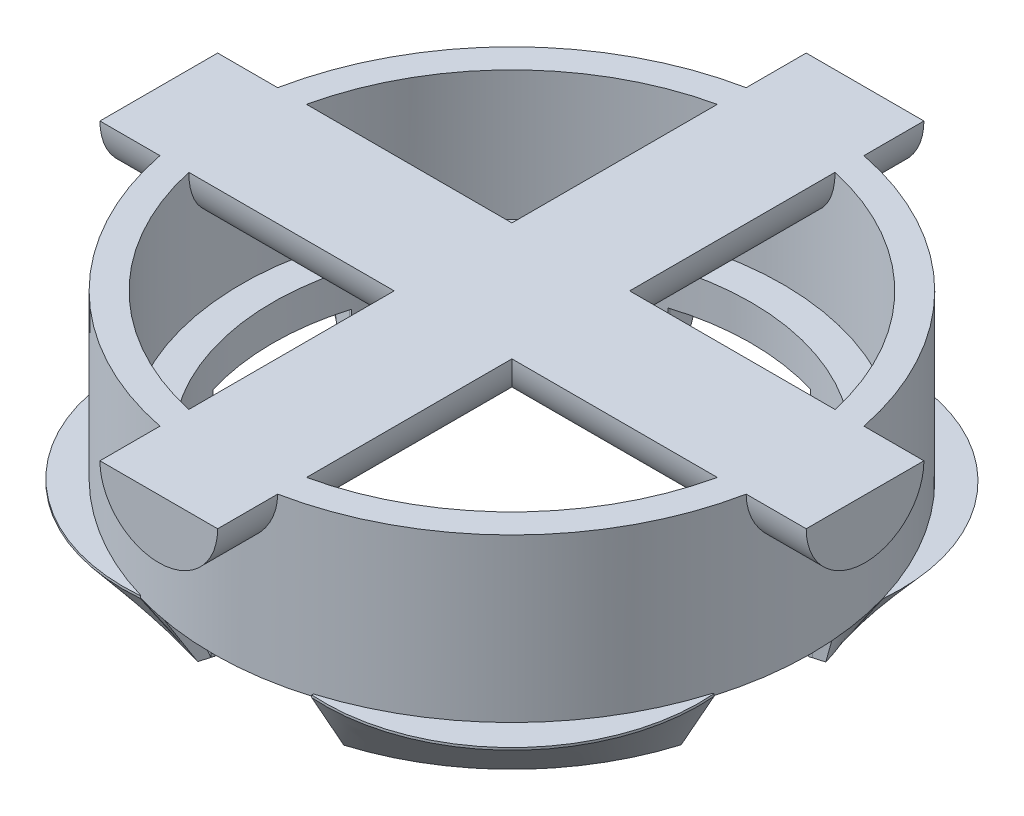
ISO-10303-21;
HEADER;
FILE_DESCRIPTION(('STEP AP214'),'2;1');
FILE_NAME('part.step','',(''),(''),'','','');
FILE_SCHEMA(('AUTOMOTIVE_DESIGN { 1 0 10303 214 1 1 1 1 }'));
ENDSEC;
DATA;
#1=APPLICATION_CONTEXT('core data for automotive mechanical design processes');
#2=APPLICATION_PROTOCOL_DEFINITION('international standard','automotive_design',2000,#1);
#3=PRODUCT_CONTEXT('',#1,'mechanical');
#4=PRODUCT('Part','Part','',(#3));
#5=PRODUCT_RELATED_PRODUCT_CATEGORY('part','',(#4));
#6=PRODUCT_DEFINITION_FORMATION('','',#4);
#7=PRODUCT_DEFINITION_CONTEXT('part definition',#1,'design');
#8=PRODUCT_DEFINITION('design','',#6,#7);
#9=PRODUCT_DEFINITION_SHAPE('','',#8);
#10=(LENGTH_UNIT() NAMED_UNIT(*) SI_UNIT(.MILLI.,.METRE.));
#11=(NAMED_UNIT(*) PLANE_ANGLE_UNIT() SI_UNIT($,.RADIAN.));
#12=(NAMED_UNIT(*) SI_UNIT($,.STERADIAN.) SOLID_ANGLE_UNIT());
#13=UNCERTAINTY_MEASURE_WITH_UNIT(LENGTH_MEASURE(1.E-05),#10,'distance_accuracy_value','');
#14=(GEOMETRIC_REPRESENTATION_CONTEXT(3) GLOBAL_UNCERTAINTY_ASSIGNED_CONTEXT((#13)) GLOBAL_UNIT_ASSIGNED_CONTEXT((#10,
#11,#12)) REPRESENTATION_CONTEXT('',''));
#15=CARTESIAN_POINT('',(0.,0.,0.));
#16=DIRECTION('',(0.,0.,1.));
#17=DIRECTION('',(1.,0.,0.));
#18=AXIS2_PLACEMENT_3D('',#15,#16,#17);
#19=CARTESIAN_POINT('',(3.71232288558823,-1.5,12.2152613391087));
#20=CARTESIAN_POINT('',(3.1423205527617,-4.5,10.2804825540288));
#21=CARTESIAN_POINT('',(3.71232288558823,-1.5,12.1453142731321));
#22=CARTESIAN_POINT('',(3.01078155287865,-4.5,9.85013677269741));
#23=B_SPLINE_SURFACE_WITH_KNOTS('',1,1,((#19,#20),(#21,#22)),.UNSPECIFIED.,.F.,.F.,.F.,(2,2),(2,
2),(0.,1.),(0.,1.),.UNSPECIFIED.);
#24=DIRECTION('',(0.,0.,-1.));
#25=VECTOR('',#24,1.);
#26=CARTESIAN_POINT('',(3.71232288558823,-1.5,12.1802878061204));
#27=LINE('',#26,#25);
#28=CARTESIAN_POINT('',(3.71232288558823,-1.5,12.2152613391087));
#29=VERTEX_POINT('',#28);
#30=CARTESIAN_POINT('',(3.71232288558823,-1.5,12.1453142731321));
#31=VERTEX_POINT('',#30);
#32=EDGE_CURVE('E13',#29,#31,#27,.T.);
#33=DIRECTION('',(-0.18260391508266,-0.780868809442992,-0.597410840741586));
#34=VECTOR('',#33,1.);
#35=CARTESIAN_POINT('',(3.36155221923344,-3.,10.9977255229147));
#36=LINE('',#35,#34);
#37=CARTESIAN_POINT('',(3.01078155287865,-4.5,9.85013677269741));
#38=VERTEX_POINT('',#37);
#39=EDGE_CURVE('E626',#31,#38,#36,.T.);
#40=DIRECTION('',(-0.292308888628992,0.,-0.956323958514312));
#41=VECTOR('',#40,1.);
#42=CARTESIAN_POINT('',(3.07655105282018,-4.5,10.0653096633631));
#43=LINE('',#42,#41);
#44=CARTESIAN_POINT('',(3.1423205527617,-4.5,10.2804825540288));
#45=VERTEX_POINT('',#44);
#46=EDGE_CURVE('E1040',#45,#38,#43,.T.);
#47=DIRECTION('',(-0.157676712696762,-0.829874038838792,-0.535207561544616));
#48=VECTOR('',#47,1.);
#49=CARTESIAN_POINT('',(3.42732171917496,-3.,11.2478719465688));
#50=LINE('',#49,#48);
#51=EDGE_CURVE('E838',#29,#45,#50,.T.);
#52=ORIENTED_EDGE('',*,*,#32,.T.);
#53=ORIENTED_EDGE('',*,*,#39,.T.);
#54=ORIENTED_EDGE('',*,*,#46,.F.);
#55=ORIENTED_EDGE('',*,*,#51,.F.);
#56=EDGE_LOOP('',(#52,#53,#54,#55));
#57=FACE_BOUND('',#56,.T.);
#58=ADVANCED_FACE('F613',(#57),#23,.T.);
#59=CARTESIAN_POINT('',(3.71232288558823,-1.5,12.1453142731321));
#60=CARTESIAN_POINT('',(3.01078155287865,-4.5,9.85013677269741));
#61=CARTESIAN_POINT('',(3.65386110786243,-1.5,11.9540494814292));
#62=CARTESIAN_POINT('',(3.16994375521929,-4.5,9.8014874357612));
#63=CARTESIAN_POINT('',(3.53693755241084,-1.5,11.5715198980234));
#64=CARTESIAN_POINT('',(3.48590986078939,-4.5,9.69647189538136));
#65=CARTESIAN_POINT('',(3.36155221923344,-1.5,10.9977255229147));
#66=CARTESIAN_POINT('',(3.9516697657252,-4.5,9.51616711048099));
#67=CARTESIAN_POINT('',(3.18616688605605,-1.5,10.4239311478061));
#68=CARTESIAN_POINT('',(4.40814188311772,-4.5,9.31350730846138));
#69=CARTESIAN_POINT('',(3.06924333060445,-1.5,10.0414015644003));
#70=CARTESIAN_POINT('',(4.70555522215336,-4.5,9.16381194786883));
#71=CARTESIAN_POINT('',(3.01078155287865,-1.5,9.85013677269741));
#72=CARTESIAN_POINT('',(4.85236061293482,-4.5,9.08540568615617));
#73=B_SPLINE_SURFACE_WITH_KNOTS('',3,1,((#59,#60),(#61,#62),(#63,#64),(#65,#66),(#67,#68),(#69,
#70),(#71,#72)),.UNSPECIFIED.,.F.,.F.,.F.,(4,1,1,1,4),(2,2),(0.,0.25,0.5,0.75,1.),(0.,1.),.UNSPECIFIED.);
#74=DIRECTION('',(-0.292308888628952,0.,-0.956323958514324));
#75=VECTOR('',#74,1.);
#76=CARTESIAN_POINT('',(3.36155221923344,-1.5,10.9977255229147));
#77=LINE('',#76,#75);
#78=CARTESIAN_POINT('',(3.01078155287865,-1.5,9.85013677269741));
#79=VERTEX_POINT('',#78);
#80=EDGE_CURVE('E635',#31,#79,#77,.T.);
#81=DIRECTION('',(0.511229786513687,-0.832812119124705,-0.212292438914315));
#82=VECTOR('',#81,1.);
#83=CARTESIAN_POINT('',(3.93157108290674,-3.,9.46777122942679));
#84=LINE('',#83,#82);
#85=CARTESIAN_POINT('',(4.85236061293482,-4.5,9.08540568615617));
#86=VERTEX_POINT('',#85);
#87=EDGE_CURVE('E802',#79,#86,#84,.T.);
#88=CARTESIAN_POINT('',(0.,-4.5,0.));
#89=DIRECTION('',(0.,1.,0.));
#90=DIRECTION('',(0.,0.,-1.));
#91=AXIS2_PLACEMENT_3D('',#88,#89,#90);
#92=CIRCLE('',#91,10.3);
#93=EDGE_CURVE('E814',#38,#86,#92,.T.);
#94=ORIENTED_EDGE('',*,*,#80,.T.);
#95=ORIENTED_EDGE('',*,*,#87,.T.);
#96=ORIENTED_EDGE('',*,*,#93,.F.);
#97=ORIENTED_EDGE('',*,*,#39,.F.);
#98=EDGE_LOOP('',(#94,#95,#96,#97));
#99=FACE_BOUND('',#98,.T.);
#100=ADVANCED_FACE('F887',(#99),#73,.T.);
#101=CARTESIAN_POINT('',(3.01078155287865,-1.5,9.85013677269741));
#102=CARTESIAN_POINT('',(4.85236061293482,-4.5,9.08540568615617));
#103=CARTESIAN_POINT('',(3.8188185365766,-1.5,9.60315311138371));
#104=CARTESIAN_POINT('',(5.4478295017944,-4.5,8.76737588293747));
#105=CARTESIAN_POINT('',(5.37379419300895,-1.5,8.90942930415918));
#106=CARTESIAN_POINT('',(6.57604949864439,-4.5,8.01389262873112));
#107=CARTESIAN_POINT('',(7.38237297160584,-1.5,7.33174797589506));
#108=CARTESIAN_POINT('',(8.01489635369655,-4.5,6.57476705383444));
#109=CARTESIAN_POINT('',(8.94619579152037,-1.5,5.31236062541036));
#110=CARTESIAN_POINT('',(9.1449355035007,-4.5,4.88232083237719));
#111=CARTESIAN_POINT('',(9.62920328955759,-1.5,3.75264822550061));
#112=CARTESIAN_POINT('',(9.66329596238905,-4.5,3.6285585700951));
#113=CARTESIAN_POINT('',(9.87062095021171,-1.5,2.94293086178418));
#114=CARTESIAN_POINT('',(9.85876637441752,-4.5,2.98240265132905));
#115=B_SPLINE_SURFACE_WITH_KNOTS('',3,1,((#101,#102),(#103,#104),(#105,#106),(#107,#108),(#109,
#110),(#111,#112),(#113,#114)),.UNSPECIFIED.,.F.,.F.,.F.,(4,1,1,1,4),(2,2),(0.,0.25,0.5,0.75,
1.),(0.,1.),.UNSPECIFIED.);
#116=CARTESIAN_POINT('',(0.,-1.5,0.));
#117=DIRECTION('',(0.,1.,0.));
#118=DIRECTION('',(0.,0.,-1.));
#119=AXIS2_PLACEMENT_3D('',#116,#117,#118);
#120=CIRCLE('',#119,10.3);
#121=CARTESIAN_POINT('',(9.87062095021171,-1.5,2.94293086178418));
#122=VERTEX_POINT('',#121);
#123=EDGE_CURVE('E813',#79,#122,#120,.T.);
#124=DIRECTION('',(-0.00395115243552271,-0.99990564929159,0.0131560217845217));
#125=VECTOR('',#124,1.);
#126=CARTESIAN_POINT('',(9.86469366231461,-3.,2.96266675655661));
#127=LINE('',#126,#125);
#128=CARTESIAN_POINT('',(9.85876637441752,-4.5,2.98240265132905));
#129=VERTEX_POINT('',#128);
#130=EDGE_CURVE('E819',#122,#129,#127,.T.);
#131=CARTESIAN_POINT('',(0.,-4.5,0.));
#132=DIRECTION('',(0.,1.,0.));
#133=DIRECTION('',(0.,0.,-1.));
#134=AXIS2_PLACEMENT_3D('',#131,#132,#133);
#135=CIRCLE('',#134,10.3);
#136=EDGE_CURVE('E687',#86,#129,#135,.T.);
#137=ORIENTED_EDGE('',*,*,#123,.T.);
#138=ORIENTED_EDGE('',*,*,#130,.T.);
#139=ORIENTED_EDGE('',*,*,#136,.F.);
#140=ORIENTED_EDGE('',*,*,#87,.F.);
#141=EDGE_LOOP('',(#137,#138,#139,#140));
#142=FACE_BOUND('',#141,.T.);
#143=ADVANCED_FACE('F721',(#142),#115,.T.);
#144=CARTESIAN_POINT('',(9.87062095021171,-1.5,2.94293086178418));
#145=CARTESIAN_POINT('',(9.85876637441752,-4.5,2.98240265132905));
#146=CARTESIAN_POINT('',(12.1705714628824,-1.5,3.62866232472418));
#147=CARTESIAN_POINT('',(10.2853287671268,-4.5,3.10164716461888));
#148=B_SPLINE_SURFACE_WITH_KNOTS('',1,1,((#144,#145),(#146,#147)),.UNSPECIFIED.,.F.,.F.,.F.,(2,
2),(2,2),(0.,1.),(0.,1.),.UNSPECIFIED.);
#149=DIRECTION('',(0.958312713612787,0.,0.285721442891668));
#150=VECTOR('',#149,1.);
#151=CARTESIAN_POINT('',(11.0205962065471,-1.5,3.28579659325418));
#152=LINE('',#151,#150);
#153=CARTESIAN_POINT('',(12.1705714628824,-1.5,3.62866232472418));
#154=VERTEX_POINT('',#153);
#155=EDGE_CURVE('E699',#122,#154,#152,.T.);
#156=DIRECTION('',(-0.526286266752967,-0.837483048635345,-0.14712208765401));
#157=VECTOR('',#156,1.);
#158=CARTESIAN_POINT('',(11.2279501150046,-3.,3.36515474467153));
#159=LINE('',#158,#157);
#160=CARTESIAN_POINT('',(10.2853287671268,-4.5,3.10164716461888));
#161=VERTEX_POINT('',#160);
#162=EDGE_CURVE('E672',#154,#161,#159,.T.);
#163=DIRECTION('',(0.963077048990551,0.,0.269225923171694));
#164=VECTOR('',#163,1.);
#165=CARTESIAN_POINT('',(10.0720475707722,-4.5,3.04202490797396));
#166=LINE('',#165,#164);
#167=EDGE_CURVE('E679',#129,#161,#166,.T.);
#168=ORIENTED_EDGE('',*,*,#155,.T.);
#169=ORIENTED_EDGE('',*,*,#162,.T.);
#170=ORIENTED_EDGE('',*,*,#167,.F.);
#171=ORIENTED_EDGE('',*,*,#130,.F.);
#172=EDGE_LOOP('',(#168,#169,#170,#171));
#173=FACE_BOUND('',#172,.T.);
#174=ADVANCED_FACE('F698',(#173),#148,.T.);
#175=CARTESIAN_POINT('',(12.1705714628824,-1.5,3.62866232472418));
#176=CARTESIAN_POINT('',(10.2853287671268,-4.5,3.10164716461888));
#177=CARTESIAN_POINT('',(12.2091964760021,-1.5,3.62397499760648));
#178=CARTESIAN_POINT('',(10.2922441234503,-4.5,3.10358033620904));
#179=B_SPLINE_SURFACE_WITH_KNOTS('',1,1,((#175,#176),(#177,#178)),.UNSPECIFIED.,.F.,.F.,.F.,(2,
2),(2,2),(0.,1.),(0.,1.),.UNSPECIFIED.);
#180=DIRECTION('',(0.99271686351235,0.,-0.120470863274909));
#181=VECTOR('',#180,1.);
#182=CARTESIAN_POINT('',(12.1898839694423,-1.5,3.62631866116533));
#183=LINE('',#182,#181);
#184=CARTESIAN_POINT('',(12.2091964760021,-1.5,3.62397499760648));
#185=VERTEX_POINT('',#184);
#186=EDGE_CURVE('E701',#154,#185,#183,.T.);
#187=DIRECTION('',(-0.532784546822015,-0.833799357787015,-0.144634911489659));
#188=VECTOR('',#187,1.);
#189=CARTESIAN_POINT('',(11.2507202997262,-3.,3.36377766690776));
#190=LINE('',#189,#188);
#191=CARTESIAN_POINT('',(10.2922441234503,-4.5,3.10358033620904));
#192=VERTEX_POINT('',#191);
#193=EDGE_CURVE('E675',#185,#192,#190,.T.);
#194=DIRECTION('',(0.963077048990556,0.,0.269225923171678));
#195=VECTOR('',#194,1.);
#196=CARTESIAN_POINT('',(10.2887864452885,-4.5,3.10261375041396));
#197=LINE('',#196,#195);
#198=EDGE_CURVE('E667',#161,#192,#197,.T.);
#199=ORIENTED_EDGE('',*,*,#186,.T.);
#200=ORIENTED_EDGE('',*,*,#193,.T.);
#201=ORIENTED_EDGE('',*,*,#198,.F.);
#202=ORIENTED_EDGE('',*,*,#162,.F.);
#203=EDGE_LOOP('',(#199,#200,#201,#202));
#204=FACE_BOUND('',#203,.T.);
#205=ADVANCED_FACE('F670',(#204),#179,.T.);
#206=CARTESIAN_POINT('',(12.2091964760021,-1.5,3.62397499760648));
#207=CARTESIAN_POINT('',(10.2922441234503,-4.5,3.10358033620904));
#208=CARTESIAN_POINT('',(12.3006455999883,-1.5,4.76298746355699));
#209=CARTESIAN_POINT('',(10.038453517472,-4.5,3.94521309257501));
#210=CARTESIAN_POINT('',(11.9867099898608,-1.5,7.08045250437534));
#211=CARTESIAN_POINT('',(9.32347466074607,-4.5,5.56589674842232));
#212=CARTESIAN_POINT('',(10.1083973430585,-1.5,10.0436546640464));
#213=CARTESIAN_POINT('',(7.69248570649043,-4.49999999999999,7.66356893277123));
#214=CARTESIAN_POINT('',(7.16613095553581,-1.5,11.9545952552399));
#215=CARTESIAN_POINT('',(5.60097096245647,-4.50000000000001,9.30244648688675));
#216=CARTESIAN_POINT('',(4.8522763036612,-1.5,12.2941190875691));
#217=CARTESIAN_POINT('',(3.98299152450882,-4.5,10.02352402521));
#218=CARTESIAN_POINT('',(3.71232288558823,-1.5,12.2152613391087));
#219=CARTESIAN_POINT('',(3.1423205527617,-4.5,10.2804825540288));
#220=B_SPLINE_SURFACE_WITH_KNOTS('',3,1,((#206,#207),(#208,#209),(#210,#211),(#212,#213),(#214,
#215),(#216,#217),(#218,#219)),.UNSPECIFIED.,.F.,.F.,.F.,(4,1,1,1,4),(2,2),(0.,0.25,0.5,0.75,
1.),(0.,1.),.UNSPECIFIED.);
#221=CARTESIAN_POINT('',(4.2625,-1.5,4.262));
#222=DIRECTION('',(0.,-1.,0.));
#223=DIRECTION('',(0.,0.,-1.));
#224=AXIS2_PLACEMENT_3D('',#221,#222,#223);
#225=CIRCLE('',#224,7.97226823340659);
#226=EDGE_CURVE('E828',#185,#29,#225,.T.);
#227=CARTESIAN_POINT('',(0.,-4.5,0.));
#228=DIRECTION('',(0.,-1.,0.));
#229=DIRECTION('',(0.,0.,-1.));
#230=AXIS2_PLACEMENT_3D('',#227,#228,#229);
#231=CIRCLE('',#230,10.75);
#232=EDGE_CURVE('E680',#192,#45,#231,.T.);
#233=ORIENTED_EDGE('',*,*,#226,.T.);
#234=ORIENTED_EDGE('',*,*,#51,.T.);
#235=ORIENTED_EDGE('',*,*,#232,.F.);
#236=ORIENTED_EDGE('',*,*,#193,.F.);
#237=EDGE_LOOP('',(#233,#234,#235,#236));
#238=FACE_BOUND('',#237,.T.);
#239=ADVANCED_FACE('F767',(#238),#220,.T.);
#240=CARTESIAN_POINT('',(4.2625,-1.5,4.262));
#241=DIRECTION('',(0.,-1.,0.));
#242=DIRECTION('',(0.,0.,-1.));
#243=AXIS2_PLACEMENT_3D('',#240,#241,#242);
#244=PLANE('',#243);
#245=ORIENTED_EDGE('',*,*,#226,.F.);
#246=ORIENTED_EDGE('',*,*,#186,.F.);
#247=ORIENTED_EDGE('',*,*,#155,.F.);
#248=ORIENTED_EDGE('',*,*,#123,.F.);
#249=ORIENTED_EDGE('',*,*,#80,.F.);
#250=ORIENTED_EDGE('',*,*,#32,.F.);
#251=EDGE_LOOP('',(#245,#246,#247,#248,#249,#250));
#252=FACE_BOUND('',#251,.T.);
#253=ADVANCED_FACE('F759',(#252),#244,.F.);
#254=CARTESIAN_POINT('',(0.,-4.5,0.));
#255=DIRECTION('',(0.,-1.,0.));
#256=DIRECTION('',(0.,0.,-1.));
#257=AXIS2_PLACEMENT_3D('',#254,#255,#256);
#258=PLANE('',#257);
#259=ORIENTED_EDGE('',*,*,#46,.T.);
#260=ORIENTED_EDGE('',*,*,#93,.T.);
#261=ORIENTED_EDGE('',*,*,#136,.T.);
#262=ORIENTED_EDGE('',*,*,#167,.T.);
#263=ORIENTED_EDGE('',*,*,#198,.T.);
#264=ORIENTED_EDGE('',*,*,#232,.T.);
#265=EDGE_LOOP('',(#259,#260,#261,#262,#263,#264));
#266=FACE_BOUND('',#265,.T.);
#267=ADVANCED_FACE('F615',(#266),#258,.T.);
#268=CLOSED_SHELL('',(#58,#100,#143,#174,#205,#239,#253,#267));
#269=MANIFOLD_SOLID_BREP('B2',#268);
#270=CARTESIAN_POINT('',(-9.86442742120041,-1.5,-2.96362474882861));
#271=CARTESIAN_POINT('',(-9.86442742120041,-4.5,-2.96362474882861));
#272=CARTESIAN_POINT('',(-10.9734987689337,-1.5,-3.36237898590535));
#273=CARTESIAN_POINT('',(-10.295424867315,-4.5,-3.09301257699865));
#274=B_SPLINE_SURFACE_WITH_KNOTS('',1,1,((#270,#271),(#272,#273)),.UNSPECIFIED.,.F.,.F.,.F.,(2,
2),(2,2),(0.,1.),(0.,1.),.UNSPECIFIED.);
#275=DIRECTION('',(-0.941025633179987,0.,-0.338335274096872));
#276=VECTOR('',#275,1.);
#277=CARTESIAN_POINT('',(-10.4189630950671,-1.5,-3.16300186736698));
#278=LINE('',#277,#276);
#279=CARTESIAN_POINT('',(-9.86442742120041,-1.5,-2.96362474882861));
#280=VERTEX_POINT('',#279);
#281=CARTESIAN_POINT('',(-10.9734987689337,-1.5,-3.36237898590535));
#282=VERTEX_POINT('',#281);
#283=EDGE_CURVE('E611',#280,#282,#278,.T.);
#284=DIRECTION('',(0.219622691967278,-0.971675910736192,0.08724561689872));
#285=VECTOR('',#284,1.);
#286=CARTESIAN_POINT('',(-10.6344618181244,-3.,-3.227695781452));
#287=LINE('',#286,#285);
#288=CARTESIAN_POINT('',(-10.295424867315,-4.5,-3.09301257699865));
#289=VERTEX_POINT('',#288);
#290=EDGE_CURVE('E1249',#282,#289,#287,.T.);
#291=DIRECTION('',(-0.95777208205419,0.,-0.28752850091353));
#292=VECTOR('',#291,1.);
#293=CARTESIAN_POINT('',(-10.0799261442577,-4.5,-3.02831866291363));
#294=LINE('',#293,#292);
#295=CARTESIAN_POINT('',(-9.86442742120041,-4.5,-2.96362474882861));
#296=VERTEX_POINT('',#295);
#297=EDGE_CURVE('E1588',#296,#289,#294,.T.);
#298=DIRECTION('',(0.,-1.,0.));
#299=VECTOR('',#298,1.);
#300=CARTESIAN_POINT('',(-9.86442742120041,-3.,-2.96362474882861));
#301=LINE('',#300,#299);
#302=EDGE_CURVE('E1312',#280,#296,#301,.T.);
#303=ORIENTED_EDGE('',*,*,#283,.T.);
#304=ORIENTED_EDGE('',*,*,#290,.T.);
#305=ORIENTED_EDGE('',*,*,#297,.F.);
#306=ORIENTED_EDGE('',*,*,#302,.F.);
#307=EDGE_LOOP('',(#303,#304,#305,#306));
#308=FACE_BOUND('',#307,.T.);
#309=ADVANCED_FACE('F1237',(#308),#274,.T.);
#310=CARTESIAN_POINT('',(-10.9734987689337,-1.5,-3.36237898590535));
#311=CARTESIAN_POINT('',(-10.295424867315,-4.5,-3.09301257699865));
#312=CARTESIAN_POINT('',(-11.0726184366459,-1.5,-3.3866955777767));
#313=CARTESIAN_POINT('',(-10.2720490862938,-4.5,-3.17082137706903));
#314=CARTESIAN_POINT('',(-11.2708577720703,-1.5,-3.43532876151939));
#315=CARTESIAN_POINT('',(-10.2235333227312,-4.5,-3.32590892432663));
#316=CARTESIAN_POINT('',(-11.5682167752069,-1.5,-3.50827853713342));
#317=CARTESIAN_POINT('',(-10.14550436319,-4.5,-3.55683073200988));
#318=CARTESIAN_POINT('',(-11.8655757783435,-1.5,-3.58122831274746));
#319=CARTESIAN_POINT('',(-10.0622602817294,-4.5,-3.7859241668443));
#320=CARTESIAN_POINT('',(-12.0638151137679,-1.5,-3.62986149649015));
#321=CARTESIAN_POINT('',(-10.0033160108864,-4.5,-3.93735563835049));
#322=CARTESIAN_POINT('',(-12.1629347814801,-1.5,-3.65417808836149));
#323=CARTESIAN_POINT('',(-9.97298938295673,-4.5,-4.01272759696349));
#324=B_SPLINE_SURFACE_WITH_KNOTS('',3,1,((#310,#311),(#312,#313),(#314,#315),(#316,#317),(#318,
#319),(#320,#321),(#322,#323)),.UNSPECIFIED.,.F.,.F.,.F.,(4,1,1,1,4),(2,2),(0.,0.25,0.5,0.75,
1.),(0.,1.),.UNSPECIFIED.);
#325=DIRECTION('',(-0.971201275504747,0.,-0.238260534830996));
#326=VECTOR('',#325,1.);
#327=CARTESIAN_POINT('',(-11.5682167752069,-1.5,-3.50827853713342));
#328=LINE('',#327,#326);
#329=CARTESIAN_POINT('',(-12.1629347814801,-1.5,-3.65417808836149));
#330=VERTEX_POINT('',#329);
#331=EDGE_CURVE('E1266',#282,#330,#328,.T.);
#332=DIRECTION('',(0.58687384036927,-0.803956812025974,-0.0960861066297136));
#333=VECTOR('',#332,1.);
#334=CARTESIAN_POINT('',(-11.0679620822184,-3.,-3.83345284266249));
#335=LINE('',#334,#333);
#336=CARTESIAN_POINT('',(-9.97298938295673,-4.5,-4.01272759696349));
#337=VERTEX_POINT('',#336);
#338=EDGE_CURVE('E1517',#330,#337,#335,.T.);
#339=CARTESIAN_POINT('',(0.,-4.5,0.));
#340=DIRECTION('',(0.,-1.,0.));
#341=DIRECTION('',(0.,0.,-1.));
#342=AXIS2_PLACEMENT_3D('',#339,#340,#341);
#343=CIRCLE('',#342,10.75);
#344=EDGE_CURVE('E1582',#289,#337,#343,.T.);
#345=ORIENTED_EDGE('',*,*,#331,.T.);
#346=ORIENTED_EDGE('',*,*,#338,.T.);
#347=ORIENTED_EDGE('',*,*,#344,.F.);
#348=ORIENTED_EDGE('',*,*,#290,.F.);
#349=EDGE_LOOP('',(#345,#346,#347,#348));
#350=FACE_BOUND('',#349,.T.);
#351=ADVANCED_FACE('F1543',(#350),#324,.T.);
#352=CARTESIAN_POINT('',(-12.1629347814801,-1.5,-3.65417808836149));
#353=CARTESIAN_POINT('',(-9.97298938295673,-4.5,-4.01272759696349));
#354=CARTESIAN_POINT('',(-12.1670778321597,-1.5,-3.65537780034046));
#355=CARTESIAN_POINT('',(-9.97170770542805,-4.5,-4.01591300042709));
#356=CARTESIAN_POINT('',(-12.175363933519,-1.5,-3.6577772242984));
#357=CARTESIAN_POINT('',(-9.9691412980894,-4.5,-4.02228257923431));
#358=CARTESIAN_POINT('',(-12.1877930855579,-1.5,-3.66137636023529));
#359=CARTESIAN_POINT('',(-9.96528253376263,-4.5,-4.03183325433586));
#360=CARTESIAN_POINT('',(-12.2002222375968,-1.5,-3.6649754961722));
#361=CARTESIAN_POINT('',(-9.96141461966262,-4.5,-4.04138022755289));
#362=CARTESIAN_POINT('',(-12.208508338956,-1.5,-3.66737492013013));
#363=CARTESIAN_POINT('',(-9.95882991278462,-4.5,-4.04774240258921));
#364=CARTESIAN_POINT('',(-12.2126513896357,-1.5,-3.6685746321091));
#365=CARTESIAN_POINT('',(-9.95753603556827,-4.5,-4.05092287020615));
#366=B_SPLINE_SURFACE_WITH_KNOTS('',3,1,((#352,#353),(#354,#355),(#356,#357),(#358,#359),(#360,
#361),(#362,#363),(#364,#365)),.UNSPECIFIED.,.F.,.F.,.F.,(4,1,1,1,4),(2,2),(0.,0.25,0.5,0.75,
1.),(0.,1.),.UNSPECIFIED.);
#367=DIRECTION('',(-0.960539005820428,0.,-0.278145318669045));
#368=VECTOR('',#367,1.);
#369=CARTESIAN_POINT('',(-12.1877930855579,-1.5,-3.66137636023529));
#370=LINE('',#369,#368);
#371=CARTESIAN_POINT('',(-12.2126513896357,-1.5,-3.66857463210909));
#372=VERTEX_POINT('',#371);
#373=EDGE_CURVE('E1452',#330,#372,#370,.T.);
#374=DIRECTION('',(0.5977778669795,-0.795229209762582,-0.101351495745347));
#375=VECTOR('',#374,1.);
#376=CARTESIAN_POINT('',(-11.085093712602,-3.,-3.85974875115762));
#377=LINE('',#376,#375);
#378=CARTESIAN_POINT('',(-9.95753603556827,-4.5,-4.05092287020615));
#379=VERTEX_POINT('',#378);
#380=EDGE_CURVE('E1446',#372,#379,#377,.T.);
#381=CARTESIAN_POINT('',(0.,-4.5,0.));
#382=DIRECTION('',(0.,-1.,0.));
#383=DIRECTION('',(0.,0.,-1.));
#384=AXIS2_PLACEMENT_3D('',#381,#382,#383);
#385=CIRCLE('',#384,10.75);
#386=EDGE_CURVE('E1590',#337,#379,#385,.T.);
#387=ORIENTED_EDGE('',*,*,#373,.T.);
#388=ORIENTED_EDGE('',*,*,#380,.T.);
#389=ORIENTED_EDGE('',*,*,#386,.F.);
#390=ORIENTED_EDGE('',*,*,#338,.F.);
#391=EDGE_LOOP('',(#387,#388,#389,#390));
#392=FACE_BOUND('',#391,.T.);
#393=ADVANCED_FACE('F1474',(#392),#366,.T.);
#394=CARTESIAN_POINT('',(-12.2126513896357,-1.5,-3.66857463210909));
#395=CARTESIAN_POINT('',(-9.95753603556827,-4.5,-4.05092287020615));
#396=CARTESIAN_POINT('',(-12.2956166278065,-1.5,-4.78006436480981));
#397=CARTESIAN_POINT('',(-9.66104183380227,-4.5,-4.77973252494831));
#398=CARTESIAN_POINT('',(-11.9890905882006,-1.49999999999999,-7.03792498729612));
#399=CARTESIAN_POINT('',(-8.90745098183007,-4.5,-6.17199100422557));
#400=CARTESIAN_POINT('',(-10.188556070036,-1.50000000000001,-9.94357398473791));
#401=CARTESIAN_POINT('',(-7.34918867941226,-4.5,-7.96394423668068));
#402=CARTESIAN_POINT('',(-7.36129667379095,-1.49999999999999,-11.8648560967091));
#403=CARTESIAN_POINT('',(-5.43808867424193,-4.5,-9.37354508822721));
#404=CARTESIAN_POINT('',(-5.1183449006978,-1.5,-12.2661790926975));
#405=CARTESIAN_POINT('',(-3.98990128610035,-4.5,-10.0131044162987));
#406=CARTESIAN_POINT('',(-4.00434757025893,-1.5,-12.2300874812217));
#407=CARTESIAN_POINT('',(-3.23966946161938,-4.5,-10.2502215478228));
#408=B_SPLINE_SURFACE_WITH_KNOTS('',3,1,((#394,#395),(#396,#397),(#398,#399),(#400,#401),(#402,
#403),(#404,#405),(#406,#407)),.UNSPECIFIED.,.F.,.F.,.F.,(4,1,1,1,4),(2,2),(0.,0.25,0.5,0.75,
1.),(0.,1.),.UNSPECIFIED.);
#409=CARTESIAN_POINT('',(-4.2625,-1.5,-4.262));
#410=DIRECTION('',(0.,1.,0.));
#411=DIRECTION('',(0.,0.,-1.));
#412=AXIS2_PLACEMENT_3D('',#409,#410,#411);
#413=CIRCLE('',#412,7.97226823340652);
#414=CARTESIAN_POINT('',(-4.00434757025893,-1.5,-12.2300874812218));
#415=VERTEX_POINT('',#414);
#416=EDGE_CURVE('E1444',#372,#415,#413,.F.);
#417=DIRECTION('',(0.208083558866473,-0.816357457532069,0.538759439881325));
#418=VECTOR('',#417,1.);
#419=CARTESIAN_POINT('',(-3.62200851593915,-3.,-11.2401545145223));
#420=LINE('',#419,#418);
#421=CARTESIAN_POINT('',(-3.23966946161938,-4.5,-10.2502215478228));
#422=VERTEX_POINT('',#421);
#423=EDGE_CURVE('E1415',#415,#422,#420,.T.);
#424=CARTESIAN_POINT('',(0.,-4.5,0.));
#425=DIRECTION('',(0.,-1.,0.));
#426=DIRECTION('',(0.,0.,-1.));
#427=AXIS2_PLACEMENT_3D('',#424,#425,#426);
#428=CIRCLE('',#427,10.75);
#429=EDGE_CURVE('E1456',#379,#422,#428,.T.);
#430=ORIENTED_EDGE('',*,*,#416,.T.);
#431=ORIENTED_EDGE('',*,*,#423,.T.);
#432=ORIENTED_EDGE('',*,*,#429,.F.);
#433=ORIENTED_EDGE('',*,*,#380,.F.);
#434=EDGE_LOOP('',(#430,#431,#432,#433));
#435=FACE_BOUND('',#434,.T.);
#436=ADVANCED_FACE('F1455',(#435),#408,.T.);
#437=CARTESIAN_POINT('',(-4.00434757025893,-1.5,-12.2300874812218));
#438=CARTESIAN_POINT('',(-3.23966946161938,-4.5,-10.2502215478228));
#439=CARTESIAN_POINT('',(-3.82733043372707,-1.5,-12.1095640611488));
#440=CARTESIAN_POINT('',(-3.2285600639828,-4.5,-10.2150717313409));
#441=B_SPLINE_SURFACE_WITH_KNOTS('',1,1,((#437,#438),(#439,#440)),.UNSPECIFIED.,.F.,.F.,.F.,(2,
2),(2,2),(0.,1.),(0.,1.),.UNSPECIFIED.);
#442=DIRECTION('',(0.826596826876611,0.,0.562794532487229));
#443=VECTOR('',#442,1.);
#444=CARTESIAN_POINT('',(-3.915839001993,-1.5,-12.1698257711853));
#445=LINE('',#444,#443);
#446=CARTESIAN_POINT('',(-3.82733043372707,-1.5,-12.1095640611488));
#447=VERTEX_POINT('',#446);
#448=EDGE_CURVE('E1394',#415,#447,#445,.T.);
#449=DIRECTION('',(0.166404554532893,-0.833731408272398,0.526499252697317));
#450=VECTOR('',#449,1.);
#451=CARTESIAN_POINT('',(-3.52794524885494,-3.,-11.1623178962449));
#452=LINE('',#451,#450);
#453=CARTESIAN_POINT('',(-3.2285600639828,-4.5,-10.2150717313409));
#454=VERTEX_POINT('',#453);
#455=EDGE_CURVE('E1387',#447,#454,#452,.T.);
#456=DIRECTION('',(0.301364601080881,0.,0.953508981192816));
#457=VECTOR('',#456,1.);
#458=CARTESIAN_POINT('',(-3.23411476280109,-4.5,-10.2326466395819));
#459=LINE('',#458,#457);
#460=EDGE_CURVE('E1326',#422,#454,#459,.T.);
#461=ORIENTED_EDGE('',*,*,#448,.T.);
#462=ORIENTED_EDGE('',*,*,#455,.T.);
#463=ORIENTED_EDGE('',*,*,#460,.F.);
#464=ORIENTED_EDGE('',*,*,#423,.F.);
#465=EDGE_LOOP('',(#461,#462,#463,#464));
#466=FACE_BOUND('',#465,.T.);
#467=ADVANCED_FACE('F1357',(#466),#441,.T.);
#468=CARTESIAN_POINT('',(-3.82733043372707,-1.5,-12.1095640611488));
#469=CARTESIAN_POINT('',(-3.2285600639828,-4.5,-10.2150717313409));
#470=CARTESIAN_POINT('',(-3.79595768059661,-1.5,-12.0119676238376));
#471=CARTESIAN_POINT('',(-3.22324713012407,-4.5,-10.1982617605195));
#472=CARTESIAN_POINT('',(-3.73322090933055,-1.5,-11.8168019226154));
#473=CARTESIAN_POINT('',(-3.21261480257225,-4.5,-10.1646213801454));
#474=CARTESIAN_POINT('',(-3.63912868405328,-1.5,-11.5240935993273));
#475=CARTESIAN_POINT('',(-3.19665672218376,-4.5,-10.1141304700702));
#476=CARTESIAN_POINT('',(-3.54513884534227,-1.5,-11.2313527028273));
#477=CARTESIAN_POINT('',(-3.18069783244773,-4.5,-10.0636369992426));
#478=CARTESIAN_POINT('',(-3.4517272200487,-1.5,-10.9436377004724));
#479=CARTESIAN_POINT('',(-3.16501907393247,-4.5,-10.0140298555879));
#480=CARTESIAN_POINT('',(-3.36410187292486,-1.5,-10.6593085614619));
#481=CARTESIAN_POINT('',(-3.14957519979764,-4.5,-9.96516587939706));
#482=CARTESIAN_POINT('',(-3.27748980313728,-1.5,-10.3798785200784));
#483=CARTESIAN_POINT('',(-3.13440544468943,-4.5,-9.91716920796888));
#484=CARTESIAN_POINT('',(-3.19076447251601,-1.5,-10.1004843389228));
#485=CARTESIAN_POINT('',(-3.11923662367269,-4.5,-9.86917549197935));
#486=CARTESIAN_POINT('',(-3.1329557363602,-1.5,-9.91424781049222));
#487=CARTESIAN_POINT('',(-3.10911785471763,-4.5,-9.83715999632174));
#488=CARTESIAN_POINT('',(-3.10405539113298,-1.5,-9.82114250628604));
#489=CARTESIAN_POINT('',(-3.10405539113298,-4.5,-9.82114250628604));
#490=B_SPLINE_SURFACE_WITH_KNOTS('',3,1,((#468,#469),(#470,#471),(#472,#473),(#474,#475),(#476,
#477),(#478,#479),(#480,#481),(#482,#483),(#484,#485),(#486,#487),(#488,#489)),.UNSPECIFIED.,
.F.,.F.,.F.,(4,1,1,1,1,1,1,1,4),(2,2),(0.,0.128137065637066,0.256274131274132,0.384411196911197,
0.512548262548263,0.634411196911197,0.756274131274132,0.878137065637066,1.),(0.,1.),.UNSPECIFIED.);
#491=DIRECTION('',(0.306031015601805,0.,0.952021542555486));
#492=VECTOR('',#491,1.);
#493=CARTESIAN_POINT('',(-3.45092551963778,-1.5,-10.9386187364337));
#494=LINE('',#493,#492);
#495=CARTESIAN_POINT('',(-3.45092551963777,-1.5,-10.9386187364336));
#496=VERTEX_POINT('',#495);
#497=EDGE_CURVE('E1395',#447,#496,#494,.T.);
#498=DIRECTION('',(0.296451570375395,0.,0.955047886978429));
#499=VECTOR('',#498,1.);
#500=CARTESIAN_POINT('',(-3.10405539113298,-1.5,-9.82114250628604));
#501=LINE('',#500,#499);
#502=CARTESIAN_POINT('',(-3.10405539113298,-1.5,-9.82114250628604));
#503=VERTEX_POINT('',#502);
#504=EDGE_CURVE('E1257',#496,#503,#501,.T.);
#505=DIRECTION('',(0.,-1.,0.));
#506=VECTOR('',#505,1.);
#507=CARTESIAN_POINT('',(-3.10405539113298,-3.,-9.82114250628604));
#508=LINE('',#507,#506);
#509=CARTESIAN_POINT('',(-3.10405539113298,-4.5,-9.82114250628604));
#510=VERTEX_POINT('',#509);
#511=EDGE_CURVE('E1309',#503,#510,#508,.T.);
#512=DIRECTION('',(0.301364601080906,0.,0.953508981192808));
#513=VECTOR('',#512,1.);
#514=CARTESIAN_POINT('',(-3.16631652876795,-4.5,-10.0181349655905));
#515=LINE('',#514,#513);
#516=EDGE_CURVE('E1318',#454,#510,#515,.T.);
#517=ORIENTED_EDGE('',*,*,#497,.T.);
#518=ORIENTED_EDGE('',*,*,#504,.T.);
#519=ORIENTED_EDGE('',*,*,#511,.T.);
#520=ORIENTED_EDGE('',*,*,#516,.F.);
#521=ORIENTED_EDGE('',*,*,#455,.F.);
#522=EDGE_LOOP('',(#517,#518,#519,#520,#521));
#523=FACE_BOUND('',#522,.T.);
#524=ADVANCED_FACE('F1335',(#523),#490,.T.);
#525=CARTESIAN_POINT('',(0.,-1.5,0.));
#526=DIRECTION('',(0.,1.,0.));
#527=DIRECTION('',(0.,0.,1.));
#528=AXIS2_PLACEMENT_3D('',#525,#526,#527);
#529=CYLINDRICAL_SURFACE('',#528,10.3);
#530=CARTESIAN_POINT('',(0.,-1.5,0.));
#531=DIRECTION('',(0.,1.,0.));
#532=DIRECTION('',(0.,0.,-1.));
#533=AXIS2_PLACEMENT_3D('',#530,#531,#532);
#534=CIRCLE('',#533,10.3);
#535=EDGE_CURVE('E1337',#503,#280,#534,.T.);
#536=ORIENTED_EDGE('',*,*,#535,.T.);
#537=ORIENTED_EDGE('',*,*,#302,.T.);
#538=CARTESIAN_POINT('',(0.,-4.5,0.));
#539=DIRECTION('',(0.,1.,0.));
#540=DIRECTION('',(0.,0.,-1.));
#541=AXIS2_PLACEMENT_3D('',#538,#539,#540);
#542=CIRCLE('',#541,10.3);
#543=EDGE_CURVE('E1304',#510,#296,#542,.T.);
#544=ORIENTED_EDGE('',*,*,#543,.F.);
#545=ORIENTED_EDGE('',*,*,#511,.F.);
#546=EDGE_LOOP('',(#536,#537,#544,#545));
#547=FACE_BOUND('',#546,.T.);
#548=ADVANCED_FACE('F1239',(#547),#529,.F.);
#549=CARTESIAN_POINT('',(-7.33499985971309,-1.5,-7.23108997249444));
#550=DIRECTION('',(0.,-1.,0.));
#551=DIRECTION('',(0.,0.,-1.));
#552=AXIS2_PLACEMENT_3D('',#549,#550,#551);
#553=PLANE('',#552);
#554=ORIENTED_EDGE('',*,*,#535,.F.);
#555=ORIENTED_EDGE('',*,*,#504,.F.);
#556=ORIENTED_EDGE('',*,*,#497,.F.);
#557=ORIENTED_EDGE('',*,*,#448,.F.);
#558=ORIENTED_EDGE('',*,*,#416,.F.);
#559=ORIENTED_EDGE('',*,*,#373,.F.);
#560=ORIENTED_EDGE('',*,*,#331,.F.);
#561=ORIENTED_EDGE('',*,*,#283,.F.);
#562=EDGE_LOOP('',(#554,#555,#556,#557,#558,#559,#560,#561));
#563=FACE_BOUND('',#562,.T.);
#564=ADVANCED_FACE('F1362',(#563),#553,.F.);
#565=CARTESIAN_POINT('',(-7.33499985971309,-4.5,-7.23108997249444));
#566=DIRECTION('',(0.,-1.,0.));
#567=DIRECTION('',(0.,0.,-1.));
#568=AXIS2_PLACEMENT_3D('',#565,#566,#567);
#569=PLANE('',#568);
#570=ORIENTED_EDGE('',*,*,#297,.T.);
#571=ORIENTED_EDGE('',*,*,#344,.T.);
#572=ORIENTED_EDGE('',*,*,#386,.T.);
#573=ORIENTED_EDGE('',*,*,#429,.T.);
#574=ORIENTED_EDGE('',*,*,#460,.T.);
#575=ORIENTED_EDGE('',*,*,#516,.T.);
#576=ORIENTED_EDGE('',*,*,#543,.T.);
#577=EDGE_LOOP('',(#570,#571,#572,#573,#574,#575,#576));
#578=FACE_BOUND('',#577,.T.);
#579=ADVANCED_FACE('F1324',(#578),#569,.T.);
#580=CLOSED_SHELL('',(#309,#351,#393,#436,#467,#524,#548,#564,#579));
#581=MANIFOLD_SOLID_BREP('B7',#580);
#582=CARTESIAN_POINT('',(-3.53997858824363,-1.5,12.0271834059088));
#583=CARTESIAN_POINT('',(-3.03531744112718,-4.5,10.3125820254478));
#584=CARTESIAN_POINT('',(-3.54380619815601,-1.5,12.0401878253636));
#585=CARTESIAN_POINT('',(-3.04541018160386,-4.5,10.3096114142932));
#586=CARTESIAN_POINT('',(-3.55146141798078,-1.5,12.0661966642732));
#587=CARTESIAN_POINT('',(-3.06558694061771,-4.5,10.3036405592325));
#588=CARTESIAN_POINT('',(-3.56294424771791,-1.5,12.1052099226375));
#589=CARTESIAN_POINT('',(-3.09582565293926,-4.5,10.2945954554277));
#590=CARTESIAN_POINT('',(-3.57442707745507,-1.5,12.1442231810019));
#591=CARTESIAN_POINT('',(-3.1260376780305,-4.5,10.2854616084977));
#592=CARTESIAN_POINT('',(-3.58208229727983,-1.5,12.1702320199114));
#593=CARTESIAN_POINT('',(-3.14616106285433,-4.5,10.2793132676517));
#594=CARTESIAN_POINT('',(-3.58590990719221,-1.5,12.1832364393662));
#595=CARTESIAN_POINT('',(-3.15621822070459,-4.5,10.276224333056));
#596=B_SPLINE_SURFACE_WITH_KNOTS('',3,1,((#582,#583),(#584,#585),(#586,#587),(#588,#589),(#590,
#591),(#592,#593),(#594,#595)),.UNSPECIFIED.,.F.,.F.,.F.,(4,1,1,1,4),(2,2),(0.,0.25,0.5,0.75,
1.),(0.,1.),.UNSPECIFIED.);
#597=DIRECTION('',(-0.282355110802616,0.,0.959309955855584));
#598=VECTOR('',#597,1.);
#599=CARTESIAN_POINT('',(-3.56294424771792,-1.5,12.1052099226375));
#600=LINE('',#599,#598);
#601=CARTESIAN_POINT('',(-3.53997858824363,-1.5,12.0271834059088));
#602=VERTEX_POINT('',#601);
#603=CARTESIAN_POINT('',(-3.58590990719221,-1.5,12.1832364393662));
#604=VERTEX_POINT('',#603);
#605=EDGE_CURVE('E1235',#602,#604,#600,.T.);
#606=DIRECTION('',(0.120002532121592,-0.837827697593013,-0.532582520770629));
#607=VECTOR('',#606,1.);
#608=CARTESIAN_POINT('',(-3.3710640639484,-3.,11.2297303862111));
#609=LINE('',#608,#607);
#610=CARTESIAN_POINT('',(-3.15621822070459,-4.5,10.276224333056));
#611=VERTEX_POINT('',#610);
#612=EDGE_CURVE('E1994',#604,#611,#609,.T.);
#613=CARTESIAN_POINT('',(0.,-4.5,0.));
#614=DIRECTION('',(0.,-1.,0.));
#615=DIRECTION('',(0.,0.,-1.));
#616=AXIS2_PLACEMENT_3D('',#613,#614,#615);
#617=CIRCLE('',#616,10.75);
#618=CARTESIAN_POINT('',(-3.03531744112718,-4.5,10.3125820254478));
#619=VERTEX_POINT('',#618);
#620=EDGE_CURVE('E2409',#619,#611,#617,.T.);
#621=DIRECTION('',(0.144516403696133,-0.859089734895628,-0.490998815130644));
#622=VECTOR('',#621,1.);
#623=CARTESIAN_POINT('',(-3.2876480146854,-3.,11.1698827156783));
#624=LINE('',#623,#622);
#625=EDGE_CURVE('E2217',#602,#619,#624,.T.);
#626=ORIENTED_EDGE('',*,*,#605,.T.);
#627=ORIENTED_EDGE('',*,*,#612,.T.);
#628=ORIENTED_EDGE('',*,*,#620,.F.);
#629=ORIENTED_EDGE('',*,*,#625,.F.);
#630=EDGE_LOOP('',(#626,#627,#628,#629));
#631=FACE_BOUND('',#630,.T.);
#632=ADVANCED_FACE('F1981',(#631),#596,.T.);
#633=CARTESIAN_POINT('',(-3.58590990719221,-1.5,12.1832364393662));
#634=CARTESIAN_POINT('',(-3.15621822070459,-4.5,10.276224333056));
#635=CARTESIAN_POINT('',(-3.58518651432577,-1.5,12.1850302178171));
#636=CARTESIAN_POINT('',(-3.15765315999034,-4.5,10.275783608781));
#637=CARTESIAN_POINT('',(-3.5837397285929,-1.5,12.188617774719));
#638=CARTESIAN_POINT('',(-3.16052285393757,-4.5,10.2749015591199));
#639=CARTESIAN_POINT('',(-3.5815695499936,-1.5,12.1939991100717));
#640=CARTESIAN_POINT('',(-3.1648268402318,-4.50000000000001,10.273576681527));
#641=CARTESIAN_POINT('',(-3.57939937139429,-1.5,12.1993804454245));
#642=CARTESIAN_POINT('',(-3.16913027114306,-4.5,10.2722500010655));
#643=CARTESIAN_POINT('',(-3.57795258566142,-1.5,12.2029680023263));
#644=CARTESIAN_POINT('',(-3.17199885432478,-4.5,10.2713643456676));
#645=CARTESIAN_POINT('',(-3.57722919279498,-1.5,12.2047617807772));
#646=CARTESIAN_POINT('',(-3.17343305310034,-4.5,10.2709212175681));
#647=B_SPLINE_SURFACE_WITH_KNOTS('',3,1,((#633,#634),(#635,#636),(#637,#638),(#639,#640),(#641,
#642),(#643,#644),(#645,#646)),.UNSPECIFIED.,.F.,.F.,.F.,(4,1,1,1,4),(2,2),(0.,0.25,0.5,0.75,
1.),(0.,1.),.UNSPECIFIED.);
#648=DIRECTION('',(0.374010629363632,0.,0.927424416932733));
#649=VECTOR('',#648,1.);
#650=CARTESIAN_POINT('',(-3.5815695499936,-1.5,12.1939991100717));
#651=LINE('',#650,#649);
#652=CARTESIAN_POINT('',(-3.57722919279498,-1.5,12.2047617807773));
#653=VERTEX_POINT('',#652);
#654=EDGE_CURVE('E2003',#604,#653,#651,.T.);
#655=DIRECTION('',(0.112413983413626,-0.835178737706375,-0.538367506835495));
#656=VECTOR('',#655,1.);
#657=CARTESIAN_POINT('',(-3.37533112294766,-3.,11.2378414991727));
#658=LINE('',#657,#656);
#659=CARTESIAN_POINT('',(-3.17343305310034,-4.5,10.2709212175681));
#660=VERTEX_POINT('',#659);
#661=EDGE_CURVE('E2296',#653,#660,#658,.T.);
#662=CARTESIAN_POINT('',(0.,-4.5,0.));
#663=DIRECTION('',(0.,-1.,0.));
#664=DIRECTION('',(0.,0.,-1.));
#665=AXIS2_PLACEMENT_3D('',#662,#663,#664);
#666=CIRCLE('',#665,10.75);
#667=EDGE_CURVE('E2371',#611,#660,#666,.T.);
#668=ORIENTED_EDGE('',*,*,#654,.T.);
#669=ORIENTED_EDGE('',*,*,#661,.T.);
#670=ORIENTED_EDGE('',*,*,#667,.F.);
#671=ORIENTED_EDGE('',*,*,#612,.F.);
#672=EDGE_LOOP('',(#668,#669,#670,#671));
#673=FACE_BOUND('',#672,.T.);
#674=ADVANCED_FACE('F2234',(#673),#647,.T.);
#675=CARTESIAN_POINT('',(-3.57722919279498,-1.5,12.2047617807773));
#676=CARTESIAN_POINT('',(-3.17343305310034,-4.5,10.2709212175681));
#677=CARTESIAN_POINT('',(-4.72150720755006,-1.5,12.30348566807));
#678=CARTESIAN_POINT('',(-3.92291979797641,-4.5,10.0393503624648));
#679=CARTESIAN_POINT('',(-7.05286042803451,-1.5,11.9991255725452));
#680=CARTESIAN_POINT('',(-5.37099411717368,-4.50000000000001,9.41154772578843));
#681=CARTESIAN_POINT('',(-10.0369857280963,-1.5,10.1186978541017));
#682=CARTESIAN_POINT('',(-7.28669011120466,-4.49999999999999,8.02046100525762));
#683=CARTESIAN_POINT('',(-11.959408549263,-1.5,7.16145205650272));
#684=CARTESIAN_POINT('',(-8.85464067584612,-4.50000000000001,6.24661083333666));
#685=CARTESIAN_POINT('',(-12.2966937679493,-1.5,4.83463414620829));
#686=CARTESIAN_POINT('',(-9.61807753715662,-4.5,4.86522763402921));
#687=CARTESIAN_POINT('',(-12.2141550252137,-1.5,3.68907492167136));
#688=CARTESIAN_POINT('',(-9.92027734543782,-4.5,4.14132797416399));
#689=B_SPLINE_SURFACE_WITH_KNOTS('',3,1,((#675,#676),(#677,#678),(#679,#680),(#681,#682),(#683,
#684),(#685,#686),(#687,#688)),.UNSPECIFIED.,.F.,.F.,.F.,(4,1,1,1,4),(2,2),(0.,0.25,0.5,0.75,
1.),(0.,1.),.UNSPECIFIED.);
#690=CARTESIAN_POINT('',(-4.2625,-1.5,4.262));
#691=DIRECTION('',(0.,-1.,0.));
#692=DIRECTION('',(0.,0.,-1.));
#693=AXIS2_PLACEMENT_3D('',#690,#691,#692);
#694=CIRCLE('',#693,7.97226823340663);
#695=CARTESIAN_POINT('',(-12.2141550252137,-1.5,3.68907492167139));
#696=VERTEX_POINT('',#695);
#697=EDGE_CURVE('E2311',#653,#696,#694,.T.);
#698=DIRECTION('',(0.603100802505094,-0.788752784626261,0.118905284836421));
#699=VECTOR('',#698,1.);
#700=CARTESIAN_POINT('',(-11.0672161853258,-3.,3.91520144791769));
#701=LINE('',#700,#699);
#702=CARTESIAN_POINT('',(-9.92027734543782,-4.5,4.14132797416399));
#703=VERTEX_POINT('',#702);
#704=EDGE_CURVE('E2320',#696,#703,#701,.T.);
#705=CARTESIAN_POINT('',(0.,-4.5,0.));
#706=DIRECTION('',(0.,-1.,0.));
#707=DIRECTION('',(0.,0.,-1.));
#708=AXIS2_PLACEMENT_3D('',#705,#706,#707);
#709=CIRCLE('',#708,10.75);
#710=EDGE_CURVE('E2368',#660,#703,#709,.T.);
#711=ORIENTED_EDGE('',*,*,#697,.T.);
#712=ORIENTED_EDGE('',*,*,#704,.T.);
#713=ORIENTED_EDGE('',*,*,#710,.F.);
#714=ORIENTED_EDGE('',*,*,#661,.F.);
#715=EDGE_LOOP('',(#711,#712,#713,#714));
#716=FACE_BOUND('',#715,.T.);
#717=ADVANCED_FACE('F2325',(#716),#689,.T.);
#718=CARTESIAN_POINT('',(-12.2141550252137,-1.5,3.68907492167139));
#719=CARTESIAN_POINT('',(-9.92027734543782,-4.5,4.14132797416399));
#720=CARTESIAN_POINT('',(-12.2080566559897,-1.5,3.69219293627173));
#721=CARTESIAN_POINT('',(-9.92232516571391,-4.5,4.13642255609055));
#722=CARTESIAN_POINT('',(-12.1958599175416,-1.5,3.69842896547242));
#723=CARTESIAN_POINT('',(-9.926413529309,-4.5,4.12660868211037));
#724=CARTESIAN_POINT('',(-12.1775648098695,-1.5,3.70778300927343));
#725=CARTESIAN_POINT('',(-9.93252423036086,-4.50000000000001,4.11187878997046));
#726=CARTESIAN_POINT('',(-12.1592697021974,-1.5,3.71713705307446));
#727=CARTESIAN_POINT('',(-9.93861307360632,-4.5,4.09713984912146));
#728=CARTESIAN_POINT('',(-12.1470729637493,-1.5,3.72337308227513));
#729=CARTESIAN_POINT('',(-9.94265772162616,-4.5,4.08730787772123));
#730=CARTESIAN_POINT('',(-12.1409745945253,-1.5,3.72649109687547));
#731=CARTESIAN_POINT('',(-9.9446763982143,-4.5,4.08239039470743));
#732=B_SPLINE_SURFACE_WITH_KNOTS('',3,1,((#718,#719),(#720,#721),(#722,#723),(#724,#725),(#726,
#727),(#728,#729),(#730,#731)),.UNSPECIFIED.,.F.,.F.,.F.,(4,1,1,1,4),(2,2),(0.,0.25,0.5,0.75,
1.),(0.,1.),.UNSPECIFIED.);
#733=DIRECTION('',(0.890371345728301,0.,0.45523495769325));
#734=VECTOR('',#733,1.);
#735=CARTESIAN_POINT('',(-12.1775648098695,-1.5,3.70778300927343));
#736=LINE('',#735,#734);
#737=CARTESIAN_POINT('',(-12.1409745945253,-1.5,3.72649109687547));
#738=VERTEX_POINT('',#737);
#739=EDGE_CURVE('E2376',#696,#738,#736,.T.);
#740=DIRECTION('',(0.588028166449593,-0.803208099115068,0.095287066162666));
#741=VECTOR('',#740,1.);
#742=CARTESIAN_POINT('',(-11.0428254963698,-3.,3.90444074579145));
#743=LINE('',#742,#741);
#744=CARTESIAN_POINT('',(-9.9446763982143,-4.5,4.08239039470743));
#745=VERTEX_POINT('',#744);
#746=EDGE_CURVE('E2387',#738,#745,#743,.T.);
#747=CARTESIAN_POINT('',(0.,-4.5,0.));
#748=DIRECTION('',(0.,-1.,0.));
#749=DIRECTION('',(0.,0.,-1.));
#750=AXIS2_PLACEMENT_3D('',#747,#748,#749);
#751=CIRCLE('',#750,10.75);
#752=EDGE_CURVE('E2372',#703,#745,#751,.T.);
#753=ORIENTED_EDGE('',*,*,#739,.T.);
#754=ORIENTED_EDGE('',*,*,#746,.T.);
#755=ORIENTED_EDGE('',*,*,#752,.F.);
#756=ORIENTED_EDGE('',*,*,#704,.F.);
#757=EDGE_LOOP('',(#753,#754,#755,#756));
#758=FACE_BOUND('',#757,.T.);
#759=ADVANCED_FACE('F2336',(#758),#732,.T.);
#760=CARTESIAN_POINT('',(-12.1409745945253,-1.5,3.72649109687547));
#761=CARTESIAN_POINT('',(-9.9446763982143,-4.5,4.08239039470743));
#762=CARTESIAN_POINT('',(-12.0389402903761,-1.5,3.69822212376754));
#763=CARTESIAN_POINT('',(-9.97588178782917,-4.5,4.00637426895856));
#764=CARTESIAN_POINT('',(-11.8348716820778,-1.5,3.64168417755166));
#765=CARTESIAN_POINT('',(-10.0365493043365,-4.5,3.85362643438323));
#766=CARTESIAN_POINT('',(-11.5287687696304,-1.5,3.55687725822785));
#767=CARTESIAN_POINT('',(-10.1222729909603,-4.49999999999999,3.62247815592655));
#768=CARTESIAN_POINT('',(-11.222665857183,-1.5,3.47207033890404));
#769=CARTESIAN_POINT('',(-10.2026739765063,-4.5,3.38942507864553));
#770=CARTESIAN_POINT('',(-11.0185972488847,-1.5,3.41553239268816));
#771=CARTESIAN_POINT('',(-10.2526979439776,-4.5,3.23286824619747));
#772=CARTESIAN_POINT('',(-10.9165629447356,-1.5,3.38726341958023));
#773=CARTESIAN_POINT('',(-10.2768092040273,-4.5,3.15431333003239));
#774=B_SPLINE_SURFACE_WITH_KNOTS('',3,1,((#760,#761),(#762,#763),(#764,#765),(#766,#767),(#768,
#769),(#770,#771),(#772,#773)),.UNSPECIFIED.,.F.,.F.,.F.,(4,1,1,1,4),(2,2),(0.,0.25,0.5,0.75,
1.),(0.,1.),.UNSPECIFIED.);
#775=DIRECTION('',(0.963697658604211,0.,-0.266995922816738));
#776=VECTOR('',#775,1.);
#777=CARTESIAN_POINT('',(-11.5287687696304,-1.5,3.55687725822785));
#778=LINE('',#777,#776);
#779=CARTESIAN_POINT('',(-10.9165629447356,-1.5,3.38726341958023));
#780=VERTEX_POINT('',#779);
#781=EDGE_CURVE('E2487',#738,#780,#778,.T.);
#782=DIRECTION('',(0.207962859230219,-0.975201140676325,-0.075724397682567));
#783=VECTOR('',#782,1.);
#784=CARTESIAN_POINT('',(-10.5966860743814,-3.,3.27078837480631));
#785=LINE('',#784,#783);
#786=CARTESIAN_POINT('',(-10.2768092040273,-4.5,3.15431333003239));
#787=VERTEX_POINT('',#786);
#788=EDGE_CURVE('E2474',#780,#787,#785,.T.);
#789=CARTESIAN_POINT('',(0.,-4.5,0.));
#790=DIRECTION('',(0.,-1.,0.));
#791=DIRECTION('',(0.,0.,-1.));
#792=AXIS2_PLACEMENT_3D('',#789,#790,#791);
#793=CIRCLE('',#792,10.75);
#794=EDGE_CURVE('E2389',#745,#787,#793,.T.);
#795=ORIENTED_EDGE('',*,*,#781,.T.);
#796=ORIENTED_EDGE('',*,*,#788,.T.);
#797=ORIENTED_EDGE('',*,*,#794,.F.);
#798=ORIENTED_EDGE('',*,*,#746,.F.);
#799=EDGE_LOOP('',(#795,#796,#797,#798));
#800=FACE_BOUND('',#799,.T.);
#801=ADVANCED_FACE('F2486',(#800),#774,.T.);
#802=CARTESIAN_POINT('',(-10.9165629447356,-1.5,3.38726341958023));
#803=CARTESIAN_POINT('',(-10.2768092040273,-4.5,3.15431333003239));
#804=CARTESIAN_POINT('',(-9.84661719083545,-1.5,3.02227230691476));
#805=CARTESIAN_POINT('',(-9.84661719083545,-4.5,3.02227230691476));
#806=B_SPLINE_SURFACE_WITH_KNOTS('',1,1,((#802,#803),(#804,#805)),.UNSPECIFIED.,.F.,.F.,.F.,(2,
2),(2,2),(0.,1.),(0.,1.),.UNSPECIFIED.);
#807=DIRECTION('',(0.946446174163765,0.,-0.322861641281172));
#808=VECTOR('',#807,1.);
#809=CARTESIAN_POINT('',(-10.3815900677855,-1.5,3.20476786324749));
#810=LINE('',#809,#808);
#811=CARTESIAN_POINT('',(-9.84661719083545,-1.5,3.02227230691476));
#812=VERTEX_POINT('',#811);
#813=EDGE_CURVE('E2146',#780,#812,#810,.T.);
#814=DIRECTION('',(0.,-1.,0.));
#815=VECTOR('',#814,1.);
#816=CARTESIAN_POINT('',(-9.84661719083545,-3.,3.02227230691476));
#817=LINE('',#816,#815);
#818=CARTESIAN_POINT('',(-9.84661719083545,-4.5,3.02227230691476));
#819=VERTEX_POINT('',#818);
#820=EDGE_CURVE('E2139',#812,#819,#817,.T.);
#821=DIRECTION('',(0.955982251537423,0.,-0.293424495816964));
#822=VECTOR('',#821,1.);
#823=CARTESIAN_POINT('',(-10.0617131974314,-4.5,3.08829281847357));
#824=LINE('',#823,#822);
#825=EDGE_CURVE('E2075',#787,#819,#824,.T.);
#826=ORIENTED_EDGE('',*,*,#813,.T.);
#827=ORIENTED_EDGE('',*,*,#820,.T.);
#828=ORIENTED_EDGE('',*,*,#825,.F.);
#829=ORIENTED_EDGE('',*,*,#788,.F.);
#830=EDGE_LOOP('',(#826,#827,#828,#829));
#831=FACE_BOUND('',#830,.T.);
#832=ADVANCED_FACE('F2110',(#831),#806,.T.);
#833=CARTESIAN_POINT('',(-9.84661719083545,-1.5,3.02227230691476));
#834=CARTESIAN_POINT('',(-9.84661719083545,-4.5,3.02227230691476));
#835=CARTESIAN_POINT('',(-9.59810051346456,-1.5,3.83194408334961));
#836=CARTESIAN_POINT('',(-9.6239604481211,-4.5,3.7476919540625));
#837=CARTESIAN_POINT('',(-8.90042562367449,-1.5,5.38966221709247));
#838=CARTESIAN_POINT('',(-9.01773305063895,-4.5,5.1491175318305));
#839=CARTESIAN_POINT('',(-7.31481389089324,-1.5,7.39985697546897));
#840=CARTESIAN_POINT('',(-7.66954083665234,-4.49999999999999,7.0007113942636));
#841=CARTESIAN_POINT('',(-5.28642602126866,-1.5,8.96212781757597));
#842=CARTESIAN_POINT('',(-5.94830368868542,-4.50000000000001,8.51179205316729));
#843=CARTESIAN_POINT('',(-3.72074782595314,-1.5,9.64175111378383));
#844=CARTESIAN_POINT('',(-4.60785403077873,-4.5,9.24302390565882));
#845=CARTESIAN_POINT('',(-2.90825764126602,-1.5,9.88089254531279));
#846=CARTESIAN_POINT('',(-3.90570385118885,-4.5,9.53076478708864));
#847=B_SPLINE_SURFACE_WITH_KNOTS('',3,1,((#833,#834),(#835,#836),(#837,#838),(#839,#840),(#841,
#842),(#843,#844),(#845,#846)),.UNSPECIFIED.,.F.,.F.,.F.,(4,1,1,1,4),(2,2),(0.,0.25,0.5,0.75,
1.),(0.,1.),.UNSPECIFIED.);
#848=CARTESIAN_POINT('',(0.,-1.5,0.));
#849=DIRECTION('',(0.,1.,0.));
#850=DIRECTION('',(0.,0.,-1.));
#851=AXIS2_PLACEMENT_3D('',#848,#849,#850);
#852=CIRCLE('',#851,10.3);
#853=CARTESIAN_POINT('',(-2.90825764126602,-1.5,9.88089254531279));
#854=VERTEX_POINT('',#853);
#855=EDGE_CURVE('E2087',#812,#854,#852,.T.);
#856=DIRECTION('',(-0.313583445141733,-0.943158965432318,-0.110075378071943));
#857=VECTOR('',#856,1.);
#858=CARTESIAN_POINT('',(-3.40698074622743,-3.,9.70582866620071));
#859=LINE('',#858,#857);
#860=CARTESIAN_POINT('',(-3.90570385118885,-4.5,9.53076478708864));
#861=VERTEX_POINT('',#860);
#862=EDGE_CURVE('E2059',#854,#861,#859,.T.);
#863=CARTESIAN_POINT('',(0.,-4.5,0.));
#864=DIRECTION('',(0.,1.,0.));
#865=DIRECTION('',(0.,0.,-1.));
#866=AXIS2_PLACEMENT_3D('',#863,#864,#865);
#867=CIRCLE('',#866,10.3);
#868=EDGE_CURVE('E2066',#819,#861,#867,.T.);
#869=ORIENTED_EDGE('',*,*,#855,.T.);
#870=ORIENTED_EDGE('',*,*,#862,.T.);
#871=ORIENTED_EDGE('',*,*,#868,.F.);
#872=ORIENTED_EDGE('',*,*,#820,.F.);
#873=EDGE_LOOP('',(#869,#870,#871,#872));
#874=FACE_BOUND('',#873,.T.);
#875=ADVANCED_FACE('F2086',(#874),#847,.T.);
#876=CARTESIAN_POINT('',(-2.90825764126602,-1.5,9.88089254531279));
#877=CARTESIAN_POINT('',(-3.90570385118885,-4.5,9.53076478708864));
#878=CARTESIAN_POINT('',(-2.94189054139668,-1.5,9.96912458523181));
#879=CARTESIAN_POINT('',(-3.82415429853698,-4.5,9.56418376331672));
#880=CARTESIAN_POINT('',(-3.009156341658,-1.5,10.1455886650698));
#881=CARTESIAN_POINT('',(-3.66019736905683,-4.50000000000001,9.62892826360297));
#882=CARTESIAN_POINT('',(-3.11005504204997,-1.5,10.4102847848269));
#883=CARTESIAN_POINT('',(-3.41185017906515,-4.49999999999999,9.71970073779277));
#884=CARTESIAN_POINT('',(-3.21095374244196,-1.5,10.674980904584));
#885=CARTESIAN_POINT('',(-3.16125499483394,-4.50000000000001,9.80406911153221));
#886=CARTESIAN_POINT('',(-3.27821954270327,-1.5,10.851444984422));
#887=CARTESIAN_POINT('',(-2.99280304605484,-4.5,9.85600817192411));
#888=CARTESIAN_POINT('',(-3.31185244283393,-1.5,10.939677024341));
#889=CARTESIAN_POINT('',(-2.90825764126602,-4.5,9.88089254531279));
#890=B_SPLINE_SURFACE_WITH_KNOTS('',3,1,((#876,#877),(#878,#879),(#880,#881),(#882,#883),(#884,
#885),(#886,#887),(#888,#889)),.UNSPECIFIED.,.F.,.F.,.F.,(4,1,1,1,4),(2,2),(0.,0.25,0.5,0.75,
1.),(0.,1.),.UNSPECIFIED.);
#891=DIRECTION('',(-0.35618670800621,0.,0.93441480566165));
#892=VECTOR('',#891,1.);
#893=CARTESIAN_POINT('',(-3.11005504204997,-1.5,10.4102847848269));
#894=LINE('',#893,#892);
#895=CARTESIAN_POINT('',(-3.31185244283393,-1.5,10.939677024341));
#896=VERTEX_POINT('',#895);
#897=EDGE_CURVE('E2089',#854,#896,#894,.T.);
#898=DIRECTION('',(0.125853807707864,-0.935496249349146,-0.330162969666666));
#899=VECTOR('',#898,1.);
#900=CARTESIAN_POINT('',(-3.11005504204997,-3.,10.4102847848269));
#901=LINE('',#900,#899);
#902=CARTESIAN_POINT('',(-2.90825764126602,-4.5,9.88089254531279));
#903=VERTEX_POINT('',#902);
#904=EDGE_CURVE('E2062',#896,#903,#901,.T.);
#905=CARTESIAN_POINT('',(0.,-4.5,0.));
#906=DIRECTION('',(0.,1.,0.));
#907=DIRECTION('',(0.,0.,-1.));
#908=AXIS2_PLACEMENT_3D('',#905,#906,#907);
#909=CIRCLE('',#908,10.3);
#910=EDGE_CURVE('E2053',#861,#903,#909,.T.);
#911=ORIENTED_EDGE('',*,*,#897,.T.);
#912=ORIENTED_EDGE('',*,*,#904,.T.);
#913=ORIENTED_EDGE('',*,*,#910,.F.);
#914=ORIENTED_EDGE('',*,*,#862,.F.);
#915=EDGE_LOOP('',(#911,#912,#913,#914));
#916=FACE_BOUND('',#915,.T.);
#917=ADVANCED_FACE('F2057',(#916),#890,.T.);
#918=CARTESIAN_POINT('',(-3.31185244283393,-1.5,10.939677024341));
#919=CARTESIAN_POINT('',(-2.90825764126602,-4.5,9.88089254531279));
#920=CARTESIAN_POINT('',(-3.53997858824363,-1.5,12.0271834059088));
#921=CARTESIAN_POINT('',(-3.03531744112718,-4.5,10.3125820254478));
#922=B_SPLINE_SURFACE_WITH_KNOTS('',1,1,((#918,#919),(#920,#921)),.UNSPECIFIED.,.F.,.F.,.F.,(2,
2),(2,2),(0.,1.),(0.,1.),.UNSPECIFIED.);
#923=DIRECTION('',(-0.205301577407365,0.,0.978698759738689));
#924=VECTOR('',#923,1.);
#925=CARTESIAN_POINT('',(-3.42591551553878,-1.5,11.4834302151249));
#926=LINE('',#925,#924);
#927=EDGE_CURVE('E2426',#896,#602,#926,.T.);
#928=DIRECTION('',(-0.282355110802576,0.,0.959309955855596));
#929=VECTOR('',#928,1.);
#930=CARTESIAN_POINT('',(-2.9717875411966,-4.5,10.0967372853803));
#931=LINE('',#930,#929);
#932=EDGE_CURVE('E2067',#903,#619,#931,.T.);
#933=ORIENTED_EDGE('',*,*,#927,.T.);
#934=ORIENTED_EDGE('',*,*,#625,.T.);
#935=ORIENTED_EDGE('',*,*,#932,.F.);
#936=ORIENTED_EDGE('',*,*,#904,.F.);
#937=EDGE_LOOP('',(#933,#934,#935,#936));
#938=FACE_BOUND('',#937,.T.);
#939=ADVANCED_FACE('F2176',(#938),#922,.T.);
#940=CARTESIAN_POINT('',(-4.2625,-1.5,4.262));
#941=DIRECTION('',(0.,-1.,0.));
#942=DIRECTION('',(0.,0.,-1.));
#943=AXIS2_PLACEMENT_3D('',#940,#941,#942);
#944=PLANE('',#943);
#945=ORIENTED_EDGE('',*,*,#927,.F.);
#946=ORIENTED_EDGE('',*,*,#897,.F.);
#947=ORIENTED_EDGE('',*,*,#855,.F.);
#948=ORIENTED_EDGE('',*,*,#813,.F.);
#949=ORIENTED_EDGE('',*,*,#781,.F.);
#950=ORIENTED_EDGE('',*,*,#739,.F.);
#951=ORIENTED_EDGE('',*,*,#697,.F.);
#952=ORIENTED_EDGE('',*,*,#654,.F.);
#953=ORIENTED_EDGE('',*,*,#605,.F.);
#954=EDGE_LOOP('',(#945,#946,#947,#948,#949,#950,#951,#952,#953));
#955=FACE_BOUND('',#954,.T.);
#956=ADVANCED_FACE('F2186',(#955),#944,.F.);
#957=CARTESIAN_POINT('',(0.,-4.5,0.));
#958=DIRECTION('',(0.,-1.,0.));
#959=DIRECTION('',(0.,0.,-1.));
#960=AXIS2_PLACEMENT_3D('',#957,#958,#959);
#961=PLANE('',#960);
#962=ORIENTED_EDGE('',*,*,#620,.T.);
#963=ORIENTED_EDGE('',*,*,#667,.T.);
#964=ORIENTED_EDGE('',*,*,#710,.T.);
#965=ORIENTED_EDGE('',*,*,#752,.T.);
#966=ORIENTED_EDGE('',*,*,#794,.T.);
#967=ORIENTED_EDGE('',*,*,#825,.T.);
#968=ORIENTED_EDGE('',*,*,#868,.T.);
#969=ORIENTED_EDGE('',*,*,#910,.T.);
#970=ORIENTED_EDGE('',*,*,#932,.T.);
#971=EDGE_LOOP('',(#962,#963,#964,#965,#966,#967,#968,#969,#970));
#972=FACE_BOUND('',#971,.T.);
#973=ADVANCED_FACE('F1983',(#972),#961,.T.);
#974=CLOSED_SHELL('',(#632,#674,#717,#759,#801,#832,#875,#917,#939,#956,#973));
#975=MANIFOLD_SOLID_BREP('B605',#974);
#976=CARTESIAN_POINT('',(4.01882150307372,-1.5,-12.2305432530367));
#977=CARTESIAN_POINT('',(3.14232055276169,-4.5,-10.2804825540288));
#978=CARTESIAN_POINT('',(5.14087465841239,-1.5,-12.2648557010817));
#979=CARTESIAN_POINT('',(3.90786191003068,-4.5,-10.0464880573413));
#980=CARTESIAN_POINT('',(7.39931155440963,-1.5,-11.8530384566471));
#981=CARTESIAN_POINT('',(5.38645031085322,-4.49999999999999,-9.4068426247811));
#982=CARTESIAN_POINT('',(10.2354042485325,-1.5,-9.89935280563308));
#983=CARTESIAN_POINT('',(7.33658693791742,-4.50000000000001,-7.97971027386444));
#984=CARTESIAN_POINT('',(12.0220321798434,-1.5,-6.95516021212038));
#985=CARTESIAN_POINT('',(8.92217794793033,-4.5,-6.15607633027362));
#986=CARTESIAN_POINT('',(12.3027274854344,-1.5,-4.67670880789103));
#987=CARTESIAN_POINT('',(9.68352358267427,-4.5,-4.73631481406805));
#988=CARTESIAN_POINT('',(12.2036688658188,-1.5,-3.55851024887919));
#989=CARTESIAN_POINT('',(9.98087062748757,-4.5,-3.99308421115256));
#990=B_SPLINE_SURFACE_WITH_KNOTS('',3,1,((#976,#977),(#978,#979),(#980,#981),(#982,#983),(#984,
#985),(#986,#987),(#988,#989)),.UNSPECIFIED.,.F.,.F.,.F.,(4,1,1,1,4),(2,2),(0.,0.25,0.5,0.75,
1.),(0.,1.),.UNSPECIFIED.);
#991=CARTESIAN_POINT('',(4.2625,-1.5,-4.262));
#992=DIRECTION('',(0.,1.,0.));
#993=DIRECTION('',(0.,0.,-1.));
#994=AXIS2_PLACEMENT_3D('',#991,#992,#993);
#995=CIRCLE('',#994,7.97226823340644);
#996=CARTESIAN_POINT('',(4.01882150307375,-1.5,-12.2305432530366));
#997=VERTEX_POINT('',#996);
#998=CARTESIAN_POINT('',(12.2036688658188,-1.5,-3.5585102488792));
#999=VERTEX_POINT('',#998);
#1000=EDGE_CURVE('E1979',#997,#999,#995,.F.);
#1001=DIRECTION('',(-0.591335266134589,-0.798095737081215,-0.115610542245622));
#1002=VECTOR('',#1001,1.);
#1003=CARTESIAN_POINT('',(11.0922697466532,-3.,-3.77579723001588));
#1004=LINE('',#1003,#1002);
#1005=CARTESIAN_POINT('',(9.98087062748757,-4.5,-3.99308421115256));
#1006=VERTEX_POINT('',#1005);
#1007=EDGE_CURVE('E2894',#999,#1006,#1004,.T.);
#1008=CARTESIAN_POINT('',(0.,-4.5,0.));
#1009=DIRECTION('',(0.,-1.,0.));
#1010=DIRECTION('',(0.,0.,-1.));
#1011=AXIS2_PLACEMENT_3D('',#1008,#1009,#1010);
#1012=CIRCLE('',#1011,10.75);
#1013=CARTESIAN_POINT('',(3.14232055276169,-4.5,-10.2804825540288));
#1014=VERTEX_POINT('',#1013);
#1015=EDGE_CURVE('E3181',#1014,#1006,#1012,.T.);
#1016=DIRECTION('',(-0.237928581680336,-0.81435821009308,0.529349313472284));
#1017=VECTOR('',#1016,1.);
#1018=CARTESIAN_POINT('',(3.58057102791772,-3.,-11.2555129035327));
#1019=LINE('',#1018,#1017);
#1020=EDGE_CURVE('E3191',#997,#1014,#1019,.T.);
#1021=ORIENTED_EDGE('',*,*,#1000,.T.);
#1022=ORIENTED_EDGE('',*,*,#1007,.T.);
#1023=ORIENTED_EDGE('',*,*,#1015,.F.);
#1024=ORIENTED_EDGE('',*,*,#1020,.F.);
#1025=EDGE_LOOP('',(#1021,#1022,#1023,#1024));
#1026=FACE_BOUND('',#1025,.T.);
#1027=ADVANCED_FACE('F2881',(#1026),#990,.T.);
#1028=CARTESIAN_POINT('',(12.2036688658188,-1.5,-3.5585102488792));
#1029=CARTESIAN_POINT('',(9.98087062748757,-4.5,-3.99308421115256));
#1030=CARTESIAN_POINT('',(12.2025885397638,-1.5,-3.55867082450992));
#1031=CARTESIAN_POINT('',(9.98119744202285,-4.5,-3.99226732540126));
#1032=CARTESIAN_POINT('',(12.2004278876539,-1.5,-3.55899197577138));
#1033=CARTESIAN_POINT('',(9.98185087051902,-4.5,-3.99063347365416));
#1034=CARTESIAN_POINT('',(12.1971869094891,-1.5,-3.55947370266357));
#1035=CARTESIAN_POINT('',(9.98283041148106,-4.5,-3.98818245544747));
#1036=CARTESIAN_POINT('',(12.1939459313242,-1.5,-3.55995542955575));
#1037=CARTESIAN_POINT('',(9.9838093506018,-4.5,-3.98573119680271));
#1038=CARTESIAN_POINT('',(12.1917852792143,-1.5,-3.56027658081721));
#1039=CARTESIAN_POINT('',(9.98446157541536,-4.5,-3.98409686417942));
#1040=CARTESIAN_POINT('',(12.1907049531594,-1.5,-3.56043715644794));
#1041=CARTESIAN_POINT('',(9.9847875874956,-4.5,-3.98327965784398));
#1042=B_SPLINE_SURFACE_WITH_KNOTS('',3,1,((#1028,#1029),(#1030,#1031),(#1032,#1033),(#1034,
#1035),(#1036,#1037),(#1038,#1039),(#1040,#1041)),.UNSPECIFIED.,.F.,.F.,.F.,(4,1,1,1,4),(2,2),
(0.,0.25,0.5,0.75,1.),(0.,1.),.UNSPECIFIED.);
#1043=DIRECTION('',(-0.989133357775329,0.,-0.147021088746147));
#1044=VECTOR('',#1043,1.);
#1045=CARTESIAN_POINT('',(12.1971869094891,-1.5,-3.55947370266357));
#1046=LINE('',#1045,#1044);
#1047=CARTESIAN_POINT('',(12.1907049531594,-1.5,-3.56043715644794));
#1048=VERTEX_POINT('',#1047);
#1049=EDGE_CURVE('E2903',#999,#1048,#1046,.T.);
#1050=DIRECTION('',(-0.588613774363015,-0.800502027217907,-0.112828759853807));
#1051=VECTOR('',#1050,1.);
#1052=CARTESIAN_POINT('',(11.0877462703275,-3.,-3.77185840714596));
#1053=LINE('',#1052,#1051);
#1054=CARTESIAN_POINT('',(9.9847875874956,-4.5,-3.98327965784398));
#1055=VERTEX_POINT('',#1054);
#1056=EDGE_CURVE('E3209',#1048,#1055,#1053,.T.);
#1057=DIRECTION('',(0.371449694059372,0.,0.928453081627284));
#1058=VECTOR('',#1057,1.);
#1059=CARTESIAN_POINT('',(9.98283031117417,-4.5,-3.98818241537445));
#1060=LINE('',#1059,#1058);
#1061=EDGE_CURVE('E3178',#1006,#1055,#1060,.T.);
#1062=ORIENTED_EDGE('',*,*,#1049,.T.);
#1063=ORIENTED_EDGE('',*,*,#1056,.T.);
#1064=ORIENTED_EDGE('',*,*,#1061,.F.);
#1065=ORIENTED_EDGE('',*,*,#1007,.F.);
#1066=EDGE_LOOP('',(#1062,#1063,#1064,#1065));
#1067=FACE_BOUND('',#1066,.T.);
#1068=ADVANCED_FACE('F3146',(#1067),#1042,.T.);
#1069=CARTESIAN_POINT('',(12.1907049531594,-1.5,-3.56043715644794));
#1070=CARTESIAN_POINT('',(9.9847875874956,-4.5,-3.98327965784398));
#1071=CARTESIAN_POINT('',(12.0866419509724,-1.5,-3.53909561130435));
#1072=CARTESIAN_POINT('',(10.0164961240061,-4.5,-3.90379666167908));
#1073=CARTESIAN_POINT('',(11.8785159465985,-1.5,-3.49641252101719));
#1074=CARTESIAN_POINT('',(10.0780149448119,-4.5,-3.74407345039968));
#1075=CARTESIAN_POINT('',(11.5663269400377,-1.5,-3.43238788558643));
#1076=CARTESIAN_POINT('',(10.1645458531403,-4.5,-3.50235330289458));
#1077=CARTESIAN_POINT('',(11.2541379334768,-1.5,-3.36836325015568));
#1078=CARTESIAN_POINT('',(10.2452800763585,-4.5,-3.25863581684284));
#1079=CARTESIAN_POINT('',(11.0460119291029,-1.5,-3.32568015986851));
#1080=CARTESIAN_POINT('',(10.2952076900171,-4.5,-3.0949186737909));
#1081=CARTESIAN_POINT('',(10.941948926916,-1.5,-3.30433861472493));
#1082=CARTESIAN_POINT('',(10.3191906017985,-4.5,-3.01277369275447));
#1083=B_SPLINE_SURFACE_WITH_KNOTS('',3,1,((#1069,#1070),(#1071,#1072),(#1073,#1074),(#1075,
#1076),(#1077,#1078),(#1079,#1080),(#1081,#1082)),.UNSPECIFIED.,.F.,.F.,.F.,(4,1,1,1,4),(2,2),
(0.,0.25,0.5,0.75,1.),(0.,1.),.UNSPECIFIED.);
#1084=DIRECTION('',(-0.979611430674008,0.,0.200901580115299));
#1085=VECTOR('',#1084,1.);
#1086=CARTESIAN_POINT('',(11.5663269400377,-1.5,-3.43238788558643));
#1087=LINE('',#1086,#1085);
#1088=CARTESIAN_POINT('',(10.941948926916,-1.5,-3.30433861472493));
#1089=VERTEX_POINT('',#1088);
#1090=EDGE_CURVE('E3266',#1048,#1089,#1087,.T.);
#1091=DIRECTION('',(-0.202338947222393,-0.974722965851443,0.0947316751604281));
#1092=VECTOR('',#1091,1.);
#1093=CARTESIAN_POINT('',(10.6305697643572,-3.,-3.1585561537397));
#1094=LINE('',#1093,#1092);
#1095=CARTESIAN_POINT('',(10.3191906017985,-4.5,-3.01277369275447));
#1096=VERTEX_POINT('',#1095);
#1097=EDGE_CURVE('E3271',#1089,#1096,#1094,.T.);
#1098=CARTESIAN_POINT('',(0.,-4.5,0.));
#1099=DIRECTION('',(0.,-1.,0.));
#1100=DIRECTION('',(0.,0.,-1.));
#1101=AXIS2_PLACEMENT_3D('',#1098,#1099,#1100);
#1102=CIRCLE('',#1101,10.75);
#1103=EDGE_CURVE('E3182',#1055,#1096,#1102,.T.);
#1104=ORIENTED_EDGE('',*,*,#1090,.T.);
#1105=ORIENTED_EDGE('',*,*,#1097,.T.);
#1106=ORIENTED_EDGE('',*,*,#1103,.F.);
#1107=ORIENTED_EDGE('',*,*,#1056,.F.);
#1108=EDGE_LOOP('',(#1104,#1105,#1106,#1107));
#1109=FACE_BOUND('',#1108,.T.);
#1110=ADVANCED_FACE('F3231',(#1109),#1083,.T.);
#1111=CARTESIAN_POINT('',(10.941948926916,-1.5,-3.30433861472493));
#1112=CARTESIAN_POINT('',(10.3191906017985,-4.5,-3.01277369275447));
#1113=CARTESIAN_POINT('',(9.88694968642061,-1.5,-2.887598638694));
#1114=CARTESIAN_POINT('',(9.88694968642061,-4.5,-2.887598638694));
#1115=B_SPLINE_SURFACE_WITH_KNOTS('',1,1,((#1111,#1112),(#1113,#1114)),.UNSPECIFIED.,.F.,.F.,
.F.,(2,2),(2,2),(0.,1.),(0.,1.),.UNSPECIFIED.);
#1116=DIRECTION('',(-0.930067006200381,0.,0.367389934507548));
#1117=VECTOR('',#1116,1.);
#1118=CARTESIAN_POINT('',(10.4144493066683,-1.5,-3.09596862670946));
#1119=LINE('',#1118,#1117);
#1120=CARTESIAN_POINT('',(9.88694968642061,-1.5,-2.887598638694));
#1121=VERTEX_POINT('',#1120);
#1122=EDGE_CURVE('E3268',#1089,#1121,#1119,.T.);
#1123=DIRECTION('',(0.,-1.,0.));
#1124=VECTOR('',#1123,1.);
#1125=CARTESIAN_POINT('',(9.88694968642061,-3.,-2.887598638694));
#1126=LINE('',#1125,#1124);
#1127=CARTESIAN_POINT('',(9.88694968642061,-4.5,-2.887598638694));
#1128=VERTEX_POINT('',#1127);
#1129=EDGE_CURVE('E3309',#1121,#1128,#1126,.T.);
#1130=DIRECTION('',(-0.960532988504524,0.,0.278166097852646));
#1131=VECTOR('',#1130,1.);
#1132=CARTESIAN_POINT('',(10.1030701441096,-4.5,-2.95018616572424));
#1133=LINE('',#1132,#1131);
#1134=EDGE_CURVE('E3322',#1096,#1128,#1133,.T.);
#1135=ORIENTED_EDGE('',*,*,#1122,.T.);
#1136=ORIENTED_EDGE('',*,*,#1129,.T.);
#1137=ORIENTED_EDGE('',*,*,#1134,.F.);
#1138=ORIENTED_EDGE('',*,*,#1097,.F.);
#1139=EDGE_LOOP('',(#1135,#1136,#1137,#1138));
#1140=FACE_BOUND('',#1139,.T.);
#1141=ADVANCED_FACE('F3241',(#1140),#1115,.T.);
#1142=CARTESIAN_POINT('',(9.88694968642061,-1.5,-2.887598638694));
#1143=CARTESIAN_POINT('',(9.88694968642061,-4.5,-2.887598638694));
#1144=CARTESIAN_POINT('',(9.64872328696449,-1.5,-3.70327031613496));
#1145=CARTESIAN_POINT('',(9.69566584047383,-4.5,-3.54254207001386));
#1146=CARTESIAN_POINT('',(8.96946833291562,-1.5,-5.27534091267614));
#1147=CARTESIAN_POINT('',(9.18255756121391,-4.5,-4.81428939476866));
#1148=CARTESIAN_POINT('',(7.40373016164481,-1.5,-7.3118871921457));
#1149=CARTESIAN_POINT('',(8.05134061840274,-4.50000000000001,-6.53237455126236));
#1150=CARTESIAN_POINT('',(5.38688591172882,-1.5,-8.9029233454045));
#1151=CARTESIAN_POINT('',(6.6032466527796,-4.5,-7.99336470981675));
#1152=CARTESIAN_POINT('',(3.82341617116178,-1.5,-9.60174780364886));
#1153=CARTESIAN_POINT('',(5.46453413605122,-4.5,-8.757534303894));
#1154=CARTESIAN_POINT('',(3.01078155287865,-1.5,-9.85013677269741));
#1155=CARTESIAN_POINT('',(4.86306688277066,-4.5,-9.07967953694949));
#1156=B_SPLINE_SURFACE_WITH_KNOTS('',3,1,((#1142,#1143),(#1144,#1145),(#1146,#1147),(#1148,
#1149),(#1150,#1151),(#1152,#1153),(#1154,#1155)),.UNSPECIFIED.,.F.,.F.,.F.,(4,1,1,1,4),(2,2),
(0.,0.25,0.5,0.75,1.),(0.,1.),.UNSPECIFIED.);
#1157=CARTESIAN_POINT('',(0.,-1.5,0.));
#1158=DIRECTION('',(0.,1.,0.));
#1159=DIRECTION('',(0.,0.,-1.));
#1160=AXIS2_PLACEMENT_3D('',#1157,#1158,#1159);
#1161=CIRCLE('',#1160,10.3);
#1162=CARTESIAN_POINT('',(3.01078155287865,-1.5,-9.85013677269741));
#1163=VERTEX_POINT('',#1162);
#1164=EDGE_CURVE('E3306',#1121,#1163,#1161,.T.);
#1165=DIRECTION('',(0.513246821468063,-0.831265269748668,0.213484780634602));
#1166=VECTOR('',#1165,1.);
#1167=CARTESIAN_POINT('',(3.93692421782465,-3.,-9.46490815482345));
#1168=LINE('',#1167,#1166);
#1169=CARTESIAN_POINT('',(4.86306688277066,-4.5,-9.07967953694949));
#1170=VERTEX_POINT('',#1169);
#1171=EDGE_CURVE('E3310',#1163,#1170,#1168,.T.);
#1172=CARTESIAN_POINT('',(0.,-4.5,0.));
#1173=DIRECTION('',(0.,1.,0.));
#1174=DIRECTION('',(0.,0.,-1.));
#1175=AXIS2_PLACEMENT_3D('',#1172,#1173,#1174);
#1176=CIRCLE('',#1175,10.3);
#1177=EDGE_CURVE('E2969',#1128,#1170,#1176,.T.);
#1178=ORIENTED_EDGE('',*,*,#1164,.T.);
#1179=ORIENTED_EDGE('',*,*,#1171,.T.);
#1180=ORIENTED_EDGE('',*,*,#1177,.F.);
#1181=ORIENTED_EDGE('',*,*,#1129,.F.);
#1182=EDGE_LOOP('',(#1178,#1179,#1180,#1181));
#1183=FACE_BOUND('',#1182,.T.);
#1184=ADVANCED_FACE('F3004',(#1183),#1156,.T.);
#1185=CARTESIAN_POINT('',(3.01078155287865,-1.5,-9.85013677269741));
#1186=CARTESIAN_POINT('',(4.86306688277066,-4.5,-9.07967953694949));
#1187=CARTESIAN_POINT('',(3.04164863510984,-1.5,-9.93916259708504));
#1188=CARTESIAN_POINT('',(4.79356909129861,-4.5,-9.11690248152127));
#1189=CARTESIAN_POINT('',(3.10338279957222,-1.5,-10.1172142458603));
#1190=CARTESIAN_POINT('',(4.65371877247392,-4.5,-9.18975243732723));
#1191=CARTESIAN_POINT('',(3.19598404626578,-1.5,-10.3842917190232));
#1192=CARTESIAN_POINT('',(4.44148945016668,-4.50000000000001,-9.29418203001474));
#1193=CARTESIAN_POINT('',(3.28858529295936,-1.5,-10.6513691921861));
#1194=CARTESIAN_POINT('',(4.22691835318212,-4.5,-9.39371116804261));
#1195=CARTESIAN_POINT('',(3.35031945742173,-1.5,-10.8294208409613));
#1196=CARTESIAN_POINT('',(4.08238524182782,-4.5,-9.45676193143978));
#1197=CARTESIAN_POINT('',(3.38118653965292,-1.5,-10.918446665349));
#1198=CARTESIAN_POINT('',(4.00976626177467,-4.5,-9.48745353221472));
#1199=B_SPLINE_SURFACE_WITH_KNOTS('',3,1,((#1185,#1186),(#1187,#1188),(#1189,#1190),(#1191,
#1192),(#1193,#1194),(#1195,#1196),(#1197,#1198)),.UNSPECIFIED.,.F.,.F.,.F.,(4,1,1,1,4),(2,2),
(0.,0.25,0.5,0.75,1.),(0.,1.),.UNSPECIFIED.);
#1200=DIRECTION('',(0.32758865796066,0.,-0.944820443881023));
#1201=VECTOR('',#1200,1.);
#1202=CARTESIAN_POINT('',(3.19598404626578,-1.5,-10.3842917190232));
#1203=LINE('',#1202,#1201);
#1204=CARTESIAN_POINT('',(3.38118653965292,-1.5,-10.918446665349));
#1205=VERTEX_POINT('',#1204);
#1206=EDGE_CURVE('E2981',#1163,#1205,#1203,.T.);
#1207=DIRECTION('',(0.185820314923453,-0.886857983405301,0.423029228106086));
#1208=VECTOR('',#1207,1.);
#1209=CARTESIAN_POINT('',(3.6954764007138,-3.,-10.2029500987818));
#1210=LINE('',#1209,#1208);
#1211=CARTESIAN_POINT('',(4.00976626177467,-4.5,-9.48745353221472));
#1212=VERTEX_POINT('',#1211);
#1213=EDGE_CURVE('E2953',#1205,#1212,#1210,.T.);
#1214=CARTESIAN_POINT('',(0.,-4.5,0.));
#1215=DIRECTION('',(0.,1.,0.));
#1216=DIRECTION('',(0.,0.,-1.));
#1217=AXIS2_PLACEMENT_3D('',#1214,#1215,#1216);
#1218=CIRCLE('',#1217,10.3);
#1219=EDGE_CURVE('E2960',#1170,#1212,#1218,.T.);
#1220=ORIENTED_EDGE('',*,*,#1206,.T.);
#1221=ORIENTED_EDGE('',*,*,#1213,.T.);
#1222=ORIENTED_EDGE('',*,*,#1219,.F.);
#1223=ORIENTED_EDGE('',*,*,#1171,.F.);
#1224=EDGE_LOOP('',(#1220,#1221,#1222,#1223));
#1225=FACE_BOUND('',#1224,.T.);
#1226=ADVANCED_FACE('F2980',(#1225),#1199,.T.);
#1227=CARTESIAN_POINT('',(3.38118653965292,-1.5,-10.918446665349));
#1228=CARTESIAN_POINT('',(4.00976626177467,-4.5,-9.48745353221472));
#1229=CARTESIAN_POINT('',(3.40878123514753,-1.5,-11.0206856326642));
#1230=CARTESIAN_POINT('',(3.92815144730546,-4.5,-9.52194712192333));
#1231=CARTESIAN_POINT('',(3.46397062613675,-1.5,-11.2251635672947));
#1232=CARTESIAN_POINT('',(3.76403165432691,-4.50000000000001,-9.5888279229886));
#1233=CARTESIAN_POINT('',(3.54675471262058,-1.5,-11.5318804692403));
#1234=CARTESIAN_POINT('',(3.51534505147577,-4.49999999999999,-9.68276325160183));
#1235=CARTESIAN_POINT('',(3.62953879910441,-1.5,-11.8385973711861));
#1236=CARTESIAN_POINT('',(3.26431732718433,-4.5,-9.77025013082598));
#1237=CARTESIAN_POINT('',(3.68472819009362,-1.5,-12.0430753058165));
#1238=CARTESIAN_POINT('',(3.09551631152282,-4.5,-9.82423684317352));
#1239=CARTESIAN_POINT('',(3.71232288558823,-1.5,-12.1453142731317));
#1240=CARTESIAN_POINT('',(3.01078155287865,-4.5,-9.85013677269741));
#1241=B_SPLINE_SURFACE_WITH_KNOTS('',3,1,((#1227,#1228),(#1229,#1230),(#1231,#1232),(#1233,
#1234),(#1235,#1236),(#1237,#1238),(#1239,#1240)),.UNSPECIFIED.,.F.,.F.,.F.,(4,1,1,1,4),(2,2),
(0.,0.25,0.5,0.75,1.),(0.,1.),.UNSPECIFIED.);
#1242=DIRECTION('',(0.260579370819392,0.,-0.965452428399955));
#1243=VECTOR('',#1242,1.);
#1244=CARTESIAN_POINT('',(3.54675471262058,-1.5,-11.5318804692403));
#1245=LINE('',#1244,#1243);
#1246=CARTESIAN_POINT('',(3.71232288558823,-1.5,-12.1453142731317));
#1247=VERTEX_POINT('',#1246);
#1248=EDGE_CURVE('E2983',#1205,#1247,#1245,.T.);
#1249=DIRECTION('',(-0.18260391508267,-0.780868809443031,0.597410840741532));
#1250=VECTOR('',#1249,1.);
#1251=CARTESIAN_POINT('',(3.36155221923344,-3.,-10.9977255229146));
#1252=LINE('',#1251,#1250);
#1253=CARTESIAN_POINT('',(3.01078155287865,-4.5,-9.85013677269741));
#1254=VERTEX_POINT('',#1253);
#1255=EDGE_CURVE('E2956',#1247,#1254,#1252,.T.);
#1256=CARTESIAN_POINT('',(0.,-4.5,0.));
#1257=DIRECTION('',(0.,1.,0.));
#1258=DIRECTION('',(0.,0.,-1.));
#1259=AXIS2_PLACEMENT_3D('',#1256,#1257,#1258);
#1260=CIRCLE('',#1259,10.3);
#1261=EDGE_CURVE('E2947',#1212,#1254,#1260,.T.);
#1262=ORIENTED_EDGE('',*,*,#1248,.T.);
#1263=ORIENTED_EDGE('',*,*,#1255,.T.);
#1264=ORIENTED_EDGE('',*,*,#1261,.F.);
#1265=ORIENTED_EDGE('',*,*,#1213,.F.);
#1266=EDGE_LOOP('',(#1262,#1263,#1264,#1265));
#1267=FACE_BOUND('',#1266,.T.);
#1268=ADVANCED_FACE('F2951',(#1267),#1241,.T.);
#1269=CARTESIAN_POINT('',(3.71232288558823,-1.5,-12.1453142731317));
#1270=CARTESIAN_POINT('',(3.01078155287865,-4.5,-9.85013677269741));
#1271=CARTESIAN_POINT('',(4.01882150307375,-1.5,-12.2305432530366));
#1272=CARTESIAN_POINT('',(3.14232055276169,-4.5,-10.2804825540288));
#1273=B_SPLINE_SURFACE_WITH_KNOTS('',1,1,((#1269,#1270),(#1271,#1272)),.UNSPECIFIED.,.F.,.F.,
.F.,(2,2),(2,2),(0.,1.),(0.,1.),.UNSPECIFIED.);
#1274=DIRECTION('',(0.963444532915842,0.,-0.267907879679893));
#1275=VECTOR('',#1274,1.);
#1276=CARTESIAN_POINT('',(3.86557219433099,-1.5,-12.1879287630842));
#1277=LINE('',#1276,#1275);
#1278=EDGE_CURVE('E3198',#1247,#997,#1277,.T.);
#1279=DIRECTION('',(0.292308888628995,0.,-0.956323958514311));
#1280=VECTOR('',#1279,1.);
#1281=CARTESIAN_POINT('',(3.07655105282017,-4.5,-10.0653096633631));
#1282=LINE('',#1281,#1280);
#1283=EDGE_CURVE('E2961',#1254,#1014,#1282,.T.);
#1284=ORIENTED_EDGE('',*,*,#1278,.T.);
#1285=ORIENTED_EDGE('',*,*,#1020,.T.);
#1286=ORIENTED_EDGE('',*,*,#1283,.F.);
#1287=ORIENTED_EDGE('',*,*,#1255,.F.);
#1288=EDGE_LOOP('',(#1284,#1285,#1286,#1287));
#1289=FACE_BOUND('',#1288,.T.);
#1290=ADVANCED_FACE('F3052',(#1289),#1273,.T.);
#1291=CARTESIAN_POINT('',(4.2625,-1.5,-4.262));
#1292=DIRECTION('',(0.,-1.,0.));
#1293=DIRECTION('',(0.,0.,-1.));
#1294=AXIS2_PLACEMENT_3D('',#1291,#1292,#1293);
#1295=PLANE('',#1294);
#1296=ORIENTED_EDGE('',*,*,#1278,.F.);
#1297=ORIENTED_EDGE('',*,*,#1248,.F.);
#1298=ORIENTED_EDGE('',*,*,#1206,.F.);
#1299=ORIENTED_EDGE('',*,*,#1164,.F.);
#1300=ORIENTED_EDGE('',*,*,#1122,.F.);
#1301=ORIENTED_EDGE('',*,*,#1090,.F.);
#1302=ORIENTED_EDGE('',*,*,#1049,.F.);
#1303=ORIENTED_EDGE('',*,*,#1000,.F.);
#1304=EDGE_LOOP('',(#1296,#1297,#1298,#1299,#1300,#1301,#1302,#1303));
#1305=FACE_BOUND('',#1304,.T.);
#1306=ADVANCED_FACE('F3044',(#1305),#1295,.F.);
#1307=CARTESIAN_POINT('',(0.,-4.5,0.));
#1308=DIRECTION('',(0.,-1.,0.));
#1309=DIRECTION('',(0.,0.,-1.));
#1310=AXIS2_PLACEMENT_3D('',#1307,#1308,#1309);
#1311=PLANE('',#1310);
#1312=ORIENTED_EDGE('',*,*,#1015,.T.);
#1313=ORIENTED_EDGE('',*,*,#1061,.T.);
#1314=ORIENTED_EDGE('',*,*,#1103,.T.);
#1315=ORIENTED_EDGE('',*,*,#1134,.T.);
#1316=ORIENTED_EDGE('',*,*,#1177,.T.);
#1317=ORIENTED_EDGE('',*,*,#1219,.T.);
#1318=ORIENTED_EDGE('',*,*,#1261,.T.);
#1319=ORIENTED_EDGE('',*,*,#1283,.T.);
#1320=EDGE_LOOP('',(#1312,#1313,#1314,#1315,#1316,#1317,#1318,#1319));
#1321=FACE_BOUND('',#1320,.T.);
#1322=ADVANCED_FACE('F2883',(#1321),#1311,.T.);
#1323=CLOSED_SHELL('',(#1027,#1068,#1110,#1141,#1184,#1226,#1268,#1290,#1306,#1322));
#1324=MANIFOLD_SOLID_BREP('B1229',#1323);
#1325=CARTESIAN_POINT('',(-15.,5.5,0.));
#1326=DIRECTION('',(1.,0.,0.));
#1327=DIRECTION('',(0.,0.,-1.));
#1328=AXIS2_PLACEMENT_3D('',#1325,#1326,#1327);
#1329=CYLINDRICAL_SURFACE('',#1328,2.5);
#1330=CARTESIAN_POINT('',(0.,5.5,0.));
#1331=DIRECTION('',(0.707106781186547,0.,0.707106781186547));
#1332=DIRECTION('',(0.707106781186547,0.,-0.707106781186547));
#1333=AXIS2_PLACEMENT_3D('',#1330,#1331,#1332);
#1334=ELLIPSE('',#1333,3.53553390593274,2.5);
#1335=CARTESIAN_POINT('',(2.5,5.5,-2.5));
#1336=VERTEX_POINT('',#1335);
#1337=CARTESIAN_POINT('',(0.,3.,0.));
#1338=VERTEX_POINT('',#1337);
#1339=EDGE_CURVE('E2879',#1336,#1338,#1334,.F.);
#1340=ORIENTED_EDGE('',*,*,#1339,.F.);
#1341=DIRECTION('',(1.,0.,0.));
#1342=VECTOR('',#1341,1.);
#1343=CARTESIAN_POINT('',(-15.,5.5,-2.5));
#1344=LINE('',#1343,#1342);
#1345=CARTESIAN_POINT('',(11.2249721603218,5.5,-2.5));
#1346=VERTEX_POINT('',#1345);
#1347=EDGE_CURVE('E4057',#1336,#1346,#1344,.T.);
#1348=ORIENTED_EDGE('',*,*,#1347,.T.);
#1349=CARTESIAN_POINT('',(11.2249721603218,5.5,-2.5));
#1350=CARTESIAN_POINT('',(11.2249655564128,5.43057318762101,-2.50000770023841));
#1351=CARTESIAN_POINT('',(11.2256161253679,5.36115073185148,-2.49710804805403));
#1352=CARTESIAN_POINT('',(11.2281826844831,5.2228192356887,-2.48555379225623));
#1353=CARTESIAN_POINT('',(11.2300985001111,5.15391012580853,-2.47689998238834));
#1354=CARTESIAN_POINT('',(11.2351424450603,5.01720465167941,-2.45391630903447));
#1355=CARTESIAN_POINT('',(11.238268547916,4.94940662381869,-2.439595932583));
#1356=CARTESIAN_POINT('',(11.2456354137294,4.8153050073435,-2.40540795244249));
#1357=CARTESIAN_POINT('',(11.2498761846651,4.74900142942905,-2.38554030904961));
#1358=CARTESIAN_POINT('',(11.2640963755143,4.55302138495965,-2.31782041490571));
#1359=CARTESIAN_POINT('',(11.2755783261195,4.42615805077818,-2.26183127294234));
#1360=CARTESIAN_POINT('',(11.3012444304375,4.18366919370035,-2.12987388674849));
#1361=CARTESIAN_POINT('',(11.3154290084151,4.06804543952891,-2.05390250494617));
#1362=CARTESIAN_POINT('',(11.3451653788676,3.84933543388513,-1.88277923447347));
#1363=CARTESIAN_POINT('',(11.3607343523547,3.74646096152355,-1.78735916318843));
#1364=CARTESIAN_POINT('',(11.3913359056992,3.55804163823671,-1.58062227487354));
#1365=CARTESIAN_POINT('',(11.4063684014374,3.4724994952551,-1.46930297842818));
#1366=CARTESIAN_POINT('',(11.4343903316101,3.32033275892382,-1.23250040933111));
#1367=CARTESIAN_POINT('',(11.4473569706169,3.253913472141,-1.10688226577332));
#1368=CARTESIAN_POINT('',(11.4695901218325,3.14321090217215,-0.845945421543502));
#1369=CARTESIAN_POINT('',(11.4788572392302,3.09892399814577,-0.710628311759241));
#1370=CARTESIAN_POINT('',(11.4925259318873,3.03440929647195,-0.436350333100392));
#1371=CARTESIAN_POINT('',(11.4970005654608,3.01381987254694,-0.297478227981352));
#1372=CARTESIAN_POINT('',(11.5008332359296,2.99615411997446,-0.0181805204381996));
#1373=CARTESIAN_POINT('',(11.5001917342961,2.99907567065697,0.122244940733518));
#1374=CARTESIAN_POINT('',(11.4939201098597,3.02808008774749,0.398164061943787));
#1375=CARTESIAN_POINT('',(11.4883740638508,3.05377261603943,0.533700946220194));
#1376=CARTESIAN_POINT('',(11.4730123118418,3.12696765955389,0.798491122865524));
#1377=CARTESIAN_POINT('',(11.4631964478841,3.17447098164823,0.927744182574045));
#1378=CARTESIAN_POINT('',(11.44026237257,3.29028636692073,1.17738648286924));
#1379=CARTESIAN_POINT('',(11.4271206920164,3.35874707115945,1.29770452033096));
#1380=CARTESIAN_POINT('',(11.3989770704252,3.51442132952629,1.52528342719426));
#1381=CARTESIAN_POINT('',(11.383974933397,3.60163686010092,1.63254291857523));
#1382=CARTESIAN_POINT('',(11.3533979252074,3.79445866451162,1.8332730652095));
#1383=CARTESIAN_POINT('',(11.3378176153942,3.90040449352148,1.92641695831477));
#1384=CARTESIAN_POINT('',(11.3081238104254,4.12660659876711,2.09369957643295));
#1385=CARTESIAN_POINT('',(11.294010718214,4.24686678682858,2.16783308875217));
#1386=CARTESIAN_POINT('',(11.2688326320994,4.4988261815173,2.29513678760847));
#1387=CARTESIAN_POINT('',(11.2577783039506,4.63056336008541,2.34823389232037));
#1388=CARTESIAN_POINT('',(11.2401196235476,4.90130469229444,2.4313674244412));
#1389=CARTESIAN_POINT('',(11.233508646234,5.04029769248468,2.46143819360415));
#1390=CARTESIAN_POINT('',(11.2280042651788,5.23369424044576,2.48635269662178));
#1391=CARTESIAN_POINT('',(11.2268686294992,5.2868661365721,2.49147194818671));
#1392=CARTESIAN_POINT('',(11.2253531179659,5.39335055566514,2.49829143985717));
#1393=CARTESIAN_POINT('',(11.2249719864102,5.4466626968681,2.49999736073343));
#1394=CARTESIAN_POINT('',(11.2249721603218,5.5,2.5));
#1395=B_SPLINE_CURVE_WITH_KNOTS('',3,(#1349,#1350,#1351,#1352,#1353,#1354,#1355,#1356,#1357,
#1358,#1359,#1360,#1361,#1362,#1363,#1364,#1365,#1366,#1367,#1368,#1369,#1370,#1371,#1372,#1373,
#1374,#1375,#1376,#1377,#1378,#1379,#1380,#1381,#1382,#1383,#1384,#1385,#1386,#1387,#1388,#1389,
#1390,#1391,#1392,#1393,#1394),.UNSPECIFIED.,.F.,.F.,(4,2,2,2,2,2,2,2,2,2,2,2,2,2,2,2,2,2,2,2,2,
2,4),(0.,0.208209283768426,0.416389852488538,0.624223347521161,0.832058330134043,
1.2473748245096,1.662756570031,2.08430932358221,2.5059278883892,2.93191726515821,
3.35783692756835,3.77716703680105,4.1964593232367,4.60870022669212,5.02095638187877,
5.4362070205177,5.85150144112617,6.27528690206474,6.69918844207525,7.12454999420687,
7.54927591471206,7.70947591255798,7.869409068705),.UNSPECIFIED.);
#1396=CARTESIAN_POINT('',(11.2249721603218,5.5,2.5));
#1397=VERTEX_POINT('',#1396);
#1398=EDGE_CURVE('E4089',#1346,#1397,#1395,.T.);
#1399=ORIENTED_EDGE('',*,*,#1398,.T.);
#1400=DIRECTION('',(1.,0.,0.));
#1401=VECTOR('',#1400,1.);
#1402=CARTESIAN_POINT('',(-15.,5.5,2.5));
#1403=LINE('',#1402,#1401);
#1404=CARTESIAN_POINT('',(2.5,5.5,2.5));
#1405=VERTEX_POINT('',#1404);
#1406=EDGE_CURVE('E4051',#1405,#1397,#1403,.T.);
#1407=ORIENTED_EDGE('',*,*,#1406,.F.);
#1408=CARTESIAN_POINT('',(0.,5.5,0.));
#1409=DIRECTION('',(0.707106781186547,0.,-0.707106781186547));
#1410=DIRECTION('',(0.707106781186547,0.,0.707106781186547));
#1411=AXIS2_PLACEMENT_3D('',#1408,#1409,#1410);
#1412=ELLIPSE('',#1411,3.53553390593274,2.5);
#1413=EDGE_CURVE('E4095',#1338,#1405,#1412,.F.);
#1414=ORIENTED_EDGE('',*,*,#1413,.F.);
#1415=EDGE_LOOP('',(#1340,#1348,#1399,#1407,#1414));
#1416=FACE_BOUND('',#1415,.T.);
#1417=ADVANCED_FACE('F3693',(#1416),#1329,.T.);
#1418=CARTESIAN_POINT('',(0.,-1.5,-28.0814213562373));
#1419=DIRECTION('',(0.,-1.,0.));
#1420=DIRECTION('',(0.,0.,-1.));
#1421=AXIS2_PLACEMENT_3D('',#1418,#1419,#1420);
#1422=PLANE('',#1421);
#1423=DIRECTION('',(0.282355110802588,0.,-0.959309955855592));
#1424=VECTOR('',#1423,1.);
#1425=CARTESIAN_POINT('',(-2.90825764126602,-1.5,9.88089254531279));
#1426=LINE('',#1425,#1424);
#1427=CARTESIAN_POINT('',(-2.90825764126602,-1.5,9.88089254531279));
#1428=VERTEX_POINT('',#1427);
#1429=CARTESIAN_POINT('',(-2.86872792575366,-1.5,9.746589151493));
#1430=VERTEX_POINT('',#1429);
#1431=EDGE_CURVE('E4810',#1428,#1430,#1426,.T.);
#1432=ORIENTED_EDGE('',*,*,#1431,.T.);
#1433=CARTESIAN_POINT('',(0.,-1.5,0.));
#1434=DIRECTION('',(0.,-1.,0.));
#1435=DIRECTION('',(0.,0.,-1.));
#1436=AXIS2_PLACEMENT_3D('',#1433,#1434,#1435);
#1437=CIRCLE('',#1436,10.16);
#1438=CARTESIAN_POINT('',(2.9698583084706,-1.5,9.7162514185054));
#1439=VERTEX_POINT('',#1438);
#1440=EDGE_CURVE('E4165',#1439,#1430,#1437,.T.);
#1441=ORIENTED_EDGE('',*,*,#1440,.F.);
#1442=DIRECTION('',(-0.292308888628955,0.,-0.956323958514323));
#1443=VECTOR('',#1442,1.);
#1444=CARTESIAN_POINT('',(3.01078155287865,-1.5,9.85013677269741));
#1445=LINE('',#1444,#1443);
#1446=CARTESIAN_POINT('',(3.01078155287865,-1.5,9.85013677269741));
#1447=VERTEX_POINT('',#1446);
#1448=EDGE_CURVE('E4813',#1447,#1439,#1445,.T.);
#1449=ORIENTED_EDGE('',*,*,#1448,.F.);
#1450=CARTESIAN_POINT('',(0.,-1.5,0.));
#1451=DIRECTION('',(0.,-1.,0.));
#1452=DIRECTION('',(0.,0.,-1.));
#1453=AXIS2_PLACEMENT_3D('',#1450,#1451,#1452);
#1454=CIRCLE('',#1453,10.3);
#1455=CARTESIAN_POINT('',(9.87062095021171,-1.5,2.94293086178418));
#1456=VERTEX_POINT('',#1455);
#1457=EDGE_CURVE('E4811',#1456,#1447,#1454,.T.);
#1458=ORIENTED_EDGE('',*,*,#1457,.F.);
#1459=DIRECTION('',(-0.958312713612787,0.,-0.285721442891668));
#1460=VECTOR('',#1459,1.);
#1461=CARTESIAN_POINT('',(9.87062095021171,-1.5,2.94293086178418));
#1462=LINE('',#1461,#1460);
#1463=CARTESIAN_POINT('',(9.73645717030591,-1.5,2.90292985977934));
#1464=VERTEX_POINT('',#1463);
#1465=EDGE_CURVE('E4816',#1456,#1464,#1462,.T.);
#1466=ORIENTED_EDGE('',*,*,#1465,.T.);
#1467=CARTESIAN_POINT('',(9.75256396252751,-1.5,-2.84834972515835));
#1468=VERTEX_POINT('',#1467);
#1469=EDGE_CURVE('E4162',#1468,#1464,#1437,.T.);
#1470=ORIENTED_EDGE('',*,*,#1469,.F.);
#1471=DIRECTION('',(-0.959898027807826,0.,0.280349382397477));
#1472=VECTOR('',#1471,1.);
#1473=CARTESIAN_POINT('',(9.88694968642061,-1.5,-2.887598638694));
#1474=LINE('',#1473,#1472);
#1475=CARTESIAN_POINT('',(9.88694968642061,-1.5,-2.887598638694));
#1476=VERTEX_POINT('',#1475);
#1477=EDGE_CURVE('E4312',#1476,#1468,#1474,.T.);
#1478=ORIENTED_EDGE('',*,*,#1477,.F.);
#1479=CARTESIAN_POINT('',(0.,-1.5,0.));
#1480=DIRECTION('',(0.,-1.,0.));
#1481=DIRECTION('',(0.,0.,-1.));
#1482=AXIS2_PLACEMENT_3D('',#1479,#1480,#1481);
#1483=CIRCLE('',#1482,10.3);
#1484=CARTESIAN_POINT('',(3.01078155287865,-1.5,-9.85013677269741));
#1485=VERTEX_POINT('',#1484);
#1486=EDGE_CURVE('E4317',#1485,#1476,#1483,.T.);
#1487=ORIENTED_EDGE('',*,*,#1486,.F.);
#1488=DIRECTION('',(-0.292308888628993,0.,0.956323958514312));
#1489=VECTOR('',#1488,1.);
#1490=CARTESIAN_POINT('',(3.01078155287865,-1.5,-9.85013677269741));
#1491=LINE('',#1490,#1489);
#1492=CARTESIAN_POINT('',(2.96985830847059,-1.5,-9.7162514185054));
#1493=VERTEX_POINT('',#1492);
#1494=EDGE_CURVE('E4308',#1485,#1493,#1491,.T.);
#1495=ORIENTED_EDGE('',*,*,#1494,.T.);
#1496=CARTESIAN_POINT('',(-3.06186434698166,-1.5,-9.68765124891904));
#1497=VERTEX_POINT('',#1496);
#1498=EDGE_CURVE('E4150',#1497,#1493,#1437,.T.);
#1499=ORIENTED_EDGE('',*,*,#1498,.F.);
#1500=DIRECTION('',(0.301364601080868,0.,0.95350898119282));
#1501=VECTOR('',#1500,1.);
#1502=CARTESIAN_POINT('',(-3.10405539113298,-1.5,-9.82114250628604));
#1503=LINE('',#1502,#1501);
#1504=CARTESIAN_POINT('',(-3.10405539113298,-1.5,-9.82114250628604));
#1505=VERTEX_POINT('',#1504);
#1506=EDGE_CURVE('E4290',#1505,#1497,#1503,.T.);
#1507=ORIENTED_EDGE('',*,*,#1506,.F.);
#1508=CARTESIAN_POINT('',(0.,-1.5,0.));
#1509=DIRECTION('',(0.,-1.,0.));
#1510=DIRECTION('',(0.,0.,-1.));
#1511=AXIS2_PLACEMENT_3D('',#1508,#1509,#1510);
#1512=CIRCLE('',#1511,10.3);
#1513=CARTESIAN_POINT('',(-9.86442742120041,-1.5,-2.96362474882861));
#1514=VERTEX_POINT('',#1513);
#1515=EDGE_CURVE('E4286',#1514,#1505,#1512,.T.);
#1516=ORIENTED_EDGE('',*,*,#1515,.F.);
#1517=DIRECTION('',(0.957711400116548,0.,0.28773055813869));
#1518=VECTOR('',#1517,1.);
#1519=CARTESIAN_POINT('',(-9.86442742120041,-1.5,-2.96362474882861));
#1520=LINE('',#1519,#1518);
#1521=CARTESIAN_POINT('',(-9.73034782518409,-1.5,-2.92334247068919));
#1522=VERTEX_POINT('',#1521);
#1523=EDGE_CURVE('E4297',#1514,#1522,#1520,.T.);
#1524=ORIENTED_EDGE('',*,*,#1523,.T.);
#1525=CARTESIAN_POINT('',(-9.71277967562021,-1.5,2.98119287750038));
#1526=VERTEX_POINT('',#1525);
#1527=EDGE_CURVE('E4167',#1526,#1522,#1437,.T.);
#1528=ORIENTED_EDGE('',*,*,#1527,.F.);
#1529=DIRECTION('',(0.955982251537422,0.,-0.293424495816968));
#1530=VECTOR('',#1529,1.);
#1531=CARTESIAN_POINT('',(-9.84661719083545,-1.5,3.02227230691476));
#1532=LINE('',#1531,#1530);
#1533=CARTESIAN_POINT('',(-9.84661719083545,-1.5,3.02227230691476));
#1534=VERTEX_POINT('',#1533);
#1535=EDGE_CURVE('E4793',#1534,#1526,#1532,.T.);
#1536=ORIENTED_EDGE('',*,*,#1535,.F.);
#1537=CARTESIAN_POINT('',(0.,-1.5,0.));
#1538=DIRECTION('',(0.,-1.,0.));
#1539=DIRECTION('',(0.,0.,-1.));
#1540=AXIS2_PLACEMENT_3D('',#1537,#1538,#1539);
#1541=CIRCLE('',#1540,10.3);
#1542=EDGE_CURVE('E4791',#1428,#1534,#1541,.T.);
#1543=ORIENTED_EDGE('',*,*,#1542,.F.);
#1544=EDGE_LOOP('',(#1432,#1441,#1449,#1458,#1466,#1470,#1478,#1487,#1495,#1499,#1507,#1516,
#1524,#1528,#1536,#1543));
#1545=FACE_BOUND('',#1544,.T.);
#1546=CARTESIAN_POINT('',(0.,-1.5,0.));
#1547=DIRECTION('',(0.,-1.,0.));
#1548=DIRECTION('',(0.,0.,-1.));
#1549=AXIS2_PLACEMENT_3D('',#1546,#1547,#1548);
#1550=CIRCLE('',#1549,12.7);
#1551=CARTESIAN_POINT('',(-3.82733043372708,-1.5,-12.1095640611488));
#1552=VERTEX_POINT('',#1551);
#1553=CARTESIAN_POINT('',(12.1705714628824,-1.5,3.62866232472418));
#1554=VERTEX_POINT('',#1553);
#1555=EDGE_CURVE('E4168',#1552,#1554,#1550,.T.);
#1556=ORIENTED_EDGE('',*,*,#1555,.T.);
#1557=DIRECTION('',(-0.99271686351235,0.,0.120470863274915));
#1558=VECTOR('',#1557,1.);
#1559=CARTESIAN_POINT('',(3.9689528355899,-1.5,4.62396734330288));
#1560=LINE('',#1559,#1558);
#1561=CARTESIAN_POINT('',(12.2091964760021,-1.5,3.62397499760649));
#1562=VERTEX_POINT('',#1561);
#1563=EDGE_CURVE('E4247',#1562,#1554,#1560,.T.);
#1564=ORIENTED_EDGE('',*,*,#1563,.F.);
#1565=CARTESIAN_POINT('',(4.2625,-1.5,4.262));
#1566=DIRECTION('',(0.,-1.,0.));
#1567=DIRECTION('',(0.,0.,-1.));
#1568=AXIS2_PLACEMENT_3D('',#1565,#1566,#1567);
#1569=CIRCLE('',#1568,7.97226823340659);
#1570=CARTESIAN_POINT('',(3.71232288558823,-1.5,12.2152613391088));
#1571=VERTEX_POINT('',#1570);
#1572=EDGE_CURVE('E4265',#1562,#1571,#1569,.T.);
#1573=ORIENTED_EDGE('',*,*,#1572,.T.);
#1574=DIRECTION('',(0.,0.,1.));
#1575=VECTOR('',#1574,1.);
#1576=CARTESIAN_POINT('',(3.71232288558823,-1.5,-28.0814213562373));
#1577=LINE('',#1576,#1575);
#1578=CARTESIAN_POINT('',(3.71232288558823,-1.5,12.1453142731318));
#1579=VERTEX_POINT('',#1578);
#1580=EDGE_CURVE('E4255',#1579,#1571,#1577,.T.);
#1581=ORIENTED_EDGE('',*,*,#1580,.F.);
#1582=CARTESIAN_POINT('',(-3.58590990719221,-1.5,12.1832364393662));
#1583=VERTEX_POINT('',#1582);
#1584=EDGE_CURVE('E4174',#1579,#1583,#1550,.T.);
#1585=ORIENTED_EDGE('',*,*,#1584,.T.);
#1586=DIRECTION('',(0.374010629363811,0.,0.927424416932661));
#1587=VECTOR('',#1586,1.);
#1588=CARTESIAN_POINT('',(-17.0507632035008,-1.5,-21.2052096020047));
#1589=LINE('',#1588,#1587);
#1590=CARTESIAN_POINT('',(-3.57722919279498,-1.5,12.2047617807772));
#1591=VERTEX_POINT('',#1590);
#1592=EDGE_CURVE('E4215',#1583,#1591,#1589,.T.);
#1593=ORIENTED_EDGE('',*,*,#1592,.T.);
#1594=CARTESIAN_POINT('',(-4.2625,-1.5,4.262));
#1595=DIRECTION('',(0.,-1.,0.));
#1596=DIRECTION('',(0.,0.,-1.));
#1597=AXIS2_PLACEMENT_3D('',#1594,#1595,#1596);
#1598=CIRCLE('',#1597,7.97226823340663);
#1599=CARTESIAN_POINT('',(-12.2141550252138,-1.5,3.68907492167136));
#1600=VERTEX_POINT('',#1599);
#1601=EDGE_CURVE('E4238',#1591,#1600,#1598,.T.);
#1602=ORIENTED_EDGE('',*,*,#1601,.T.);
#1603=DIRECTION('',(-0.890371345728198,0.,-0.455234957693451));
#1604=VECTOR('',#1603,1.);
#1605=CARTESIAN_POINT('',(-15.4087245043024,-1.5,2.05573428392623));
#1606=LINE('',#1605,#1604);
#1607=CARTESIAN_POINT('',(-12.1409745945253,-1.5,3.72649109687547));
#1608=VERTEX_POINT('',#1607);
#1609=EDGE_CURVE('E4227',#1608,#1600,#1606,.T.);
#1610=ORIENTED_EDGE('',*,*,#1609,.F.);
#1611=CARTESIAN_POINT('',(-12.1629347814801,-1.5,-3.65417808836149));
#1612=VERTEX_POINT('',#1611);
#1613=EDGE_CURVE('E4175',#1608,#1612,#1550,.T.);
#1614=ORIENTED_EDGE('',*,*,#1613,.T.);
#1615=DIRECTION('',(0.9605390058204,0.,0.278145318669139));
#1616=VECTOR('',#1615,1.);
#1617=CARTESIAN_POINT('',(-7.46719584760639,-1.5,-2.29442299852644));
#1618=LINE('',#1617,#1616);
#1619=CARTESIAN_POINT('',(-12.2126513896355,-1.5,-3.66857463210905));
#1620=VERTEX_POINT('',#1619);
#1621=EDGE_CURVE('E4213',#1620,#1612,#1618,.T.);
#1622=ORIENTED_EDGE('',*,*,#1621,.F.);
#1623=CARTESIAN_POINT('',(-4.2625,-1.5,-4.262));
#1624=DIRECTION('',(0.,-1.,0.));
#1625=DIRECTION('',(0.,0.,-1.));
#1626=AXIS2_PLACEMENT_3D('',#1623,#1624,#1625);
#1627=CIRCLE('',#1626,7.97226823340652);
#1628=CARTESIAN_POINT('',(-4.00434757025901,-1.5,-12.2300874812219));
#1629=VERTEX_POINT('',#1628);
#1630=EDGE_CURVE('E4214',#1620,#1629,#1627,.T.);
#1631=ORIENTED_EDGE('',*,*,#1630,.T.);
#1632=DIRECTION('',(0.826596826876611,0.,0.562794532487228));
#1633=VECTOR('',#1632,1.);
#1634=CARTESIAN_POINT('',(-8.64243447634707,-1.5,-15.3879630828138));
#1635=LINE('',#1634,#1633);
#1636=EDGE_CURVE('E4197',#1629,#1552,#1635,.T.);
#1637=ORIENTED_EDGE('',*,*,#1636,.T.);
#1638=EDGE_LOOP('',(#1556,#1564,#1573,#1581,#1585,#1593,#1602,#1610,#1614,#1622,#1631,#1637));
#1639=FACE_BOUND('',#1638,.T.);
#1640=ADVANCED_FACE('F4367',(#1545,#1639),#1422,.T.);
#1641=CARTESIAN_POINT('',(0.,5.5,0.));
#1642=DIRECTION('',(0.,-1.,0.));
#1643=DIRECTION('',(0.,0.,-1.));
#1644=AXIS2_PLACEMENT_3D('',#1641,#1642,#1643);
#1645=CYLINDRICAL_SURFACE('',#1644,12.7);
#1646=CARTESIAN_POINT('',(0.,5.5,0.));
#1647=DIRECTION('',(0.,1.,0.));
#1648=DIRECTION('',(0.,0.,1.));
#1649=AXIS2_PLACEMENT_3D('',#1646,#1647,#1648);
#1650=CIRCLE('',#1649,12.7);
#1651=CARTESIAN_POINT('',(-2.5,5.5,-12.4515059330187));
#1652=VERTEX_POINT('',#1651);
#1653=CARTESIAN_POINT('',(-12.4515059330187,5.5,-2.5));
#1654=VERTEX_POINT('',#1653);
#1655=EDGE_CURVE('E4153',#1652,#1654,#1650,.T.);
#1656=ORIENTED_EDGE('',*,*,#1655,.F.);
#1657=CARTESIAN_POINT('',(0.,8.,-12.7));
#1658=CARTESIAN_POINT('',(-0.138987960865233,7.99999483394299,-12.6999974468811));
#1659=CARTESIAN_POINT('',(-0.278041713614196,7.98837024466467,-12.6976949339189));
#1660=CARTESIAN_POINT('',(-0.552221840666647,7.94221414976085,-12.6887318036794));
#1661=CARTESIAN_POINT('',(-0.687344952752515,7.90766415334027,-12.6820676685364));
#1662=CARTESIAN_POINT('',(-0.949659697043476,7.8167634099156,-12.6651257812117));
#1663=CARTESIAN_POINT('',(-1.07685868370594,7.7604332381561,-12.6548514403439));
#1664=CARTESIAN_POINT('',(-1.31999070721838,7.62763159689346,-12.6318073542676));
#1665=CARTESIAN_POINT('',(-1.43592447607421,7.55116143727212,-12.6190377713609));
#1666=CARTESIAN_POINT('',(-1.65476803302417,7.37918491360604,-12.5922220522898));
#1667=CARTESIAN_POINT('',(-1.75750845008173,7.28346506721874,-12.5781626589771));
#1668=CARTESIAN_POINT('',(-1.94558265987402,7.07616530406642,-12.5504488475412));
#1669=CARTESIAN_POINT('',(-2.03091512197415,6.96458417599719,-12.5367944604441));
#1670=CARTESIAN_POINT('',(-2.18246782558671,6.727516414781,-12.5113073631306));
#1671=CARTESIAN_POINT('',(-2.24851348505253,6.60191617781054,-12.4994917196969));
#1672=CARTESIAN_POINT('',(-2.35849956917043,6.34113058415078,-12.479207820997));
#1673=CARTESIAN_POINT('',(-2.40244210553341,6.20594614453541,-12.4707392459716));
#1674=CARTESIAN_POINT('',(-2.46642634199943,5.93164925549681,-12.4582422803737));
#1675=CARTESIAN_POINT('',(-2.48676474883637,5.79260857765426,-12.4541588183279));
#1676=CARTESIAN_POINT('',(-2.50388482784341,5.51303304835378,-12.4507285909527));
#1677=CARTESIAN_POINT('',(-2.50066883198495,5.37249834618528,-12.4513813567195));
#1678=CARTESIAN_POINT('',(-2.47101146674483,5.09608932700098,-12.4572997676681));
#1679=CARTESIAN_POINT('',(-2.44490952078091,4.96017693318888,-12.4624979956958));
#1680=CARTESIAN_POINT('',(-2.37075664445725,4.69469876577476,-12.4768155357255));
#1681=CARTESIAN_POINT('',(-2.32270469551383,4.56513328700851,-12.4859350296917));
#1682=CARTESIAN_POINT('',(-2.20568971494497,4.31504480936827,-12.5071368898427));
#1683=CARTESIAN_POINT('',(-2.13659150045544,4.19458674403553,-12.5192383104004));
#1684=CARTESIAN_POINT('',(-1.97954087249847,3.96684772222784,-12.5450281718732));
#1685=CARTESIAN_POINT('',(-1.89158635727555,3.85956823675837,-12.5587167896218));
#1686=CARTESIAN_POINT('',(-1.69749924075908,3.65927243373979,-12.5864311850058));
#1687=CARTESIAN_POINT('',(-1.59107678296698,3.56653699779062,-12.6004586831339));
#1688=CARTESIAN_POINT('',(-1.36403967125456,3.40019054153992,-12.6270518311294));
#1689=CARTESIAN_POINT('',(-1.24342484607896,3.32657975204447,-12.6396174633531));
#1690=CARTESIAN_POINT('',(-0.991119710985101,3.20052290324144,-12.6619004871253));
#1691=CARTESIAN_POINT('',(-0.859413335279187,3.14810820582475,-12.6716136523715));
#1692=CARTESIAN_POINT('',(-0.588830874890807,3.06622687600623,-12.6870651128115));
#1693=CARTESIAN_POINT('',(-0.449955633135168,3.03675755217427,-12.6928038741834));
#1694=CARTESIAN_POINT('',(-0.171392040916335,3.00199942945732,-12.6995952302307));
#1695=CARTESIAN_POINT('',(-0.0317534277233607,2.99632612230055,-12.7007223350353));
#1696=CARTESIAN_POINT('',(0.246476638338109,3.00828661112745,-12.6983700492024));
#1697=CARTESIAN_POINT('',(0.385068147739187,3.02591913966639,-12.6948909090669));
#1698=CARTESIAN_POINT('',(0.656034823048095,3.08367126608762,-12.6837636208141));
#1699=CARTESIAN_POINT('',(0.788453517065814,3.12359427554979,-12.6761519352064));
#1700=CARTESIAN_POINT('',(1.04471741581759,3.22457981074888,-12.6576098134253));
#1701=CARTESIAN_POINT('',(1.1685619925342,3.28564388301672,-12.646679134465));
#1702=CARTESIAN_POINT('',(1.40578877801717,3.4280149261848,-12.6225258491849));
#1703=CARTESIAN_POINT('',(1.51902884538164,3.50955428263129,-12.6092775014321));
#1704=CARTESIAN_POINT('',(1.73035680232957,3.69024928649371,-12.5820204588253));
#1705=CARTESIAN_POINT('',(1.82844311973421,3.78940675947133,-12.5680116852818));
#1706=CARTESIAN_POINT('',(2.00815737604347,4.00427124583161,-12.5405625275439));
#1707=CARTESIAN_POINT('',(2.08952174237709,4.12020041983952,-12.5271335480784));
#1708=CARTESIAN_POINT('',(2.2316232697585,4.36430643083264,-12.5026028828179));
#1709=CARTESIAN_POINT('',(2.29236124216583,4.49248278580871,-12.4915011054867));
#1710=CARTESIAN_POINT('',(2.39112242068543,4.75680840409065,-12.4729732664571));
#1711=CARTESIAN_POINT('',(2.42926140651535,4.8929130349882,-12.4655285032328));
#1712=CARTESIAN_POINT('',(2.48209472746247,5.16976048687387,-12.4551171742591));
#1713=CARTESIAN_POINT('',(2.49679201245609,5.31050272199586,-12.4521500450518));
#1714=CARTESIAN_POINT('',(2.50221823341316,5.58998554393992,-12.4510605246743));
#1715=CARTESIAN_POINT('',(2.49336346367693,5.72871788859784,-12.4528539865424));
#1716=CARTESIAN_POINT('',(2.45285380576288,6.00267442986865,-12.4608959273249));
#1717=CARTESIAN_POINT('',(2.42119908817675,6.13789865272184,-12.4671443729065));
#1718=CARTESIAN_POINT('',(2.33617123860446,6.40074609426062,-12.4833551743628));
#1719=CARTESIAN_POINT('',(2.28284762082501,6.52838588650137,-12.4933090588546));
#1720=CARTESIAN_POINT('',(2.15604281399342,6.77297277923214,-12.5158143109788));
#1721=CARTESIAN_POINT('',(2.08256000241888,6.8899190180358,-12.5283658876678));
#1722=CARTESIAN_POINT('',(1.91609430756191,7.11187525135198,-12.5549107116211));
#1723=CARTESIAN_POINT('',(1.82281018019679,7.21665692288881,-12.5689242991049));
#1724=CARTESIAN_POINT('',(1.62001342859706,7.40921753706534,-12.5966666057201));
#1725=CARTESIAN_POINT('',(1.51049708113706,7.49699256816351,-12.6103952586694));
#1726=CARTESIAN_POINT('',(1.27701879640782,7.65388171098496,-12.6361838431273));
#1727=CARTESIAN_POINT('',(1.15292235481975,7.72279876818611,-12.6482255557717));
#1728=CARTESIAN_POINT('',(0.894709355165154,7.83869270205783,-12.6691045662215));
#1729=CARTESIAN_POINT('',(0.760602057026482,7.88568956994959,-12.6779447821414));
#1730=CARTESIAN_POINT('',(0.521807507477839,7.94719317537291,-12.6896853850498));
#1731=CARTESIAN_POINT('',(0.418489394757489,7.96696080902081,-12.6935309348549));
#1732=CARTESIAN_POINT('',(0.21012668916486,7.99336597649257,-12.6986891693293));
#1733=CARTESIAN_POINT('',(0.105082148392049,8.00000390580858,-12.7000019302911));
#1734=CARTESIAN_POINT('',(0.,8.,-12.7));
#1735=B_SPLINE_CURVE_WITH_KNOTS('',3,(#1657,#1658,#1659,#1660,#1661,#1662,#1663,#1664,#1665,
#1666,#1667,#1668,#1669,#1670,#1671,#1672,#1673,#1674,#1675,#1676,#1677,#1678,#1679,#1680,#1681,
#1682,#1683,#1684,#1685,#1686,#1687,#1688,#1689,#1690,#1691,#1692,#1693,#1694,#1695,#1696,#1697,
#1698,#1699,#1700,#1701,#1702,#1703,#1704,#1705,#1706,#1707,#1708,#1709,#1710,#1711,#1712,#1713,
#1714,#1715,#1716,#1717,#1718,#1719,#1720,#1721,#1722,#1723,#1724,#1725,#1726,#1727,#1728,#1729,
#1730,#1731,#1732,#1733,#1734),.UNSPECIFIED.,.T.,.F.,(4,2,2,2,2,2,2,2,2,2,2,2,2,2,2,2,2,2,2,2,2,
2,2,2,2,2,2,2,2,2,2,2,2,2,2,2,2,2,4),(0.,0.416579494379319,0.833495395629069,1.250018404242,
1.66651432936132,2.08791289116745,2.50934365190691,2.93447863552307,3.35957299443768,
3.77926392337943,4.19891330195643,4.6124421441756,5.0259901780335,5.44225259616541,
5.85856143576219,6.28211919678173,6.70568206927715,7.12986937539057,7.55400691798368,
7.97126397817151,8.3884983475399,8.80210980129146,9.2157515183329,9.63431870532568,
10.0529292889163,10.4777029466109,10.9024598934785,11.3250214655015,11.7475298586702,
12.162620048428,12.577707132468,12.991851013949,13.4060282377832,13.8270272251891,
14.2481229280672,14.6734639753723,15.098416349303,15.4133816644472,15.7283374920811),.UNSPECIFIED.);
#1736=CARTESIAN_POINT('',(2.5,5.5,-12.4515059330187));
#1737=VERTEX_POINT('',#1736);
#1738=EDGE_CURVE('E4029',#1652,#1737,#1735,.T.);
#1739=ORIENTED_EDGE('',*,*,#1738,.T.);
#1740=CARTESIAN_POINT('',(12.4515059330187,5.5,-2.5));
#1741=VERTEX_POINT('',#1740);
#1742=EDGE_CURVE('E4154',#1741,#1737,#1650,.T.);
#1743=ORIENTED_EDGE('',*,*,#1742,.F.);
#1744=CARTESIAN_POINT('',(12.4515059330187,5.5,-2.5));
#1745=CARTESIAN_POINT('',(12.4515000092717,5.43041239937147,-2.50000752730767));
#1746=CARTESIAN_POINT('',(12.4520891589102,5.36082893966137,-2.49709462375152));
#1747=CARTESIAN_POINT('',(12.4544137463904,5.22217349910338,-2.48548633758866));
#1748=CARTESIAN_POINT('',(12.4561490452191,5.15310145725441,-2.47679165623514));
#1749=CARTESIAN_POINT('',(12.4607186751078,5.01605741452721,-2.45369544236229));
#1750=CARTESIAN_POINT('',(12.4635513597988,4.94808392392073,-2.43930245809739));
#1751=CARTESIAN_POINT('',(12.470227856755,4.81363257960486,-2.40493679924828));
#1752=CARTESIAN_POINT('',(12.4740716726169,4.74715473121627,-2.38496410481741));
#1753=CARTESIAN_POINT('',(12.486963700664,4.55064680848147,-2.31687363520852));
#1754=CARTESIAN_POINT('',(12.4973763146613,4.42343545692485,-2.26056531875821));
#1755=CARTESIAN_POINT('',(12.5206570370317,4.18031898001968,-2.12782928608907));
#1756=CARTESIAN_POINT('',(12.5335253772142,4.06441492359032,-2.05139967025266));
#1757=CARTESIAN_POINT('',(12.5604638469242,3.84555319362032,-1.87946607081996));
#1758=CARTESIAN_POINT('',(12.5745466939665,3.74277020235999,-1.78374131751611));
#1759=CARTESIAN_POINT('',(12.6022164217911,3.55460896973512,-1.57640734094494));
#1760=CARTESIAN_POINT('',(12.6158032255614,3.46923342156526,-1.4647956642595));
#1761=CARTESIAN_POINT('',(12.6410867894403,3.31763307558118,-1.22769526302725));
#1762=CARTESIAN_POINT('',(12.6527666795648,3.25157550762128,-1.10209764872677));
#1763=CARTESIAN_POINT('',(12.6727759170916,3.14157005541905,-0.841325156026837));
#1764=CARTESIAN_POINT('',(12.6811057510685,3.09761896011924,-0.706151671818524));
#1765=CARTESIAN_POINT('',(12.6933867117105,3.0336165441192,-0.431888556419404));
#1766=CARTESIAN_POINT('',(12.6973923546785,3.01326741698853,-0.29287090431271));
#1767=CARTESIAN_POINT('',(12.7007618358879,2.99611776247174,-0.0133377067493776));
#1768=CARTESIAN_POINT('',(12.7001260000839,2.99931558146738,0.127177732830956));
#1769=CARTESIAN_POINT('',(12.6943263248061,3.02894336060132,0.403665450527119));
#1770=CARTESIAN_POINT('',(12.6892251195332,3.05505197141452,0.539673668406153));
#1771=CARTESIAN_POINT('',(12.6751384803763,3.12925069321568,0.805339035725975));
#1772=CARTESIAN_POINT('',(12.6661529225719,3.17734150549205,0.934995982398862));
#1773=CARTESIAN_POINT('',(12.6452034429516,3.29444019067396,1.18520205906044));
#1774=CARTESIAN_POINT('',(12.6332215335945,3.36357495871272,1.30569023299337));
#1775=CARTESIAN_POINT('',(12.6076018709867,3.52070321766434,1.5334705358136));
#1776=CARTESIAN_POINT('',(12.5939639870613,3.60869819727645,1.64076162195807));
#1777=CARTESIAN_POINT('',(12.5662692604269,3.8028008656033,1.84100034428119));
#1778=CARTESIAN_POINT('',(12.5522092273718,3.90918762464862,1.93367718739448));
#1779=CARTESIAN_POINT('',(12.5254684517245,4.13616895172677,2.09994181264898));
#1780=CARTESIAN_POINT('',(12.5127880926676,4.25676745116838,2.17352429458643));
#1781=CARTESIAN_POINT('',(12.4902344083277,4.50914788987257,2.29960279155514));
#1782=CARTESIAN_POINT('',(12.4803684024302,4.64095785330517,2.35204396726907));
#1783=CARTESIAN_POINT('',(12.4646688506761,4.91167080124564,2.43388502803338));
#1784=CARTESIAN_POINT('',(12.458829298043,5.05056288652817,2.4633192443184));
#1785=CARTESIAN_POINT('',(12.4540687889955,5.24213351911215,2.48720615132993));
#1786=CARTESIAN_POINT('',(12.4531087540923,5.29363032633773,2.49200554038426));
#1787=CARTESIAN_POINT('',(12.4518278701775,5.39674370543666,2.49839843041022));
#1788=CARTESIAN_POINT('',(12.4515059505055,5.4483599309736,2.49999730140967));
#1789=CARTESIAN_POINT('',(12.4515059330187,5.5,2.5));
#1790=B_SPLINE_CURVE_WITH_KNOTS('',3,(#1744,#1745,#1746,#1747,#1748,#1749,#1750,#1751,#1752,
#1753,#1754,#1755,#1756,#1757,#1758,#1759,#1760,#1761,#1762,#1763,#1764,#1765,#1766,#1767,#1768,
#1769,#1770,#1771,#1772,#1773,#1774,#1775,#1776,#1777,#1778,#1779,#1780,#1781,#1782,#1783,#1784,
#1785,#1786,#1787,#1788,#1789),.UNSPECIFIED.,.F.,.F.,(4,2,2,2,2,2,2,2,2,2,2,2,2,2,2,2,2,2,2,2,2,
2,4),(0.,0.208692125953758,0.417358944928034,0.625713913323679,0.834069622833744,
1.25045964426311,1.6668889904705,2.0883851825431,2.50994653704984,2.93505595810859,
3.36010361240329,3.77972763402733,4.1993221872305,4.61312387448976,5.02693876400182,
5.44330012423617,5.85969436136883,6.28307337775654,6.70656979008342,7.1311577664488,
7.55511095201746,7.71021833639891,7.8650652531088),.UNSPECIFIED.);
#1791=CARTESIAN_POINT('',(12.4515059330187,5.5,2.5));
#1792=VERTEX_POINT('',#1791);
#1793=EDGE_CURVE('E4064',#1741,#1792,#1790,.T.);
#1794=ORIENTED_EDGE('',*,*,#1793,.T.);
#1795=CARTESIAN_POINT('',(2.5,5.5,12.4515059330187));
#1796=VERTEX_POINT('',#1795);
#1797=EDGE_CURVE('E4123',#1796,#1792,#1650,.T.);
#1798=ORIENTED_EDGE('',*,*,#1797,.F.);
#1799=CARTESIAN_POINT('',(2.5,5.5,12.4515059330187));
#1800=CARTESIAN_POINT('',(2.49999481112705,5.3610414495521,12.4515086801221));
#1801=CARTESIAN_POINT('',(2.48837497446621,5.22201704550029,12.4538573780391));
#1802=CARTESIAN_POINT('',(2.44223946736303,4.94789785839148,12.4629851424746));
#1803=CARTESIAN_POINT('',(2.4077051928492,4.81280636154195,12.4697678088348));
#1804=CARTESIAN_POINT('',(2.31685041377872,4.55055857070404,12.4869662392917));
#1805=CARTESIAN_POINT('',(2.26055122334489,4.42339465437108,12.497378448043));
#1806=CARTESIAN_POINT('',(2.12782261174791,4.18032174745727,12.520658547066));
#1807=CARTESIAN_POINT('',(2.05139442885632,4.06441206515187,12.5335262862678));
#1808=CARTESIAN_POINT('',(1.87946092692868,3.84554278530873,12.5604645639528));
#1809=CARTESIAN_POINT('',(1.78373269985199,3.74275984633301,12.574547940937));
#1810=CARTESIAN_POINT('',(1.57639813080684,3.55460314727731,12.6022175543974));
#1811=CARTESIAN_POINT('',(1.46479069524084,3.46923058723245,12.6158037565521));
#1812=CARTESIAN_POINT('',(1.22769842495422,3.31763475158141,12.6410864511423));
#1813=CARTESIAN_POINT('',(1.10210450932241,3.25157901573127,12.6527660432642));
#1814=CARTESIAN_POINT('',(0.841332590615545,3.14157257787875,12.6727754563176));
#1815=CARTESIAN_POINT('',(0.706155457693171,3.09761987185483,12.6811055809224));
#1816=CARTESIAN_POINT('',(0.431886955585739,3.03361614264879,12.6933867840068));
#1817=CARTESIAN_POINT('',(0.292867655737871,3.01326693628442,12.6973924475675));
#1818=CARTESIAN_POINT('',(0.0133344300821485,2.99611784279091,12.7007618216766));
#1819=CARTESIAN_POINT('',(-0.127179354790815,2.99931575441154,12.700125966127));
#1820=CARTESIAN_POINT('',(-0.403664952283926,3.02894330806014,12.6943263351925));
#1821=CARTESIAN_POINT('',(-0.539672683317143,3.05505179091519,12.6892251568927));
#1822=CARTESIAN_POINT('',(-0.805338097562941,3.12925033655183,12.6751385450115));
#1823=CARTESIAN_POINT('',(-0.934995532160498,3.17734125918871,12.6661529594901));
#1824=CARTESIAN_POINT('',(-1.18520000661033,3.29443926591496,12.6452036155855));
#1825=CARTESIAN_POINT('',(-1.30568628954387,3.36357283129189,12.6332219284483));
#1826=CARTESIAN_POINT('',(-1.53346700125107,3.52070018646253,12.6076023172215));
#1827=CARTESIAN_POINT('',(-1.64075995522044,3.60869608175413,12.5939642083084));
#1828=CARTESIAN_POINT('',(-1.84101348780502,3.80281411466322,12.5662674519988));
#1829=CARTESIAN_POINT('',(-1.93370138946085,3.90921729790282,12.5522055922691));
#1830=CARTESIAN_POINT('',(-2.09996090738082,4.13619838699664,12.5254651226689));
#1831=CARTESIAN_POINT('',(-2.17353218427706,4.25677654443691,12.5127865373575));
#1832=CARTESIAN_POINT('',(-2.29955985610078,4.50906865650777,12.4902422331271));
#1833=CARTESIAN_POINT('',(-2.35197327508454,4.64080462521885,12.4803822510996));
#1834=CARTESIAN_POINT('',(-2.43384313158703,4.91145184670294,12.4646766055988));
#1835=CARTESIAN_POINT('',(-2.46330245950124,5.05036219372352,12.4588304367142));
#1836=CARTESIAN_POINT('',(-2.4980227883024,5.3289468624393,12.4519152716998));
#1837=CARTESIAN_POINT('',(-2.5036770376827,5.46857029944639,12.4507686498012));
#1838=CARTESIAN_POINT('',(-2.49168385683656,5.74676556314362,12.4531742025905));
#1839=CARTESIAN_POINT('',(-2.47403770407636,5.88533744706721,12.4567261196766));
#1840=CARTESIAN_POINT('',(-2.41628328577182,6.15618172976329,12.4680559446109));
#1841=CARTESIAN_POINT('',(-2.37638411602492,6.28850051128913,12.4757944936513));
#1842=CARTESIAN_POINT('',(-2.27547938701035,6.54457503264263,12.4945912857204));
#1843=CARTESIAN_POINT('',(-2.21447213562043,6.66833008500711,12.5056497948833));
#1844=CARTESIAN_POINT('',(-2.07218899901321,6.90548796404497,12.5300154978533));
#1845=CARTESIAN_POINT('',(-1.9906664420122,7.01874000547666,12.5433493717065));
#1846=CARTESIAN_POINT('',(-1.80999661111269,7.23009984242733,12.5706897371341));
#1847=CARTESIAN_POINT('',(-1.71084758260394,7.32820612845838,12.5846962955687));
#1848=CARTESIAN_POINT('',(-1.49597623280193,7.50797493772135,12.612055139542));
#1849=CARTESIAN_POINT('',(-1.38002987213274,7.58937193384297,12.6253946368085));
#1850=CARTESIAN_POINT('',(-1.13587968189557,7.73153064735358,12.6496958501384));
#1851=CARTESIAN_POINT('',(-1.00767635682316,7.79229321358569,12.6606576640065));
#1852=CARTESIAN_POINT('',(-0.743358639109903,7.8910685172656,12.6789137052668));
#1853=CARTESIAN_POINT('',(-0.60729291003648,7.92920755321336,12.6862282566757));
#1854=CARTESIAN_POINT('',(-0.330528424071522,7.98205411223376,12.6964526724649));
#1855=CARTESIAN_POINT('',(-0.189830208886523,7.99676436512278,12.6993630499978));
#1856=CARTESIAN_POINT('',(0.0896665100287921,8.00223281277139,12.7004395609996));
#1857=CARTESIAN_POINT('',(0.228457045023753,7.99339068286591,12.6986848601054));
#1858=CARTESIAN_POINT('',(0.502533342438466,7.95288600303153,12.6907943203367));
#1859=CARTESIAN_POINT('',(0.637819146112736,7.9212237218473,12.6846585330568));
#1860=CARTESIAN_POINT('',(0.900806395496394,7.83615281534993,12.6686968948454));
#1861=CARTESIAN_POINT('',(1.02852343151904,7.78279080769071,12.6588789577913));
#1862=CARTESIAN_POINT('',(1.27324910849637,7.65588502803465,12.6366116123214));
#1863=CARTESIAN_POINT('',(1.3902569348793,7.58233972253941,12.6241620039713));
#1864=CARTESIAN_POINT('',(1.61222297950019,7.41579972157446,12.5977554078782));
#1865=CARTESIAN_POINT('',(1.71696369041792,7.32251835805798,12.5837778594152));
#1866=CARTESIAN_POINT('',(1.9094429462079,7.11974469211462,12.5560147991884));
#1867=CARTESIAN_POINT('',(1.99717746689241,7.01024856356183,12.5422293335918));
#1868=CARTESIAN_POINT('',(2.15401609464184,6.77679183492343,12.5162541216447));
#1869=CARTESIAN_POINT('',(2.22291750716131,6.65269297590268,12.5040824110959));
#1870=CARTESIAN_POINT('',(2.33878154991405,6.39447623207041,12.4829322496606));
#1871=CARTESIAN_POINT('',(2.3857642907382,6.26036766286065,12.4739508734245));
#1872=CARTESIAN_POINT('',(2.44723352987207,6.02160939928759,12.4620117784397));
#1873=CARTESIAN_POINT('',(2.46698593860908,5.91833106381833,12.4580962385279));
#1874=CARTESIAN_POINT('',(2.49337092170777,5.71004765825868,12.4528423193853));
#1875=CARTESIAN_POINT('',(2.50000392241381,5.60504264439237,12.4515038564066));
#1876=CARTESIAN_POINT('',(2.5,5.5,12.4515059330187));
#1877=B_SPLINE_CURVE_WITH_KNOTS('',3,(#1799,#1800,#1801,#1802,#1803,#1804,#1805,#1806,#1807,
#1808,#1809,#1810,#1811,#1812,#1813,#1814,#1815,#1816,#1817,#1818,#1819,#1820,#1821,#1822,#1823,
#1824,#1825,#1826,#1827,#1828,#1829,#1830,#1831,#1832,#1833,#1834,#1835,#1836,#1837,#1838,#1839,
#1840,#1841,#1842,#1843,#1844,#1845,#1846,#1847,#1848,#1849,#1850,#1851,#1852,#1853,#1854,#1855,
#1856,#1857,#1858,#1859,#1860,#1861,#1862,#1863,#1864,#1865,#1866,#1867,#1868,#1869,#1870,#1871,
#1872,#1873,#1874,#1875,#1876),.UNSPECIFIED.,.T.,.F.,(4,2,2,2,2,2,2,2,2,2,2,2,2,2,2,2,2,2,2,2,2,
2,2,2,2,2,2,2,2,2,2,2,2,2,2,2,2,2,4),(0.,0.416491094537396,0.833320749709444,1.24974323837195,
1.66614011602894,2.08765436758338,2.50919766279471,2.93429547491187,3.35935473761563,
3.77898363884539,4.19857331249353,4.61237350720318,5.02618988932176,5.44254443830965,
5.85894548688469,6.28237944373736,6.70582091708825,7.13011821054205,7.55436206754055,
7.97156943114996,8.38875392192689,8.80208290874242,9.21544503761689,9.6340369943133,
10.0526706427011,10.4775145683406,10.9023410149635,11.3247729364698,11.7471556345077,
12.1624165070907,12.5776724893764,12.9920410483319,13.4064410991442,13.8273337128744,
14.2483258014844,14.6736848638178,15.0986528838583,15.4135003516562,15.7283375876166),.UNSPECIFIED.);
#1878=CARTESIAN_POINT('',(-2.5,5.5,12.4515059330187));
#1879=VERTEX_POINT('',#1878);
#1880=EDGE_CURVE('E3972',#1796,#1879,#1877,.T.);
#1881=ORIENTED_EDGE('',*,*,#1880,.T.);
#1882=CARTESIAN_POINT('',(-12.4515059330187,5.5,2.5));
#1883=VERTEX_POINT('',#1882);
#1884=EDGE_CURVE('E4151',#1883,#1879,#1650,.T.);
#1885=ORIENTED_EDGE('',*,*,#1884,.F.);
#1886=CARTESIAN_POINT('',(-12.4515059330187,5.5,2.5));
#1887=CARTESIAN_POINT('',(-12.4515000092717,5.43041239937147,2.50000752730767));
#1888=CARTESIAN_POINT('',(-12.4520891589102,5.36082893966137,2.49709462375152));
#1889=CARTESIAN_POINT('',(-12.4544137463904,5.22217349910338,2.48548633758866));
#1890=CARTESIAN_POINT('',(-12.4561490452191,5.15310145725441,2.47679165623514));
#1891=CARTESIAN_POINT('',(-12.4607186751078,5.01605741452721,2.45369544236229));
#1892=CARTESIAN_POINT('',(-12.4635513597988,4.94808392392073,2.43930245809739));
#1893=CARTESIAN_POINT('',(-12.470227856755,4.81363257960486,2.40493679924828));
#1894=CARTESIAN_POINT('',(-12.4740716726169,4.74715473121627,2.38496410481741));
#1895=CARTESIAN_POINT('',(-12.486963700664,4.55064680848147,2.31687363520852));
#1896=CARTESIAN_POINT('',(-12.4973763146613,4.42343545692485,2.26056531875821));
#1897=CARTESIAN_POINT('',(-12.5206570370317,4.18031898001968,2.12782928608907));
#1898=CARTESIAN_POINT('',(-12.5335253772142,4.06441492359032,2.05139967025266));
#1899=CARTESIAN_POINT('',(-12.5604638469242,3.84555319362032,1.87946607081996));
#1900=CARTESIAN_POINT('',(-12.5745466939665,3.74277020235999,1.78374131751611));
#1901=CARTESIAN_POINT('',(-12.6022164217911,3.55460896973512,1.57640734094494));
#1902=CARTESIAN_POINT('',(-12.6158032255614,3.46923342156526,1.4647956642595));
#1903=CARTESIAN_POINT('',(-12.6410867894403,3.31763307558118,1.22769526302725));
#1904=CARTESIAN_POINT('',(-12.6527666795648,3.25157550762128,1.10209764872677));
#1905=CARTESIAN_POINT('',(-12.6727759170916,3.14157005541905,0.841325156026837));
#1906=CARTESIAN_POINT('',(-12.6811057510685,3.09761896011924,0.706151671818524));
#1907=CARTESIAN_POINT('',(-12.6933867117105,3.0336165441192,0.431888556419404));
#1908=CARTESIAN_POINT('',(-12.6973923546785,3.01326741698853,0.29287090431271));
#1909=CARTESIAN_POINT('',(-12.7007618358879,2.99611776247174,0.0133377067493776));
#1910=CARTESIAN_POINT('',(-12.7001260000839,2.99931558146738,-0.127177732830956));
#1911=CARTESIAN_POINT('',(-12.6943263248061,3.02894336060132,-0.403665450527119));
#1912=CARTESIAN_POINT('',(-12.6892251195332,3.05505197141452,-0.539673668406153));
#1913=CARTESIAN_POINT('',(-12.6751384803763,3.12925069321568,-0.805339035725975));
#1914=CARTESIAN_POINT('',(-12.6661529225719,3.17734150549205,-0.934995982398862));
#1915=CARTESIAN_POINT('',(-12.6452034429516,3.29444019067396,-1.18520205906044));
#1916=CARTESIAN_POINT('',(-12.6332215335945,3.36357495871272,-1.30569023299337));
#1917=CARTESIAN_POINT('',(-12.6076018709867,3.52070321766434,-1.5334705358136));
#1918=CARTESIAN_POINT('',(-12.5939639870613,3.60869819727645,-1.64076162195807));
#1919=CARTESIAN_POINT('',(-12.5662692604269,3.8028008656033,-1.84100034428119));
#1920=CARTESIAN_POINT('',(-12.5522092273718,3.90918762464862,-1.93367718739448));
#1921=CARTESIAN_POINT('',(-12.5254684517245,4.13616895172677,-2.09994181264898));
#1922=CARTESIAN_POINT('',(-12.5127880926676,4.25676745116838,-2.17352429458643));
#1923=CARTESIAN_POINT('',(-12.4902344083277,4.50914788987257,-2.29960279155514));
#1924=CARTESIAN_POINT('',(-12.4803684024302,4.64095785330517,-2.35204396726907));
#1925=CARTESIAN_POINT('',(-12.4646688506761,4.91167080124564,-2.43388502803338));
#1926=CARTESIAN_POINT('',(-12.458829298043,5.05056288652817,-2.4633192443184));
#1927=CARTESIAN_POINT('',(-12.4540687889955,5.24213351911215,-2.48720615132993));
#1928=CARTESIAN_POINT('',(-12.4531087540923,5.29363032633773,-2.49200554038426));
#1929=CARTESIAN_POINT('',(-12.4518278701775,5.39674370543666,-2.49839843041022));
#1930=CARTESIAN_POINT('',(-12.4515059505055,5.4483599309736,-2.49999730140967));
#1931=CARTESIAN_POINT('',(-12.4515059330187,5.5,-2.5));
#1932=B_SPLINE_CURVE_WITH_KNOTS('',3,(#1886,#1887,#1888,#1889,#1890,#1891,#1892,#1893,#1894,
#1895,#1896,#1897,#1898,#1899,#1900,#1901,#1902,#1903,#1904,#1905,#1906,#1907,#1908,#1909,#1910,
#1911,#1912,#1913,#1914,#1915,#1916,#1917,#1918,#1919,#1920,#1921,#1922,#1923,#1924,#1925,#1926,
#1927,#1928,#1929,#1930,#1931),.UNSPECIFIED.,.F.,.F.,(4,2,2,2,2,2,2,2,2,2,2,2,2,2,2,2,2,2,2,2,2,
2,4),(0.,0.208692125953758,0.417358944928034,0.625713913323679,0.834069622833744,
1.25045964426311,1.6668889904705,2.0883851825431,2.50994653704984,2.93505595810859,
3.36010361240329,3.77972763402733,4.1993221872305,4.61312387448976,5.02693876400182,
5.44330012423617,5.85969436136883,6.28307337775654,6.70656979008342,7.1311577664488,
7.55511095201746,7.71021833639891,7.8650652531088),.UNSPECIFIED.);
#1933=EDGE_CURVE('E4049',#1883,#1654,#1932,.T.);
#1934=ORIENTED_EDGE('',*,*,#1933,.T.);
#1935=EDGE_LOOP('',(#1656,#1739,#1743,#1794,#1798,#1881,#1885,#1934));
#1936=FACE_BOUND('',#1935,.T.);
#1937=DIRECTION('',(0.,-1.,0.));
#1938=VECTOR('',#1937,1.);
#1939=CARTESIAN_POINT('',(12.1705714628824,-1.4,3.62866232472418));
#1940=LINE('',#1939,#1938);
#1941=CARTESIAN_POINT('',(12.1705714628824,-1.4,3.62866232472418));
#1942=VERTEX_POINT('',#1941);
#1943=EDGE_CURVE('E4270',#1942,#1554,#1940,.T.);
#1944=ORIENTED_EDGE('',*,*,#1943,.T.);
#1945=ORIENTED_EDGE('',*,*,#1555,.F.);
#1946=DIRECTION('',(0.,-1.,0.));
#1947=VECTOR('',#1946,1.);
#1948=CARTESIAN_POINT('',(-3.82733043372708,-1.4,-12.1095640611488));
#1949=LINE('',#1948,#1947);
#1950=CARTESIAN_POINT('',(-3.82733043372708,-1.4,-12.1095640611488));
#1951=VERTEX_POINT('',#1950);
#1952=EDGE_CURVE('E4188',#1951,#1552,#1949,.T.);
#1953=ORIENTED_EDGE('',*,*,#1952,.F.);
#1954=CARTESIAN_POINT('',(0.,-1.4,0.));
#1955=DIRECTION('',(0.,-1.,0.));
#1956=DIRECTION('',(0.,0.,-1.));
#1957=AXIS2_PLACEMENT_3D('',#1954,#1955,#1956);
#1958=CIRCLE('',#1957,12.7);
#1959=CARTESIAN_POINT('',(-12.1629347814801,-1.4,-3.65417808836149));
#1960=VERTEX_POINT('',#1959);
#1961=EDGE_CURVE('E4201',#1960,#1951,#1958,.T.);
#1962=ORIENTED_EDGE('',*,*,#1961,.F.);
#1963=DIRECTION('',(0.,-1.,0.));
#1964=VECTOR('',#1963,1.);
#1965=CARTESIAN_POINT('',(-12.1629347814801,-1.4,-3.65417808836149));
#1966=LINE('',#1965,#1964);
#1967=EDGE_CURVE('E4184',#1960,#1612,#1966,.T.);
#1968=ORIENTED_EDGE('',*,*,#1967,.T.);
#1969=ORIENTED_EDGE('',*,*,#1613,.F.);
#1970=DIRECTION('',(0.,-1.,0.));
#1971=VECTOR('',#1970,1.);
#1972=CARTESIAN_POINT('',(-12.1409745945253,-1.4,3.72649109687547));
#1973=LINE('',#1972,#1971);
#1974=CARTESIAN_POINT('',(-12.1409745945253,-1.4,3.72649109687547));
#1975=VERTEX_POINT('',#1974);
#1976=EDGE_CURVE('E4246',#1975,#1608,#1973,.T.);
#1977=ORIENTED_EDGE('',*,*,#1976,.F.);
#1978=CARTESIAN_POINT('',(0.,-1.4,0.));
#1979=DIRECTION('',(0.,-1.,0.));
#1980=DIRECTION('',(0.,0.,-1.));
#1981=AXIS2_PLACEMENT_3D('',#1978,#1979,#1980);
#1982=CIRCLE('',#1981,12.7);
#1983=CARTESIAN_POINT('',(-3.58590990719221,-1.4,12.1832364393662));
#1984=VERTEX_POINT('',#1983);
#1985=EDGE_CURVE('E4233',#1984,#1975,#1982,.T.);
#1986=ORIENTED_EDGE('',*,*,#1985,.F.);
#1987=DIRECTION('',(0.,-1.,0.));
#1988=VECTOR('',#1987,1.);
#1989=CARTESIAN_POINT('',(-3.58590990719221,-1.4,12.1832364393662));
#1990=LINE('',#1989,#1988);
#1991=EDGE_CURVE('E4243',#1984,#1583,#1990,.T.);
#1992=ORIENTED_EDGE('',*,*,#1991,.T.);
#1993=ORIENTED_EDGE('',*,*,#1584,.F.);
#1994=DIRECTION('',(0.,-1.,0.));
#1995=VECTOR('',#1994,1.);
#1996=CARTESIAN_POINT('',(3.71232288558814,-1.4,12.1453142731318));
#1997=LINE('',#1996,#1995);
#1998=CARTESIAN_POINT('',(3.71232288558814,-1.4,12.1453142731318));
#1999=VERTEX_POINT('',#1998);
#2000=EDGE_CURVE('E4273',#1999,#1579,#1997,.T.);
#2001=ORIENTED_EDGE('',*,*,#2000,.F.);
#2002=CARTESIAN_POINT('',(0.,-1.4,0.));
#2003=DIRECTION('',(0.,-1.,0.));
#2004=DIRECTION('',(0.,0.,-1.));
#2005=AXIS2_PLACEMENT_3D('',#2002,#2003,#2004);
#2006=CIRCLE('',#2005,12.7);
#2007=EDGE_CURVE('E4261',#1942,#1999,#2006,.T.);
#2008=ORIENTED_EDGE('',*,*,#2007,.F.);
#2009=EDGE_LOOP('',(#1944,#1945,#1953,#1962,#1968,#1969,#1977,#1986,#1992,#1993,#2001,#2008));
#2010=FACE_BOUND('',#2009,.T.);
#2011=ADVANCED_FACE('F3695',(#1936,#2010),#1645,.T.);
#2012=CARTESIAN_POINT('',(0.,5.5,0.));
#2013=DIRECTION('',(0.,1.,0.));
#2014=DIRECTION('',(0.,0.,1.));
#2015=AXIS2_PLACEMENT_3D('',#2012,#2013,#2014);
#2016=PLANE('',#2015);
#2017=CARTESIAN_POINT('',(0.,5.5,0.));
#2018=DIRECTION('',(0.,1.,0.));
#2019=DIRECTION('',(0.,0.,1.));
#2020=AXIS2_PLACEMENT_3D('',#2017,#2018,#2019);
#2021=CIRCLE('',#2020,11.5);
#2022=CARTESIAN_POINT('',(-2.5,5.5,-11.2249721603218));
#2023=VERTEX_POINT('',#2022);
#2024=CARTESIAN_POINT('',(-11.2249721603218,5.5,-2.5));
#2025=VERTEX_POINT('',#2024);
#2026=EDGE_CURVE('E4108',#2023,#2025,#2021,.T.);
#2027=ORIENTED_EDGE('',*,*,#2026,.F.);
#2028=DIRECTION('',(0.,0.,1.));
#2029=VECTOR('',#2028,1.);
#2030=CARTESIAN_POINT('',(-2.5,5.5,-15.));
#2031=LINE('',#2030,#2029);
#2032=CARTESIAN_POINT('',(-2.5,5.5,-2.5));
#2033=VERTEX_POINT('',#2032);
#2034=EDGE_CURVE('E3993',#2023,#2033,#2031,.T.);
#2035=ORIENTED_EDGE('',*,*,#2034,.T.);
#2036=EDGE_CURVE('E4056',#2025,#2033,#1344,.T.);
#2037=ORIENTED_EDGE('',*,*,#2036,.F.);
#2038=EDGE_LOOP('',(#2027,#2035,#2037));
#2039=FACE_BOUND('',#2038,.T.);
#2040=CARTESIAN_POINT('',(-11.2249721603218,5.5,2.5));
#2041=VERTEX_POINT('',#2040);
#2042=CARTESIAN_POINT('',(-2.5,5.5,2.5));
#2043=VERTEX_POINT('',#2042);
#2044=EDGE_CURVE('E4050',#2041,#2043,#1403,.T.);
#2045=ORIENTED_EDGE('',*,*,#2044,.T.);
#2046=CARTESIAN_POINT('',(-2.5,5.5,11.2249721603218));
#2047=VERTEX_POINT('',#2046);
#2048=EDGE_CURVE('E4110',#2043,#2047,#2031,.T.);
#2049=ORIENTED_EDGE('',*,*,#2048,.T.);
#2050=EDGE_CURVE('E4114',#2041,#2047,#2021,.T.);
#2051=ORIENTED_EDGE('',*,*,#2050,.F.);
#2052=EDGE_LOOP('',(#2045,#2049,#2051));
#2053=FACE_BOUND('',#2052,.T.);
#2054=CARTESIAN_POINT('',(2.5,5.5,11.2249721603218));
#2055=VERTEX_POINT('',#2054);
#2056=EDGE_CURVE('E4142',#2055,#1397,#2021,.T.);
#2057=ORIENTED_EDGE('',*,*,#2056,.F.);
#2058=DIRECTION('',(0.,0.,1.));
#2059=VECTOR('',#2058,1.);
#2060=CARTESIAN_POINT('',(2.5,5.5,-15.));
#2061=LINE('',#2060,#2059);
#2062=EDGE_CURVE('E3974',#1405,#2055,#2061,.T.);
#2063=ORIENTED_EDGE('',*,*,#2062,.F.);
#2064=ORIENTED_EDGE('',*,*,#1406,.T.);
#2065=EDGE_LOOP('',(#2057,#2063,#2064));
#2066=FACE_BOUND('',#2065,.T.);
#2067=ORIENTED_EDGE('',*,*,#1347,.F.);
#2068=CARTESIAN_POINT('',(2.5,5.5,-11.2249721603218));
#2069=VERTEX_POINT('',#2068);
#2070=EDGE_CURVE('E3995',#2069,#1336,#2061,.T.);
#2071=ORIENTED_EDGE('',*,*,#2070,.F.);
#2072=EDGE_CURVE('E4138',#1346,#2069,#2021,.T.);
#2073=ORIENTED_EDGE('',*,*,#2072,.F.);
#2074=EDGE_LOOP('',(#2067,#2071,#2073));
#2075=FACE_BOUND('',#2074,.T.);
#2076=ORIENTED_EDGE('',*,*,#1884,.T.);
#2077=CARTESIAN_POINT('',(-2.5,5.5,15.));
#2078=VERTEX_POINT('',#2077);
#2079=EDGE_CURVE('E3982',#1879,#2078,#2031,.T.);
#2080=ORIENTED_EDGE('',*,*,#2079,.T.);
#2081=DIRECTION('',(-1.,0.,0.));
#2082=VECTOR('',#2081,1.);
#2083=CARTESIAN_POINT('',(-2.5,5.5,15.));
#2084=LINE('',#2083,#2082);
#2085=CARTESIAN_POINT('',(2.5,5.5,15.));
#2086=VERTEX_POINT('',#2085);
#2087=EDGE_CURVE('E3979',#2086,#2078,#2084,.T.);
#2088=ORIENTED_EDGE('',*,*,#2087,.F.);
#2089=EDGE_CURVE('E3966',#1796,#2086,#2061,.T.);
#2090=ORIENTED_EDGE('',*,*,#2089,.F.);
#2091=ORIENTED_EDGE('',*,*,#1797,.T.);
#2092=CARTESIAN_POINT('',(15.,5.5,2.5));
#2093=VERTEX_POINT('',#2092);
#2094=EDGE_CURVE('E4055',#1792,#2093,#1403,.T.);
#2095=ORIENTED_EDGE('',*,*,#2094,.T.);
#2096=DIRECTION('',(0.,0.,1.));
#2097=VECTOR('',#2096,1.);
#2098=CARTESIAN_POINT('',(15.,5.5,2.5));
#2099=LINE('',#2098,#2097);
#2100=CARTESIAN_POINT('',(15.,5.5,-2.5));
#2101=VERTEX_POINT('',#2100);
#2102=EDGE_CURVE('E4037',#2101,#2093,#2099,.T.);
#2103=ORIENTED_EDGE('',*,*,#2102,.F.);
#2104=EDGE_CURVE('E4046',#1741,#2101,#1344,.T.);
#2105=ORIENTED_EDGE('',*,*,#2104,.F.);
#2106=ORIENTED_EDGE('',*,*,#1742,.T.);
#2107=CARTESIAN_POINT('',(2.5,5.5,-15.));
#2108=VERTEX_POINT('',#2107);
#2109=EDGE_CURVE('E3977',#2108,#1737,#2061,.T.);
#2110=ORIENTED_EDGE('',*,*,#2109,.F.);
#2111=DIRECTION('',(-1.,0.,0.));
#2112=VECTOR('',#2111,1.);
#2113=CARTESIAN_POINT('',(-2.5,5.5,-15.));
#2114=LINE('',#2113,#2112);
#2115=CARTESIAN_POINT('',(-2.5,5.5,-15.));
#2116=VERTEX_POINT('',#2115);
#2117=EDGE_CURVE('E3975',#2108,#2116,#2114,.T.);
#2118=ORIENTED_EDGE('',*,*,#2117,.T.);
#2119=EDGE_CURVE('E3716',#2116,#1652,#2031,.T.);
#2120=ORIENTED_EDGE('',*,*,#2119,.T.);
#2121=ORIENTED_EDGE('',*,*,#1655,.T.);
#2122=CARTESIAN_POINT('',(-15.,5.5,-2.5));
#2123=VERTEX_POINT('',#2122);
#2124=EDGE_CURVE('E4052',#2123,#1654,#1344,.T.);
#2125=ORIENTED_EDGE('',*,*,#2124,.F.);
#2126=DIRECTION('',(0.,0.,1.));
#2127=VECTOR('',#2126,1.);
#2128=CARTESIAN_POINT('',(-15.,5.5,2.5));
#2129=LINE('',#2128,#2127);
#2130=CARTESIAN_POINT('',(-15.,5.5,2.5));
#2131=VERTEX_POINT('',#2130);
#2132=EDGE_CURVE('E4043',#2123,#2131,#2129,.T.);
#2133=ORIENTED_EDGE('',*,*,#2132,.T.);
#2134=EDGE_CURVE('E4047',#2131,#1883,#1403,.T.);
#2135=ORIENTED_EDGE('',*,*,#2134,.T.);
#2136=EDGE_LOOP('',(#2076,#2080,#2088,#2090,#2091,#2095,#2103,#2105,#2106,#2110,#2118,#2120,
#2121,#2125,#2133,#2135));
#2137=FACE_BOUND('',#2136,.T.);
#2138=ADVANCED_FACE('F3981',(#2039,#2053,#2066,#2075,#2137),#2016,.T.);
#2139=CARTESIAN_POINT('',(0.,5.5,0.));
#2140=DIRECTION('',(0.,-1.,0.));
#2141=DIRECTION('',(0.,0.,-1.));
#2142=AXIS2_PLACEMENT_3D('',#2139,#2140,#2141);
#2143=CYLINDRICAL_SURFACE('',#2142,11.5);
#2144=CARTESIAN_POINT('',(-2.5,5.5,-11.2249721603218));
#2145=CARTESIAN_POINT('',(-2.5000077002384,5.43057318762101,-11.2249655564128));
#2146=CARTESIAN_POINT('',(-2.49710804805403,5.36115073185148,-11.2256161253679));
#2147=CARTESIAN_POINT('',(-2.48555379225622,5.2228192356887,-11.2281826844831));
#2148=CARTESIAN_POINT('',(-2.47689998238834,5.15391012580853,-11.2300985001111));
#2149=CARTESIAN_POINT('',(-2.45391630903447,5.01720465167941,-11.2351424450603));
#2150=CARTESIAN_POINT('',(-2.43959593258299,4.94940662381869,-11.238268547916));
#2151=CARTESIAN_POINT('',(-2.40540795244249,4.81530500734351,-11.2456354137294));
#2152=CARTESIAN_POINT('',(-2.3855403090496,4.74900142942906,-11.2498761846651));
#2153=CARTESIAN_POINT('',(-2.3178204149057,4.55302138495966,-11.2640963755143));
#2154=CARTESIAN_POINT('',(-2.26183127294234,4.42615805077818,-11.2755783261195));
#2155=CARTESIAN_POINT('',(-2.12987388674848,4.18366919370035,-11.3012444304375));
#2156=CARTESIAN_POINT('',(-2.05390250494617,4.06804543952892,-11.3154290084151));
#2157=CARTESIAN_POINT('',(-1.88277923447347,3.84933543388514,-11.3451653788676));
#2158=CARTESIAN_POINT('',(-1.78735916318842,3.74646096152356,-11.3607343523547));
#2159=CARTESIAN_POINT('',(-1.58062227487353,3.55804163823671,-11.3913359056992));
#2160=CARTESIAN_POINT('',(-1.46930297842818,3.4724994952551,-11.4063684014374));
#2161=CARTESIAN_POINT('',(-1.23250040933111,3.32033275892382,-11.4343903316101));
#2162=CARTESIAN_POINT('',(-1.10688226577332,3.253913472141,-11.4473569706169));
#2163=CARTESIAN_POINT('',(-0.845945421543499,3.14321090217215,-11.4695901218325));
#2164=CARTESIAN_POINT('',(-0.710628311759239,3.09892399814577,-11.4788572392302));
#2165=CARTESIAN_POINT('',(-0.43635033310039,3.03440929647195,-11.4925259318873));
#2166=CARTESIAN_POINT('',(-0.29747822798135,3.01381987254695,-11.4970005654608));
#2167=CARTESIAN_POINT('',(-0.0181805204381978,2.99615411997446,-11.5008332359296));
#2168=CARTESIAN_POINT('',(0.12224494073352,2.99907567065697,-11.5001917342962));
#2169=CARTESIAN_POINT('',(0.398164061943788,3.02808008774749,-11.4939201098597));
#2170=CARTESIAN_POINT('',(0.533700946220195,3.05377261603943,-11.4883740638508));
#2171=CARTESIAN_POINT('',(0.798491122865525,3.12696765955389,-11.4730123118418));
#2172=CARTESIAN_POINT('',(0.927744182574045,3.17447098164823,-11.4631964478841));
#2173=CARTESIAN_POINT('',(1.17738648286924,3.29028636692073,-11.44026237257));
#2174=CARTESIAN_POINT('',(1.29770452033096,3.35874707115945,-11.4271206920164));
#2175=CARTESIAN_POINT('',(1.52528342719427,3.51442132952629,-11.3989770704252));
#2176=CARTESIAN_POINT('',(1.63254291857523,3.60163686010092,-11.383974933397));
#2177=CARTESIAN_POINT('',(1.8332730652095,3.79445866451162,-11.3533979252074));
#2178=CARTESIAN_POINT('',(1.92641695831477,3.90040449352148,-11.3378176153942));
#2179=CARTESIAN_POINT('',(2.09369957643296,4.12660659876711,-11.3081238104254));
#2180=CARTESIAN_POINT('',(2.16783308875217,4.24686678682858,-11.294010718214));
#2181=CARTESIAN_POINT('',(2.29513678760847,4.4988261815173,-11.2688326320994));
#2182=CARTESIAN_POINT('',(2.34823389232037,4.63056336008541,-11.2577783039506));
#2183=CARTESIAN_POINT('',(2.4313674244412,4.90130469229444,-11.2401196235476));
#2184=CARTESIAN_POINT('',(2.46143819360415,5.04029769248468,-11.233508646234));
#2185=CARTESIAN_POINT('',(2.48635269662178,5.23369424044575,-11.2280042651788));
#2186=CARTESIAN_POINT('',(2.49147194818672,5.2868661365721,-11.2268686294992));
#2187=CARTESIAN_POINT('',(2.49829143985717,5.39335055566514,-11.2253531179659));
#2188=CARTESIAN_POINT('',(2.49999736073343,5.4466626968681,-11.2249719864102));
#2189=CARTESIAN_POINT('',(2.5,5.5,-11.2249721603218));
#2190=B_SPLINE_CURVE_WITH_KNOTS('',3,(#2144,#2145,#2146,#2147,#2148,#2149,#2150,#2151,#2152,
#2153,#2154,#2155,#2156,#2157,#2158,#2159,#2160,#2161,#2162,#2163,#2164,#2165,#2166,#2167,#2168,
#2169,#2170,#2171,#2172,#2173,#2174,#2175,#2176,#2177,#2178,#2179,#2180,#2181,#2182,#2183,#2184,
#2185,#2186,#2187,#2188,#2189),.UNSPECIFIED.,.F.,.F.,(4,2,2,2,2,2,2,2,2,2,2,2,2,2,2,2,2,2,2,2,2,
2,4),(0.,0.208209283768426,0.416389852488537,0.624223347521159,0.832058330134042,
1.2473748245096,1.662756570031,2.08430932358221,2.5059278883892,2.9319172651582,
3.35783692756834,3.77716703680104,4.1964593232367,4.60870022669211,5.02095638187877,
5.4362070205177,5.85150144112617,6.27528690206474,6.69918844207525,7.12454999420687,
7.54927591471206,7.70947591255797,7.869409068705),.UNSPECIFIED.);
#2191=EDGE_CURVE('E4003',#2023,#2069,#2190,.T.);
#2192=ORIENTED_EDGE('',*,*,#2191,.F.);
#2193=ORIENTED_EDGE('',*,*,#2026,.T.);
#2194=CARTESIAN_POINT('',(-11.2249721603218,5.5,2.5));
#2195=CARTESIAN_POINT('',(-11.2249655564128,5.43057318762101,2.50000770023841));
#2196=CARTESIAN_POINT('',(-11.2256161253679,5.36115073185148,2.49710804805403));
#2197=CARTESIAN_POINT('',(-11.2281826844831,5.2228192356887,2.48555379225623));
#2198=CARTESIAN_POINT('',(-11.2300985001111,5.15391012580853,2.47689998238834));
#2199=CARTESIAN_POINT('',(-11.2351424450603,5.01720465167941,2.45391630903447));
#2200=CARTESIAN_POINT('',(-11.238268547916,4.94940662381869,2.439595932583));
#2201=CARTESIAN_POINT('',(-11.2456354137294,4.8153050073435,2.40540795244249));
#2202=CARTESIAN_POINT('',(-11.2498761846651,4.74900142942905,2.38554030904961));
#2203=CARTESIAN_POINT('',(-11.2640963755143,4.55302138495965,2.31782041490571));
#2204=CARTESIAN_POINT('',(-11.2755783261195,4.42615805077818,2.26183127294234));
#2205=CARTESIAN_POINT('',(-11.3012444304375,4.18366919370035,2.12987388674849));
#2206=CARTESIAN_POINT('',(-11.3154290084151,4.06804543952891,2.05390250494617));
#2207=CARTESIAN_POINT('',(-11.3451653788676,3.84933543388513,1.88277923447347));
#2208=CARTESIAN_POINT('',(-11.3607343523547,3.74646096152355,1.78735916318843));
#2209=CARTESIAN_POINT('',(-11.3913359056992,3.55804163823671,1.58062227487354));
#2210=CARTESIAN_POINT('',(-11.4063684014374,3.4724994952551,1.46930297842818));
#2211=CARTESIAN_POINT('',(-11.4343903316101,3.32033275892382,1.23250040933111));
#2212=CARTESIAN_POINT('',(-11.4473569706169,3.253913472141,1.10688226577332));
#2213=CARTESIAN_POINT('',(-11.4695901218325,3.14321090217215,0.845945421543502));
#2214=CARTESIAN_POINT('',(-11.4788572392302,3.09892399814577,0.710628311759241));
#2215=CARTESIAN_POINT('',(-11.4925259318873,3.03440929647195,0.436350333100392));
#2216=CARTESIAN_POINT('',(-11.4970005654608,3.01381987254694,0.297478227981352));
#2217=CARTESIAN_POINT('',(-11.5008332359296,2.99615411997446,0.0181805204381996));
#2218=CARTESIAN_POINT('',(-11.5001917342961,2.99907567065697,-0.122244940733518));
#2219=CARTESIAN_POINT('',(-11.4939201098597,3.02808008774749,-0.398164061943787));
#2220=CARTESIAN_POINT('',(-11.4883740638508,3.05377261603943,-0.533700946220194));
#2221=CARTESIAN_POINT('',(-11.4730123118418,3.12696765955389,-0.798491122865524));
#2222=CARTESIAN_POINT('',(-11.4631964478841,3.17447098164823,-0.927744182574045));
#2223=CARTESIAN_POINT('',(-11.44026237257,3.29028636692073,-1.17738648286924));
#2224=CARTESIAN_POINT('',(-11.4271206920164,3.35874707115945,-1.29770452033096));
#2225=CARTESIAN_POINT('',(-11.3989770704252,3.51442132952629,-1.52528342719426));
#2226=CARTESIAN_POINT('',(-11.383974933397,3.60163686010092,-1.63254291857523));
#2227=CARTESIAN_POINT('',(-11.3533979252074,3.79445866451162,-1.8332730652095));
#2228=CARTESIAN_POINT('',(-11.3378176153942,3.90040449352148,-1.92641695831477));
#2229=CARTESIAN_POINT('',(-11.3081238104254,4.12660659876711,-2.09369957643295));
#2230=CARTESIAN_POINT('',(-11.294010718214,4.24686678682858,-2.16783308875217));
#2231=CARTESIAN_POINT('',(-11.2688326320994,4.4988261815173,-2.29513678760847));
#2232=CARTESIAN_POINT('',(-11.2577783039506,4.63056336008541,-2.34823389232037));
#2233=CARTESIAN_POINT('',(-11.2401196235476,4.90130469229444,-2.4313674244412));
#2234=CARTESIAN_POINT('',(-11.233508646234,5.04029769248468,-2.46143819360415));
#2235=CARTESIAN_POINT('',(-11.2280042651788,5.23369424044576,-2.48635269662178));
#2236=CARTESIAN_POINT('',(-11.2268686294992,5.2868661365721,-2.49147194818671));
#2237=CARTESIAN_POINT('',(-11.2253531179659,5.39335055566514,-2.49829143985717));
#2238=CARTESIAN_POINT('',(-11.2249719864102,5.4466626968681,-2.49999736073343));
#2239=CARTESIAN_POINT('',(-11.2249721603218,5.5,-2.5));
#2240=B_SPLINE_CURVE_WITH_KNOTS('',3,(#2194,#2195,#2196,#2197,#2198,#2199,#2200,#2201,#2202,
#2203,#2204,#2205,#2206,#2207,#2208,#2209,#2210,#2211,#2212,#2213,#2214,#2215,#2216,#2217,#2218,
#2219,#2220,#2221,#2222,#2223,#2224,#2225,#2226,#2227,#2228,#2229,#2230,#2231,#2232,#2233,#2234,
#2235,#2236,#2237,#2238,#2239),.UNSPECIFIED.,.F.,.F.,(4,2,2,2,2,2,2,2,2,2,2,2,2,2,2,2,2,2,2,2,2,
2,4),(0.,0.208209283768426,0.416389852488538,0.624223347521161,0.832058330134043,
1.2473748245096,1.662756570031,2.08430932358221,2.5059278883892,2.93191726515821,
3.35783692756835,3.77716703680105,4.1964593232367,4.60870022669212,5.02095638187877,
5.4362070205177,5.85150144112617,6.27528690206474,6.69918844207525,7.12454999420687,
7.54927591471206,7.70947591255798,7.869409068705),.UNSPECIFIED.);
#2241=EDGE_CURVE('E4082',#2041,#2025,#2240,.T.);
#2242=ORIENTED_EDGE('',*,*,#2241,.F.);
#2243=ORIENTED_EDGE('',*,*,#2050,.T.);
#2244=CARTESIAN_POINT('',(2.5,5.5,11.2249721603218));
#2245=CARTESIAN_POINT('',(2.50000770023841,5.43057318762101,11.2249655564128));
#2246=CARTESIAN_POINT('',(2.49710804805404,5.36115073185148,11.2256161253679));
#2247=CARTESIAN_POINT('',(2.48555379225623,5.2228192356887,11.2281826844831));
#2248=CARTESIAN_POINT('',(2.47689998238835,5.15391012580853,11.2300985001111));
#2249=CARTESIAN_POINT('',(2.45391630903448,5.01720465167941,11.2351424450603));
#2250=CARTESIAN_POINT('',(2.439595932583,4.94940662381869,11.238268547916));
#2251=CARTESIAN_POINT('',(2.4054079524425,4.81530500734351,11.2456354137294));
#2252=CARTESIAN_POINT('',(2.38554030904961,4.74900142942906,11.2498761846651));
#2253=CARTESIAN_POINT('',(2.31782041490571,4.55302138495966,11.2640963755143));
#2254=CARTESIAN_POINT('',(2.26183127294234,4.42615805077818,11.2755783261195));
#2255=CARTESIAN_POINT('',(2.12987388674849,4.18366919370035,11.3012444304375));
#2256=CARTESIAN_POINT('',(2.05390250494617,4.06804543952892,11.3154290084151));
#2257=CARTESIAN_POINT('',(1.88277923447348,3.84933543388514,11.3451653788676));
#2258=CARTESIAN_POINT('',(1.78735916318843,3.74646096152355,11.3607343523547));
#2259=CARTESIAN_POINT('',(1.58062227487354,3.55804163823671,11.3913359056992));
#2260=CARTESIAN_POINT('',(1.46930297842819,3.4724994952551,11.4063684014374));
#2261=CARTESIAN_POINT('',(1.23250040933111,3.32033275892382,11.4343903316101));
#2262=CARTESIAN_POINT('',(1.10688226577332,3.253913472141,11.4473569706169));
#2263=CARTESIAN_POINT('',(0.845945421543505,3.14321090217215,11.4695901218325));
#2264=CARTESIAN_POINT('',(0.710628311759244,3.09892399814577,11.4788572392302));
#2265=CARTESIAN_POINT('',(0.436350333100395,3.03440929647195,11.4925259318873));
#2266=CARTESIAN_POINT('',(0.297478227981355,3.01381987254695,11.4970005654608));
#2267=CARTESIAN_POINT('',(0.0181805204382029,2.99615411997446,11.5008332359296));
#2268=CARTESIAN_POINT('',(-0.122244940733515,2.99907567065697,11.5001917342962));
#2269=CARTESIAN_POINT('',(-0.398164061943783,3.02808008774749,11.4939201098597));
#2270=CARTESIAN_POINT('',(-0.53370094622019,3.05377261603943,11.4883740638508));
#2271=CARTESIAN_POINT('',(-0.79849112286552,3.1269676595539,11.4730123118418));
#2272=CARTESIAN_POINT('',(-0.927744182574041,3.17447098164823,11.4631964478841));
#2273=CARTESIAN_POINT('',(-1.17738648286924,3.29028636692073,11.44026237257));
#2274=CARTESIAN_POINT('',(-1.29770452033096,3.35874707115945,11.4271206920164));
#2275=CARTESIAN_POINT('',(-1.52528342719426,3.51442132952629,11.3989770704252));
#2276=CARTESIAN_POINT('',(-1.63254291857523,3.60163686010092,11.383974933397));
#2277=CARTESIAN_POINT('',(-1.8332730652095,3.79445866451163,11.3533979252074));
#2278=CARTESIAN_POINT('',(-1.92641695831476,3.90040449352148,11.3378176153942));
#2279=CARTESIAN_POINT('',(-2.09369957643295,4.12660659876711,11.3081238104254));
#2280=CARTESIAN_POINT('',(-2.16783308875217,4.24686678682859,11.294010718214));
#2281=CARTESIAN_POINT('',(-2.29513678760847,4.4988261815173,11.2688326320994));
#2282=CARTESIAN_POINT('',(-2.34823389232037,4.63056336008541,11.2577783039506));
#2283=CARTESIAN_POINT('',(-2.43136742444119,4.90130469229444,11.2401196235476));
#2284=CARTESIAN_POINT('',(-2.46143819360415,5.04029769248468,11.233508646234));
#2285=CARTESIAN_POINT('',(-2.48635269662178,5.23369424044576,11.2280042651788));
#2286=CARTESIAN_POINT('',(-2.49147194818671,5.2868661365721,11.2268686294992));
#2287=CARTESIAN_POINT('',(-2.49829143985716,5.39335055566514,11.2253531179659));
#2288=CARTESIAN_POINT('',(-2.49999736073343,5.4466626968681,11.2249719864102));
#2289=CARTESIAN_POINT('',(-2.5,5.5,11.2249721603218));
#2290=B_SPLINE_CURVE_WITH_KNOTS('',3,(#2244,#2245,#2246,#2247,#2248,#2249,#2250,#2251,#2252,
#2253,#2254,#2255,#2256,#2257,#2258,#2259,#2260,#2261,#2262,#2263,#2264,#2265,#2266,#2267,#2268,
#2269,#2270,#2271,#2272,#2273,#2274,#2275,#2276,#2277,#2278,#2279,#2280,#2281,#2282,#2283,#2284,
#2285,#2286,#2287,#2288,#2289),.UNSPECIFIED.,.F.,.F.,(4,2,2,2,2,2,2,2,2,2,2,2,2,2,2,2,2,2,2,2,2,
2,4),(0.,0.208209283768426,0.416389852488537,0.62422334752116,0.832058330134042,1.2473748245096,
1.662756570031,2.08430932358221,2.5059278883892,2.9319172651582,3.35783692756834,
3.77716703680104,4.1964593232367,4.60870022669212,5.02095638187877,5.4362070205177,
5.85150144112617,6.27528690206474,6.69918844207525,7.12454999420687,7.54927591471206,
7.70947591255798,7.869409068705),.UNSPECIFIED.);
#2291=EDGE_CURVE('E3992',#2055,#2047,#2290,.T.);
#2292=ORIENTED_EDGE('',*,*,#2291,.F.);
#2293=ORIENTED_EDGE('',*,*,#2056,.T.);
#2294=ORIENTED_EDGE('',*,*,#1398,.F.);
#2295=ORIENTED_EDGE('',*,*,#2072,.T.);
#2296=EDGE_LOOP('',(#2192,#2193,#2242,#2243,#2292,#2293,#2294,#2295));
#2297=FACE_BOUND('',#2296,.T.);
#2298=CARTESIAN_POINT('',(0.,0.,0.));
#2299=DIRECTION('',(0.,1.,0.));
#2300=DIRECTION('',(0.,0.,1.));
#2301=AXIS2_PLACEMENT_3D('',#2298,#2299,#2300);
#2302=CIRCLE('',#2301,11.5);
#2303=CARTESIAN_POINT('',(0.,0.,11.5));
#2304=VERTEX_POINT('',#2303);
#2305=EDGE_CURVE('E4143',#2304,#2304,#2302,.T.);
#2306=ORIENTED_EDGE('',*,*,#2305,.F.);
#2307=EDGE_LOOP('',(#2306));
#2308=FACE_BOUND('',#2307,.T.);
#2309=ADVANCED_FACE('F4008',(#2297,#2308),#2143,.F.);
#2310=CARTESIAN_POINT('',(0.,-1.5,0.));
#2311=DIRECTION('',(0.,1.,0.));
#2312=DIRECTION('',(0.,0.,1.));
#2313=AXIS2_PLACEMENT_3D('',#2310,#2311,#2312);
#2314=CYLINDRICAL_SURFACE('',#2313,10.16);
#2315=ORIENTED_EDGE('',*,*,#1498,.T.);
#2316=DIRECTION('',(0.,1.,0.));
#2317=VECTOR('',#2316,1.);
#2318=CARTESIAN_POINT('',(2.96985830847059,-4.5,-9.7162514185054));
#2319=LINE('',#2318,#2317);
#2320=CARTESIAN_POINT('',(2.96985830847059,-4.5,-9.7162514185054));
#2321=VERTEX_POINT('',#2320);
#2322=EDGE_CURVE('E4324',#2321,#1493,#2319,.T.);
#2323=ORIENTED_EDGE('',*,*,#2322,.F.);
#2324=CARTESIAN_POINT('',(0.,-4.5,0.));
#2325=DIRECTION('',(0.,-1.,0.));
#2326=DIRECTION('',(0.,0.,-1.));
#2327=AXIS2_PLACEMENT_3D('',#2324,#2325,#2326);
#2328=CIRCLE('',#2327,10.16);
#2329=CARTESIAN_POINT('',(9.75256396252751,-4.5,-2.84834972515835));
#2330=VERTEX_POINT('',#2329);
#2331=EDGE_CURVE('E4326',#2321,#2330,#2328,.T.);
#2332=ORIENTED_EDGE('',*,*,#2331,.T.);
#2333=DIRECTION('',(0.,1.,0.));
#2334=VECTOR('',#2333,1.);
#2335=CARTESIAN_POINT('',(9.75256396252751,-4.5,-2.84834972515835));
#2336=LINE('',#2335,#2334);
#2337=EDGE_CURVE('E4829',#2330,#1468,#2336,.T.);
#2338=ORIENTED_EDGE('',*,*,#2337,.T.);
#2339=ORIENTED_EDGE('',*,*,#1469,.T.);
#2340=DIRECTION('',(0.,1.,0.));
#2341=VECTOR('',#2340,1.);
#2342=CARTESIAN_POINT('',(9.73645717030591,-4.5,2.90292985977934));
#2343=LINE('',#2342,#2341);
#2344=CARTESIAN_POINT('',(9.73645717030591,-4.5,2.90292985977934));
#2345=VERTEX_POINT('',#2344);
#2346=EDGE_CURVE('E4799',#2345,#1464,#2343,.T.);
#2347=ORIENTED_EDGE('',*,*,#2346,.F.);
#2348=CARTESIAN_POINT('',(0.,-4.5,0.));
#2349=DIRECTION('',(0.,-1.,0.));
#2350=DIRECTION('',(0.,0.,-1.));
#2351=AXIS2_PLACEMENT_3D('',#2348,#2349,#2350);
#2352=CIRCLE('',#2351,10.16);
#2353=CARTESIAN_POINT('',(2.9698583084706,-4.5,9.7162514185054));
#2354=VERTEX_POINT('',#2353);
#2355=EDGE_CURVE('E4823',#2345,#2354,#2352,.T.);
#2356=ORIENTED_EDGE('',*,*,#2355,.T.);
#2357=DIRECTION('',(0.,1.,0.));
#2358=VECTOR('',#2357,1.);
#2359=CARTESIAN_POINT('',(2.9698583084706,-4.5,9.7162514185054));
#2360=LINE('',#2359,#2358);
#2361=EDGE_CURVE('E4802',#2354,#1439,#2360,.T.);
#2362=ORIENTED_EDGE('',*,*,#2361,.T.);
#2363=ORIENTED_EDGE('',*,*,#1440,.T.);
#2364=DIRECTION('',(0.,1.,0.));
#2365=VECTOR('',#2364,1.);
#2366=CARTESIAN_POINT('',(-2.86872792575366,-4.5,9.746589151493));
#2367=LINE('',#2366,#2365);
#2368=CARTESIAN_POINT('',(-2.86872792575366,-4.5,9.746589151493));
#2369=VERTEX_POINT('',#2368);
#2370=EDGE_CURVE('E4861',#2369,#1430,#2367,.T.);
#2371=ORIENTED_EDGE('',*,*,#2370,.F.);
#2372=CARTESIAN_POINT('',(0.,-4.5,0.));
#2373=DIRECTION('',(0.,-1.,0.));
#2374=DIRECTION('',(0.,0.,-1.));
#2375=AXIS2_PLACEMENT_3D('',#2372,#2373,#2374);
#2376=CIRCLE('',#2375,10.16);
#2377=CARTESIAN_POINT('',(-9.71277967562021,-4.5,2.98119287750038));
#2378=VERTEX_POINT('',#2377);
#2379=EDGE_CURVE('E4790',#2369,#2378,#2376,.T.);
#2380=ORIENTED_EDGE('',*,*,#2379,.T.);
#2381=DIRECTION('',(0.,1.,0.));
#2382=VECTOR('',#2381,1.);
#2383=CARTESIAN_POINT('',(-9.71277967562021,-4.5,2.98119287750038));
#2384=LINE('',#2383,#2382);
#2385=EDGE_CURVE('E4865',#2378,#1526,#2384,.T.);
#2386=ORIENTED_EDGE('',*,*,#2385,.T.);
#2387=ORIENTED_EDGE('',*,*,#1527,.T.);
#2388=DIRECTION('',(0.,1.,0.));
#2389=VECTOR('',#2388,1.);
#2390=CARTESIAN_POINT('',(-9.73034782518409,-4.5,-2.92334247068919));
#2391=LINE('',#2390,#2389);
#2392=CARTESIAN_POINT('',(-9.73034782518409,-4.5,-2.92334247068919));
#2393=VERTEX_POINT('',#2392);
#2394=EDGE_CURVE('E4302',#2393,#1522,#2391,.T.);
#2395=ORIENTED_EDGE('',*,*,#2394,.F.);
#2396=CARTESIAN_POINT('',(0.,-4.5,0.));
#2397=DIRECTION('',(0.,-1.,0.));
#2398=DIRECTION('',(0.,0.,-1.));
#2399=AXIS2_PLACEMENT_3D('',#2396,#2397,#2398);
#2400=CIRCLE('',#2399,10.16);
#2401=CARTESIAN_POINT('',(-3.06186434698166,-4.5,-9.68765124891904));
#2402=VERTEX_POINT('',#2401);
#2403=EDGE_CURVE('E4334',#2393,#2402,#2400,.T.);
#2404=ORIENTED_EDGE('',*,*,#2403,.T.);
#2405=DIRECTION('',(0.,1.,0.));
#2406=VECTOR('',#2405,1.);
#2407=CARTESIAN_POINT('',(-3.06186434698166,-4.5,-9.68765124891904));
#2408=LINE('',#2407,#2406);
#2409=EDGE_CURVE('E4283',#2402,#1497,#2408,.T.);
#2410=ORIENTED_EDGE('',*,*,#2409,.T.);
#2411=EDGE_LOOP('',(#2315,#2323,#2332,#2338,#2339,#2347,#2356,#2362,#2363,#2371,#2380,#2386,
#2387,#2395,#2404,#2410));
#2412=FACE_BOUND('',#2411,.T.);
#2413=CARTESIAN_POINT('',(0.,0.,0.));
#2414=DIRECTION('',(0.,-1.,0.));
#2415=DIRECTION('',(0.,0.,-1.));
#2416=AXIS2_PLACEMENT_3D('',#2413,#2414,#2415);
#2417=CIRCLE('',#2416,10.16);
#2418=CARTESIAN_POINT('',(0.,0.,-10.16));
#2419=VERTEX_POINT('',#2418);
#2420=EDGE_CURVE('E4146',#2419,#2419,#2417,.T.);
#2421=ORIENTED_EDGE('',*,*,#2420,.F.);
#2422=EDGE_LOOP('',(#2421));
#2423=FACE_BOUND('',#2422,.T.);
#2424=ADVANCED_FACE('F4349',(#2412,#2423),#2314,.F.);
#2425=CARTESIAN_POINT('',(0.,0.,-28.0814213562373));
#2426=DIRECTION('',(0.,-1.,0.));
#2427=DIRECTION('',(0.,0.,-1.));
#2428=AXIS2_PLACEMENT_3D('',#2425,#2426,#2427);
#2429=PLANE('',#2428);
#2430=ORIENTED_EDGE('',*,*,#2305,.T.);
#2431=EDGE_LOOP('',(#2430));
#2432=FACE_BOUND('',#2431,.T.);
#2433=ORIENTED_EDGE('',*,*,#2420,.T.);
#2434=EDGE_LOOP('',(#2433));
#2435=FACE_BOUND('',#2434,.T.);
#2436=ADVANCED_FACE('F4489',(#2432,#2435),#2429,.F.);
#2437=CARTESIAN_POINT('',(-7.46719584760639,-1.4,-2.29442299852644));
#2438=DIRECTION('',(0.278145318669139,0.,-0.9605390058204));
#2439=DIRECTION('',(-0.9605390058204,0.,-0.278145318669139));
#2440=AXIS2_PLACEMENT_3D('',#2437,#2438,#2439);
#2441=PLANE('',#2440);
#2442=ORIENTED_EDGE('',*,*,#1621,.T.);
#2443=ORIENTED_EDGE('',*,*,#1967,.F.);
#2444=DIRECTION('',(0.9605390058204,0.,0.278145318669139));
#2445=VECTOR('',#2444,1.);
#2446=CARTESIAN_POINT('',(-7.46719584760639,-1.4,-2.29442299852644));
#2447=LINE('',#2446,#2445);
#2448=CARTESIAN_POINT('',(-12.2126513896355,-1.4,-3.66857463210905));
#2449=VERTEX_POINT('',#2448);
#2450=EDGE_CURVE('E4218',#2449,#1960,#2447,.T.);
#2451=ORIENTED_EDGE('',*,*,#2450,.F.);
#2452=DIRECTION('',(0.,-1.,0.));
#2453=VECTOR('',#2452,1.);
#2454=CARTESIAN_POINT('',(-12.2126513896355,-1.4,-3.66857463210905));
#2455=LINE('',#2454,#2453);
#2456=EDGE_CURVE('E4200',#2449,#1620,#2455,.T.);
#2457=ORIENTED_EDGE('',*,*,#2456,.T.);
#2458=EDGE_LOOP('',(#2442,#2443,#2451,#2457));
#2459=FACE_BOUND('',#2458,.T.);
#2460=ADVANCED_FACE('F4496',(#2459),#2441,.F.);
#2461=CARTESIAN_POINT('',(-8.64243447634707,-1.4,-15.3879630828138));
#2462=DIRECTION('',(0.562794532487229,0.,-0.826596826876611));
#2463=DIRECTION('',(-0.826596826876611,0.,-0.562794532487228));
#2464=AXIS2_PLACEMENT_3D('',#2461,#2462,#2463);
#2465=PLANE('',#2464);
#2466=ORIENTED_EDGE('',*,*,#1636,.F.);
#2467=DIRECTION('',(0.,-1.,0.));
#2468=VECTOR('',#2467,1.);
#2469=CARTESIAN_POINT('',(-4.00434757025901,-1.4,-12.2300874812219));
#2470=LINE('',#2469,#2468);
#2471=CARTESIAN_POINT('',(-4.00434757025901,-1.4,-12.2300874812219));
#2472=VERTEX_POINT('',#2471);
#2473=EDGE_CURVE('E4194',#2472,#1629,#2470,.T.);
#2474=ORIENTED_EDGE('',*,*,#2473,.F.);
#2475=DIRECTION('',(0.826596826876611,0.,0.562794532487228));
#2476=VECTOR('',#2475,1.);
#2477=CARTESIAN_POINT('',(-8.64243447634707,-1.4,-15.3879630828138));
#2478=LINE('',#2477,#2476);
#2479=EDGE_CURVE('E4204',#2472,#1951,#2478,.T.);
#2480=ORIENTED_EDGE('',*,*,#2479,.T.);
#2481=ORIENTED_EDGE('',*,*,#1952,.T.);
#2482=EDGE_LOOP('',(#2466,#2474,#2480,#2481));
#2483=FACE_BOUND('',#2482,.T.);
#2484=ADVANCED_FACE('F4504',(#2483),#2465,.T.);
#2485=CARTESIAN_POINT('',(-4.2625,-1.4,-4.262));
#2486=DIRECTION('',(0.,-1.,0.));
#2487=DIRECTION('',(0.,0.,-1.));
#2488=AXIS2_PLACEMENT_3D('',#2485,#2486,#2487);
#2489=CYLINDRICAL_SURFACE('',#2488,7.97226823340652);
#2490=ORIENTED_EDGE('',*,*,#1630,.F.);
#2491=ORIENTED_EDGE('',*,*,#2456,.F.);
#2492=CARTESIAN_POINT('',(-4.2625,-1.4,-4.262));
#2493=DIRECTION('',(0.,-1.,0.));
#2494=DIRECTION('',(0.,0.,-1.));
#2495=AXIS2_PLACEMENT_3D('',#2492,#2493,#2494);
#2496=CIRCLE('',#2495,7.97226823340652);
#2497=EDGE_CURVE('E4209',#2449,#2472,#2496,.T.);
#2498=ORIENTED_EDGE('',*,*,#2497,.T.);
#2499=ORIENTED_EDGE('',*,*,#2473,.T.);
#2500=EDGE_LOOP('',(#2490,#2491,#2498,#2499));
#2501=FACE_BOUND('',#2500,.T.);
#2502=ADVANCED_FACE('F4511',(#2501),#2489,.T.);
#2503=CARTESIAN_POINT('',(0.,-1.4,-28.0814213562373));
#2504=DIRECTION('',(0.,-1.,0.));
#2505=DIRECTION('',(0.,0.,-1.));
#2506=AXIS2_PLACEMENT_3D('',#2503,#2504,#2505);
#2507=PLANE('',#2506);
#2508=ORIENTED_EDGE('',*,*,#2450,.T.);
#2509=ORIENTED_EDGE('',*,*,#1961,.T.);
#2510=ORIENTED_EDGE('',*,*,#2479,.F.);
#2511=ORIENTED_EDGE('',*,*,#2497,.F.);
#2512=EDGE_LOOP('',(#2508,#2509,#2510,#2511));
#2513=FACE_BOUND('',#2512,.T.);
#2514=ADVANCED_FACE('F4519',(#2513),#2507,.F.);
#2515=CARTESIAN_POINT('',(-17.0507632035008,-1.4,-21.2052096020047));
#2516=DIRECTION('',(0.927424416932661,0.,-0.374010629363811));
#2517=DIRECTION('',(-0.374010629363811,0.,-0.927424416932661));
#2518=AXIS2_PLACEMENT_3D('',#2515,#2516,#2517);
#2519=PLANE('',#2518);
#2520=ORIENTED_EDGE('',*,*,#1592,.F.);
#2521=ORIENTED_EDGE('',*,*,#1991,.F.);
#2522=DIRECTION('',(0.374010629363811,0.,0.927424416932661));
#2523=VECTOR('',#2522,1.);
#2524=CARTESIAN_POINT('',(-17.0507632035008,-1.4,-21.2052096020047));
#2525=LINE('',#2524,#2523);
#2526=CARTESIAN_POINT('',(-3.57722919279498,-1.4,12.2047617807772));
#2527=VERTEX_POINT('',#2526);
#2528=EDGE_CURVE('E4224',#1984,#2527,#2525,.T.);
#2529=ORIENTED_EDGE('',*,*,#2528,.T.);
#2530=DIRECTION('',(0.,-1.,0.));
#2531=VECTOR('',#2530,1.);
#2532=CARTESIAN_POINT('',(-3.57722919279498,-1.4,12.2047617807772));
#2533=LINE('',#2532,#2531);
#2534=EDGE_CURVE('E4235',#2527,#1591,#2533,.T.);
#2535=ORIENTED_EDGE('',*,*,#2534,.T.);
#2536=EDGE_LOOP('',(#2520,#2521,#2529,#2535));
#2537=FACE_BOUND('',#2536,.T.);
#2538=ADVANCED_FACE('F4527',(#2537),#2519,.T.);
#2539=CARTESIAN_POINT('',(-15.4087245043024,-1.4,2.05573428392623));
#2540=DIRECTION('',(-0.455234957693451,0.,0.890371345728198));
#2541=DIRECTION('',(0.890371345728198,0.,0.455234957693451));
#2542=AXIS2_PLACEMENT_3D('',#2539,#2540,#2541);
#2543=PLANE('',#2542);
#2544=ORIENTED_EDGE('',*,*,#1609,.T.);
#2545=DIRECTION('',(0.,-1.,0.));
#2546=VECTOR('',#2545,1.);
#2547=CARTESIAN_POINT('',(-12.2141550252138,-1.4,3.68907492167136));
#2548=LINE('',#2547,#2546);
#2549=CARTESIAN_POINT('',(-12.2141550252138,-1.4,3.68907492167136));
#2550=VERTEX_POINT('',#2549);
#2551=EDGE_CURVE('E4250',#2550,#1600,#2548,.T.);
#2552=ORIENTED_EDGE('',*,*,#2551,.F.);
#2553=DIRECTION('',(-0.890371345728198,0.,-0.455234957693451));
#2554=VECTOR('',#2553,1.);
#2555=CARTESIAN_POINT('',(-15.4087245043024,-1.4,2.05573428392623));
#2556=LINE('',#2555,#2554);
#2557=EDGE_CURVE('E4231',#1975,#2550,#2556,.T.);
#2558=ORIENTED_EDGE('',*,*,#2557,.F.);
#2559=ORIENTED_EDGE('',*,*,#1976,.T.);
#2560=EDGE_LOOP('',(#2544,#2552,#2558,#2559));
#2561=FACE_BOUND('',#2560,.T.);
#2562=ADVANCED_FACE('F4534',(#2561),#2543,.F.);
#2563=CARTESIAN_POINT('',(-4.2625,-1.4,4.262));
#2564=DIRECTION('',(0.,-1.,0.));
#2565=DIRECTION('',(0.,0.,-1.));
#2566=AXIS2_PLACEMENT_3D('',#2563,#2564,#2565);
#2567=CYLINDRICAL_SURFACE('',#2566,7.97226823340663);
#2568=ORIENTED_EDGE('',*,*,#1601,.F.);
#2569=ORIENTED_EDGE('',*,*,#2534,.F.);
#2570=CARTESIAN_POINT('',(-4.2625,-1.4,4.262));
#2571=DIRECTION('',(0.,-1.,0.));
#2572=DIRECTION('',(0.,0.,-1.));
#2573=AXIS2_PLACEMENT_3D('',#2570,#2571,#2572);
#2574=CIRCLE('',#2573,7.97226823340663);
#2575=EDGE_CURVE('E4228',#2527,#2550,#2574,.T.);
#2576=ORIENTED_EDGE('',*,*,#2575,.T.);
#2577=ORIENTED_EDGE('',*,*,#2551,.T.);
#2578=EDGE_LOOP('',(#2568,#2569,#2576,#2577));
#2579=FACE_BOUND('',#2578,.T.);
#2580=ADVANCED_FACE('F4542',(#2579),#2567,.T.);
#2581=CARTESIAN_POINT('',(0.,-1.4,-28.0814213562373));
#2582=DIRECTION('',(0.,-1.,0.));
#2583=DIRECTION('',(0.,0.,-1.));
#2584=AXIS2_PLACEMENT_3D('',#2581,#2582,#2583);
#2585=PLANE('',#2584);
#2586=ORIENTED_EDGE('',*,*,#2528,.F.);
#2587=ORIENTED_EDGE('',*,*,#1985,.T.);
#2588=ORIENTED_EDGE('',*,*,#2557,.T.);
#2589=ORIENTED_EDGE('',*,*,#2575,.F.);
#2590=EDGE_LOOP('',(#2586,#2587,#2588,#2589));
#2591=FACE_BOUND('',#2590,.T.);
#2592=ADVANCED_FACE('F4550',(#2591),#2585,.F.);
#2593=CARTESIAN_POINT('',(3.9689528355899,-1.4,4.62396734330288));
#2594=DIRECTION('',(0.120470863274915,0.,0.99271686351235));
#2595=DIRECTION('',(0.99271686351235,0.,-0.120470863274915));
#2596=AXIS2_PLACEMENT_3D('',#2593,#2594,#2595);
#2597=PLANE('',#2596);
#2598=ORIENTED_EDGE('',*,*,#1563,.T.);
#2599=ORIENTED_EDGE('',*,*,#1943,.F.);
#2600=DIRECTION('',(-0.99271686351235,0.,0.120470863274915));
#2601=VECTOR('',#2600,1.);
#2602=CARTESIAN_POINT('',(3.9689528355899,-1.4,4.62396734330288));
#2603=LINE('',#2602,#2601);
#2604=CARTESIAN_POINT('',(12.2091964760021,-1.4,3.62397499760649));
#2605=VERTEX_POINT('',#2604);
#2606=EDGE_CURVE('E4253',#2605,#1942,#2603,.T.);
#2607=ORIENTED_EDGE('',*,*,#2606,.F.);
#2608=DIRECTION('',(0.,-1.,0.));
#2609=VECTOR('',#2608,1.);
#2610=CARTESIAN_POINT('',(12.2091964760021,-1.4,3.62397499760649));
#2611=LINE('',#2610,#2609);
#2612=EDGE_CURVE('E4263',#2605,#1562,#2611,.T.);
#2613=ORIENTED_EDGE('',*,*,#2612,.T.);
#2614=EDGE_LOOP('',(#2598,#2599,#2607,#2613));
#2615=FACE_BOUND('',#2614,.T.);
#2616=ADVANCED_FACE('F4558',(#2615),#2597,.F.);
#2617=CARTESIAN_POINT('',(3.71232288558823,-1.4,-28.0814213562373));
#2618=DIRECTION('',(1.,0.,0.));
#2619=DIRECTION('',(0.,0.,-1.));
#2620=AXIS2_PLACEMENT_3D('',#2617,#2618,#2619);
#2621=PLANE('',#2620);
#2622=ORIENTED_EDGE('',*,*,#1580,.T.);
#2623=DIRECTION('',(0.,-1.,0.));
#2624=VECTOR('',#2623,1.);
#2625=CARTESIAN_POINT('',(3.71232288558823,-1.4,12.2152613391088));
#2626=LINE('',#2625,#2624);
#2627=CARTESIAN_POINT('',(3.71232288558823,-1.4,12.2152613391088));
#2628=VERTEX_POINT('',#2627);
#2629=EDGE_CURVE('E4277',#2628,#1571,#2626,.T.);
#2630=ORIENTED_EDGE('',*,*,#2629,.F.);
#2631=DIRECTION('',(0.,0.,1.));
#2632=VECTOR('',#2631,1.);
#2633=CARTESIAN_POINT('',(3.71232288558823,-1.4,-28.0814213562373));
#2634=LINE('',#2633,#2632);
#2635=EDGE_CURVE('E4259',#1999,#2628,#2634,.T.);
#2636=ORIENTED_EDGE('',*,*,#2635,.F.);
#2637=ORIENTED_EDGE('',*,*,#2000,.T.);
#2638=EDGE_LOOP('',(#2622,#2630,#2636,#2637));
#2639=FACE_BOUND('',#2638,.T.);
#2640=ADVANCED_FACE('F4566',(#2639),#2621,.F.);
#2641=CARTESIAN_POINT('',(4.2625,-1.4,4.262));
#2642=DIRECTION('',(0.,-1.,0.));
#2643=DIRECTION('',(0.,0.,-1.));
#2644=AXIS2_PLACEMENT_3D('',#2641,#2642,#2643);
#2645=CYLINDRICAL_SURFACE('',#2644,7.97226823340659);
#2646=ORIENTED_EDGE('',*,*,#1572,.F.);
#2647=ORIENTED_EDGE('',*,*,#2612,.F.);
#2648=CARTESIAN_POINT('',(4.2625,-1.4,4.262));
#2649=DIRECTION('',(0.,-1.,0.));
#2650=DIRECTION('',(0.,0.,-1.));
#2651=AXIS2_PLACEMENT_3D('',#2648,#2649,#2650);
#2652=CIRCLE('',#2651,7.97226823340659);
#2653=EDGE_CURVE('E4256',#2605,#2628,#2652,.T.);
#2654=ORIENTED_EDGE('',*,*,#2653,.T.);
#2655=ORIENTED_EDGE('',*,*,#2629,.T.);
#2656=EDGE_LOOP('',(#2646,#2647,#2654,#2655));
#2657=FACE_BOUND('',#2656,.T.);
#2658=ADVANCED_FACE('F4361',(#2657),#2645,.T.);
#2659=CARTESIAN_POINT('',(0.,-1.4,-28.0814213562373));
#2660=DIRECTION('',(0.,-1.,0.));
#2661=DIRECTION('',(0.,0.,-1.));
#2662=AXIS2_PLACEMENT_3D('',#2659,#2660,#2661);
#2663=PLANE('',#2662);
#2664=ORIENTED_EDGE('',*,*,#2606,.T.);
#2665=ORIENTED_EDGE('',*,*,#2007,.T.);
#2666=ORIENTED_EDGE('',*,*,#2635,.T.);
#2667=ORIENTED_EDGE('',*,*,#2653,.F.);
#2668=EDGE_LOOP('',(#2664,#2665,#2666,#2667));
#2669=FACE_BOUND('',#2668,.T.);
#2670=ADVANCED_FACE('F4354',(#2669),#2663,.F.);
#2671=CARTESIAN_POINT('',(-9.86442742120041,-4.5,-2.96362474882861));
#2672=DIRECTION('',(-0.28773055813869,0.,0.957711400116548));
#2673=DIRECTION('',(0.957711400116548,0.,0.28773055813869));
#2674=AXIS2_PLACEMENT_3D('',#2671,#2672,#2673);
#2675=PLANE('',#2674);
#2676=ORIENTED_EDGE('',*,*,#1523,.F.);
#2677=DIRECTION('',(0.,1.,0.));
#2678=VECTOR('',#2677,1.);
#2679=CARTESIAN_POINT('',(-9.86442742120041,-4.5,-2.96362474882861));
#2680=LINE('',#2679,#2678);
#2681=CARTESIAN_POINT('',(-9.86442742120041,-4.5,-2.96362474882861));
#2682=VERTEX_POINT('',#2681);
#2683=EDGE_CURVE('E4274',#2682,#1514,#2680,.T.);
#2684=ORIENTED_EDGE('',*,*,#2683,.F.);
#2685=DIRECTION('',(0.957711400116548,0.,0.28773055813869));
#2686=VECTOR('',#2685,1.);
#2687=CARTESIAN_POINT('',(-9.86442742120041,-4.5,-2.96362474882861));
#2688=LINE('',#2687,#2686);
#2689=EDGE_CURVE('E4289',#2682,#2393,#2688,.T.);
#2690=ORIENTED_EDGE('',*,*,#2689,.T.);
#2691=ORIENTED_EDGE('',*,*,#2394,.T.);
#2692=EDGE_LOOP('',(#2676,#2684,#2690,#2691));
#2693=FACE_BOUND('',#2692,.T.);
#2694=ADVANCED_FACE('F4352',(#2693),#2675,.T.);
#2695=CARTESIAN_POINT('',(0.,-4.5,0.));
#2696=DIRECTION('',(0.,1.,0.));
#2697=DIRECTION('',(0.,0.,1.));
#2698=AXIS2_PLACEMENT_3D('',#2695,#2696,#2697);
#2699=CYLINDRICAL_SURFACE('',#2698,10.3);
#2700=ORIENTED_EDGE('',*,*,#1515,.T.);
#2701=DIRECTION('',(0.,1.,0.));
#2702=VECTOR('',#2701,1.);
#2703=CARTESIAN_POINT('',(-3.10405539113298,-4.5,-9.82114250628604));
#2704=LINE('',#2703,#2702);
#2705=CARTESIAN_POINT('',(-3.10405539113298,-4.5,-9.82114250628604));
#2706=VERTEX_POINT('',#2705);
#2707=EDGE_CURVE('E4280',#2706,#1505,#2704,.T.);
#2708=ORIENTED_EDGE('',*,*,#2707,.F.);
#2709=CARTESIAN_POINT('',(0.,-4.5,0.));
#2710=DIRECTION('',(0.,-1.,0.));
#2711=DIRECTION('',(0.,0.,-1.));
#2712=AXIS2_PLACEMENT_3D('',#2709,#2710,#2711);
#2713=CIRCLE('',#2712,10.3);
#2714=EDGE_CURVE('E4293',#2682,#2706,#2713,.T.);
#2715=ORIENTED_EDGE('',*,*,#2714,.F.);
#2716=ORIENTED_EDGE('',*,*,#2683,.T.);
#2717=EDGE_LOOP('',(#2700,#2708,#2715,#2716));
#2718=FACE_BOUND('',#2717,.T.);
#2719=ADVANCED_FACE('F4346',(#2718),#2699,.T.);
#2720=CARTESIAN_POINT('',(-3.10405539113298,-4.5,-9.82114250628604));
#2721=DIRECTION('',(-0.95350898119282,0.,0.301364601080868));
#2722=DIRECTION('',(0.301364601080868,0.,0.95350898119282));
#2723=AXIS2_PLACEMENT_3D('',#2720,#2721,#2722);
#2724=PLANE('',#2723);
#2725=ORIENTED_EDGE('',*,*,#1506,.T.);
#2726=ORIENTED_EDGE('',*,*,#2409,.F.);
#2727=DIRECTION('',(0.301364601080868,0.,0.95350898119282));
#2728=VECTOR('',#2727,1.);
#2729=CARTESIAN_POINT('',(-3.10405539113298,-4.5,-9.82114250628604));
#2730=LINE('',#2729,#2728);
#2731=EDGE_CURVE('E4336',#2706,#2402,#2730,.T.);
#2732=ORIENTED_EDGE('',*,*,#2731,.F.);
#2733=ORIENTED_EDGE('',*,*,#2707,.T.);
#2734=EDGE_LOOP('',(#2725,#2726,#2732,#2733));
#2735=FACE_BOUND('',#2734,.T.);
#2736=ADVANCED_FACE('F4348',(#2735),#2724,.F.);
#2737=CARTESIAN_POINT('',(0.,-4.5,0.));
#2738=DIRECTION('',(0.,-1.,0.));
#2739=DIRECTION('',(0.,0.,-1.));
#2740=AXIS2_PLACEMENT_3D('',#2737,#2738,#2739);
#2741=PLANE('',#2740);
#2742=ORIENTED_EDGE('',*,*,#2689,.F.);
#2743=ORIENTED_EDGE('',*,*,#2714,.T.);
#2744=ORIENTED_EDGE('',*,*,#2731,.T.);
#2745=ORIENTED_EDGE('',*,*,#2403,.F.);
#2746=EDGE_LOOP('',(#2742,#2743,#2744,#2745));
#2747=FACE_BOUND('',#2746,.T.);
#2748=ADVANCED_FACE('F4344',(#2747),#2741,.T.);
#2749=CARTESIAN_POINT('',(3.01078155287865,-4.5,-9.85013677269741));
#2750=DIRECTION('',(-0.956323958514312,0.,-0.292308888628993));
#2751=DIRECTION('',(-0.292308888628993,0.,0.956323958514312));
#2752=AXIS2_PLACEMENT_3D('',#2749,#2750,#2751);
#2753=PLANE('',#2752);
#2754=ORIENTED_EDGE('',*,*,#1494,.F.);
#2755=DIRECTION('',(0.,1.,0.));
#2756=VECTOR('',#2755,1.);
#2757=CARTESIAN_POINT('',(3.01078155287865,-4.5,-9.85013677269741));
#2758=LINE('',#2757,#2756);
#2759=CARTESIAN_POINT('',(3.01078155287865,-4.5,-9.85013677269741));
#2760=VERTEX_POINT('',#2759);
#2761=EDGE_CURVE('E4819',#2760,#1485,#2758,.T.);
#2762=ORIENTED_EDGE('',*,*,#2761,.F.);
#2763=DIRECTION('',(-0.292308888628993,0.,0.956323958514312));
#2764=VECTOR('',#2763,1.);
#2765=CARTESIAN_POINT('',(3.01078155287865,-4.5,-9.85013677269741));
#2766=LINE('',#2765,#2764);
#2767=EDGE_CURVE('E4329',#2760,#2321,#2766,.T.);
#2768=ORIENTED_EDGE('',*,*,#2767,.T.);
#2769=ORIENTED_EDGE('',*,*,#2322,.T.);
#2770=EDGE_LOOP('',(#2754,#2762,#2768,#2769));
#2771=FACE_BOUND('',#2770,.T.);
#2772=ADVANCED_FACE('F4665',(#2771),#2753,.T.);
#2773=CARTESIAN_POINT('',(0.,-4.5,0.));
#2774=DIRECTION('',(0.,1.,0.));
#2775=DIRECTION('',(0.,0.,1.));
#2776=AXIS2_PLACEMENT_3D('',#2773,#2774,#2775);
#2777=CYLINDRICAL_SURFACE('',#2776,10.3);
#2778=ORIENTED_EDGE('',*,*,#1486,.T.);
#2779=DIRECTION('',(0.,1.,0.));
#2780=VECTOR('',#2779,1.);
#2781=CARTESIAN_POINT('',(9.88694968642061,-4.5,-2.887598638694));
#2782=LINE('',#2781,#2780);
#2783=CARTESIAN_POINT('',(9.88694968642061,-4.5,-2.887598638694));
#2784=VERTEX_POINT('',#2783);
#2785=EDGE_CURVE('E4832',#2784,#1476,#2782,.T.);
#2786=ORIENTED_EDGE('',*,*,#2785,.F.);
#2787=CARTESIAN_POINT('',(0.,-4.5,0.));
#2788=DIRECTION('',(0.,-1.,0.));
#2789=DIRECTION('',(0.,0.,-1.));
#2790=AXIS2_PLACEMENT_3D('',#2787,#2788,#2789);
#2791=CIRCLE('',#2790,10.3);
#2792=EDGE_CURVE('E4321',#2760,#2784,#2791,.T.);
#2793=ORIENTED_EDGE('',*,*,#2792,.F.);
#2794=ORIENTED_EDGE('',*,*,#2761,.T.);
#2795=EDGE_LOOP('',(#2778,#2786,#2793,#2794));
#2796=FACE_BOUND('',#2795,.T.);
#2797=ADVANCED_FACE('F4673',(#2796),#2777,.T.);
#2798=CARTESIAN_POINT('',(9.88694968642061,-4.5,-2.887598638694));
#2799=DIRECTION('',(-0.280349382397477,0.,-0.959898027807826));
#2800=DIRECTION('',(-0.959898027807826,0.,0.280349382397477));
#2801=AXIS2_PLACEMENT_3D('',#2798,#2799,#2800);
#2802=PLANE('',#2801);
#2803=ORIENTED_EDGE('',*,*,#1477,.T.);
#2804=ORIENTED_EDGE('',*,*,#2337,.F.);
#2805=DIRECTION('',(-0.959898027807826,0.,0.280349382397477));
#2806=VECTOR('',#2805,1.);
#2807=CARTESIAN_POINT('',(9.88694968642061,-4.5,-2.887598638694));
#2808=LINE('',#2807,#2806);
#2809=EDGE_CURVE('E4323',#2784,#2330,#2808,.T.);
#2810=ORIENTED_EDGE('',*,*,#2809,.F.);
#2811=ORIENTED_EDGE('',*,*,#2785,.T.);
#2812=EDGE_LOOP('',(#2803,#2804,#2810,#2811));
#2813=FACE_BOUND('',#2812,.T.);
#2814=ADVANCED_FACE('F4682',(#2813),#2802,.F.);
#2815=CARTESIAN_POINT('',(0.,-4.5,0.));
#2816=DIRECTION('',(0.,-1.,0.));
#2817=DIRECTION('',(0.,0.,-1.));
#2818=AXIS2_PLACEMENT_3D('',#2815,#2816,#2817);
#2819=PLANE('',#2818);
#2820=ORIENTED_EDGE('',*,*,#2767,.F.);
#2821=ORIENTED_EDGE('',*,*,#2792,.T.);
#2822=ORIENTED_EDGE('',*,*,#2809,.T.);
#2823=ORIENTED_EDGE('',*,*,#2331,.F.);
#2824=EDGE_LOOP('',(#2820,#2821,#2822,#2823));
#2825=FACE_BOUND('',#2824,.T.);
#2826=ADVANCED_FACE('F4691',(#2825),#2819,.T.);
#2827=CARTESIAN_POINT('',(9.87062095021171,-4.5,2.94293086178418));
#2828=DIRECTION('',(0.285721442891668,0.,-0.958312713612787));
#2829=DIRECTION('',(-0.958312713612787,0.,-0.285721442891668));
#2830=AXIS2_PLACEMENT_3D('',#2827,#2828,#2829);
#2831=PLANE('',#2830);
#2832=ORIENTED_EDGE('',*,*,#1465,.F.);
#2833=DIRECTION('',(0.,1.,0.));
#2834=VECTOR('',#2833,1.);
#2835=CARTESIAN_POINT('',(9.87062095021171,-4.5,2.94293086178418));
#2836=LINE('',#2835,#2834);
#2837=CARTESIAN_POINT('',(9.87062095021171,-4.5,2.94293086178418));
#2838=VERTEX_POINT('',#2837);
#2839=EDGE_CURVE('E4808',#2838,#1456,#2836,.T.);
#2840=ORIENTED_EDGE('',*,*,#2839,.F.);
#2841=DIRECTION('',(-0.958312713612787,0.,-0.285721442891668));
#2842=VECTOR('',#2841,1.);
#2843=CARTESIAN_POINT('',(9.87062095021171,-4.5,2.94293086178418));
#2844=LINE('',#2843,#2842);
#2845=EDGE_CURVE('E4814',#2838,#2345,#2844,.T.);
#2846=ORIENTED_EDGE('',*,*,#2845,.T.);
#2847=ORIENTED_EDGE('',*,*,#2346,.T.);
#2848=EDGE_LOOP('',(#2832,#2840,#2846,#2847));
#2849=FACE_BOUND('',#2848,.T.);
#2850=ADVANCED_FACE('F4700',(#2849),#2831,.T.);
#2851=CARTESIAN_POINT('',(0.,-4.5,0.));
#2852=DIRECTION('',(0.,1.,0.));
#2853=DIRECTION('',(0.,0.,1.));
#2854=AXIS2_PLACEMENT_3D('',#2851,#2852,#2853);
#2855=CYLINDRICAL_SURFACE('',#2854,10.3);
#2856=ORIENTED_EDGE('',*,*,#1457,.T.);
#2857=DIRECTION('',(0.,1.,0.));
#2858=VECTOR('',#2857,1.);
#2859=CARTESIAN_POINT('',(3.01078155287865,-4.5,9.85013677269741));
#2860=LINE('',#2859,#2858);
#2861=CARTESIAN_POINT('',(3.01078155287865,-4.5,9.85013677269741));
#2862=VERTEX_POINT('',#2861);
#2863=EDGE_CURVE('E4805',#2862,#1447,#2860,.T.);
#2864=ORIENTED_EDGE('',*,*,#2863,.F.);
#2865=CARTESIAN_POINT('',(0.,-4.5,0.));
#2866=DIRECTION('',(0.,-1.,0.));
#2867=DIRECTION('',(0.,0.,-1.));
#2868=AXIS2_PLACEMENT_3D('',#2865,#2866,#2867);
#2869=CIRCLE('',#2868,10.3);
#2870=EDGE_CURVE('E4801',#2838,#2862,#2869,.T.);
#2871=ORIENTED_EDGE('',*,*,#2870,.F.);
#2872=ORIENTED_EDGE('',*,*,#2839,.T.);
#2873=EDGE_LOOP('',(#2856,#2864,#2871,#2872));
#2874=FACE_BOUND('',#2873,.T.);
#2875=ADVANCED_FACE('F4709',(#2874),#2855,.T.);
#2876=CARTESIAN_POINT('',(3.01078155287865,-4.5,9.85013677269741));
#2877=DIRECTION('',(0.956323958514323,0.,-0.292308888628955));
#2878=DIRECTION('',(-0.292308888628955,0.,-0.956323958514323));
#2879=AXIS2_PLACEMENT_3D('',#2876,#2877,#2878);
#2880=PLANE('',#2879);
#2881=ORIENTED_EDGE('',*,*,#1448,.T.);
#2882=ORIENTED_EDGE('',*,*,#2361,.F.);
#2883=DIRECTION('',(-0.292308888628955,0.,-0.956323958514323));
#2884=VECTOR('',#2883,1.);
#2885=CARTESIAN_POINT('',(3.01078155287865,-4.5,9.85013677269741));
#2886=LINE('',#2885,#2884);
#2887=EDGE_CURVE('E4821',#2862,#2354,#2886,.T.);
#2888=ORIENTED_EDGE('',*,*,#2887,.F.);
#2889=ORIENTED_EDGE('',*,*,#2863,.T.);
#2890=EDGE_LOOP('',(#2881,#2882,#2888,#2889));
#2891=FACE_BOUND('',#2890,.T.);
#2892=ADVANCED_FACE('F4718',(#2891),#2880,.F.);
#2893=CARTESIAN_POINT('',(0.,-4.5,0.));
#2894=DIRECTION('',(0.,-1.,0.));
#2895=DIRECTION('',(0.,0.,-1.));
#2896=AXIS2_PLACEMENT_3D('',#2893,#2894,#2895);
#2897=PLANE('',#2896);
#2898=ORIENTED_EDGE('',*,*,#2845,.F.);
#2899=ORIENTED_EDGE('',*,*,#2870,.T.);
#2900=ORIENTED_EDGE('',*,*,#2887,.T.);
#2901=ORIENTED_EDGE('',*,*,#2355,.F.);
#2902=EDGE_LOOP('',(#2898,#2899,#2900,#2901));
#2903=FACE_BOUND('',#2902,.T.);
#2904=ADVANCED_FACE('F4727',(#2903),#2897,.T.);
#2905=CARTESIAN_POINT('',(-2.90825764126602,-4.5,9.88089254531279));
#2906=DIRECTION('',(0.959309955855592,0.,0.282355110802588));
#2907=DIRECTION('',(0.282355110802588,0.,-0.959309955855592));
#2908=AXIS2_PLACEMENT_3D('',#2905,#2906,#2907);
#2909=PLANE('',#2908);
#2910=ORIENTED_EDGE('',*,*,#1431,.F.);
#2911=DIRECTION('',(0.,1.,0.));
#2912=VECTOR('',#2911,1.);
#2913=CARTESIAN_POINT('',(-2.90825764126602,-4.5,9.88089254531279));
#2914=LINE('',#2913,#2912);
#2915=CARTESIAN_POINT('',(-2.90825764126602,-4.5,9.88089254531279));
#2916=VERTEX_POINT('',#2915);
#2917=EDGE_CURVE('E4870',#2916,#1428,#2914,.T.);
#2918=ORIENTED_EDGE('',*,*,#2917,.F.);
#2919=DIRECTION('',(0.282355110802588,0.,-0.959309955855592));
#2920=VECTOR('',#2919,1.);
#2921=CARTESIAN_POINT('',(-2.90825764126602,-4.5,9.88089254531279));
#2922=LINE('',#2921,#2920);
#2923=EDGE_CURVE('E4785',#2916,#2369,#2922,.T.);
#2924=ORIENTED_EDGE('',*,*,#2923,.T.);
#2925=ORIENTED_EDGE('',*,*,#2370,.T.);
#2926=EDGE_LOOP('',(#2910,#2918,#2924,#2925));
#2927=FACE_BOUND('',#2926,.T.);
#2928=ADVANCED_FACE('F4077',(#2927),#2909,.T.);
#2929=CARTESIAN_POINT('',(0.,-4.5,0.));
#2930=DIRECTION('',(0.,1.,0.));
#2931=DIRECTION('',(0.,0.,1.));
#2932=AXIS2_PLACEMENT_3D('',#2929,#2930,#2931);
#2933=CYLINDRICAL_SURFACE('',#2932,10.3);
#2934=ORIENTED_EDGE('',*,*,#1542,.T.);
#2935=DIRECTION('',(0.,1.,0.));
#2936=VECTOR('',#2935,1.);
#2937=CARTESIAN_POINT('',(-9.84661719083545,-4.5,3.02227230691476));
#2938=LINE('',#2937,#2936);
#2939=CARTESIAN_POINT('',(-9.84661719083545,-4.5,3.02227230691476));
#2940=VERTEX_POINT('',#2939);
#2941=EDGE_CURVE('E4866',#2940,#1534,#2938,.T.);
#2942=ORIENTED_EDGE('',*,*,#2941,.F.);
#2943=CARTESIAN_POINT('',(0.,-4.5,0.));
#2944=DIRECTION('',(0.,-1.,0.));
#2945=DIRECTION('',(0.,0.,-1.));
#2946=AXIS2_PLACEMENT_3D('',#2943,#2944,#2945);
#2947=CIRCLE('',#2946,10.3);
#2948=EDGE_CURVE('E4787',#2916,#2940,#2947,.T.);
#2949=ORIENTED_EDGE('',*,*,#2948,.F.);
#2950=ORIENTED_EDGE('',*,*,#2917,.T.);
#2951=EDGE_LOOP('',(#2934,#2942,#2949,#2950));
#2952=FACE_BOUND('',#2951,.T.);
#2953=ADVANCED_FACE('F4744',(#2952),#2933,.T.);
#2954=CARTESIAN_POINT('',(-9.84661719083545,-4.5,3.02227230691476));
#2955=DIRECTION('',(0.293424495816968,0.,0.955982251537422));
#2956=DIRECTION('',(0.955982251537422,0.,-0.293424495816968));
#2957=AXIS2_PLACEMENT_3D('',#2954,#2955,#2956);
#2958=PLANE('',#2957);
#2959=ORIENTED_EDGE('',*,*,#1535,.T.);
#2960=ORIENTED_EDGE('',*,*,#2385,.F.);
#2961=DIRECTION('',(0.955982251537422,0.,-0.293424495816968));
#2962=VECTOR('',#2961,1.);
#2963=CARTESIAN_POINT('',(-9.84661719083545,-4.5,3.02227230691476));
#2964=LINE('',#2963,#2962);
#2965=EDGE_CURVE('E4795',#2940,#2378,#2964,.T.);
#2966=ORIENTED_EDGE('',*,*,#2965,.F.);
#2967=ORIENTED_EDGE('',*,*,#2941,.T.);
#2968=EDGE_LOOP('',(#2959,#2960,#2966,#2967));
#2969=FACE_BOUND('',#2968,.T.);
#2970=ADVANCED_FACE('F4752',(#2969),#2958,.F.);
#2971=CARTESIAN_POINT('',(0.,-4.5,0.));
#2972=DIRECTION('',(0.,-1.,0.));
#2973=DIRECTION('',(0.,0.,-1.));
#2974=AXIS2_PLACEMENT_3D('',#2971,#2972,#2973);
#2975=PLANE('',#2974);
#2976=ORIENTED_EDGE('',*,*,#2923,.F.);
#2977=ORIENTED_EDGE('',*,*,#2948,.T.);
#2978=ORIENTED_EDGE('',*,*,#2965,.T.);
#2979=ORIENTED_EDGE('',*,*,#2379,.F.);
#2980=EDGE_LOOP('',(#2976,#2977,#2978,#2979));
#2981=FACE_BOUND('',#2980,.T.);
#2982=ADVANCED_FACE('F4074',(#2981),#2975,.T.);
#2983=CARTESIAN_POINT('',(0.,5.5,0.));
#2984=DIRECTION('',(0.707106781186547,0.,0.707106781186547));
#2985=DIRECTION('',(0.707106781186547,0.,-0.707106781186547));
#2986=AXIS2_PLACEMENT_3D('',#2983,#2984,#2985);
#2987=ELLIPSE('',#2986,3.53553390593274,2.5);
#2988=EDGE_CURVE('E3702',#2043,#1338,#2987,.T.);
#2989=ORIENTED_EDGE('',*,*,#2988,.F.);
#2990=ORIENTED_EDGE('',*,*,#2044,.F.);
#2991=ORIENTED_EDGE('',*,*,#2241,.T.);
#2992=ORIENTED_EDGE('',*,*,#2036,.T.);
#2993=CARTESIAN_POINT('',(0.,5.5,0.));
#2994=DIRECTION('',(0.707106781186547,0.,-0.707106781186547));
#2995=DIRECTION('',(0.707106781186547,0.,0.707106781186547));
#2996=AXIS2_PLACEMENT_3D('',#2993,#2994,#2995);
#2997=ELLIPSE('',#2996,3.53553390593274,2.5);
#2998=EDGE_CURVE('E4097',#1338,#2033,#2997,.T.);
#2999=ORIENTED_EDGE('',*,*,#2998,.F.);
#3000=EDGE_LOOP('',(#2989,#2990,#2991,#2992,#2999));
#3001=FACE_BOUND('',#3000,.T.);
#3002=ADVANCED_FACE('F4069',(#3001),#1329,.T.);
#3003=CARTESIAN_POINT('',(-15.,5.5,0.));
#3004=DIRECTION('',(1.,0.,0.));
#3005=DIRECTION('',(0.,0.,-1.));
#3006=AXIS2_PLACEMENT_3D('',#3003,#3004,#3005);
#3007=PLANE('',#3006);
#3008=CARTESIAN_POINT('',(-15.,5.5,0.));
#3009=DIRECTION('',(1.,0.,0.));
#3010=DIRECTION('',(0.,0.,-1.));
#3011=AXIS2_PLACEMENT_3D('',#3008,#3009,#3010);
#3012=CIRCLE('',#3011,2.5);
#3013=EDGE_CURVE('E4040',#2131,#2123,#3012,.T.);
#3014=ORIENTED_EDGE('',*,*,#3013,.F.);
#3015=ORIENTED_EDGE('',*,*,#2132,.F.);
#3016=EDGE_LOOP('',(#3014,#3015));
#3017=FACE_BOUND('',#3016,.T.);
#3018=ADVANCED_FACE('F4073',(#3017),#3007,.F.);
#3019=ORIENTED_EDGE('',*,*,#1933,.F.);
#3020=ORIENTED_EDGE('',*,*,#2134,.F.);
#3021=ORIENTED_EDGE('',*,*,#3013,.T.);
#3022=ORIENTED_EDGE('',*,*,#2124,.T.);
#3023=EDGE_LOOP('',(#3019,#3020,#3021,#3022));
#3024=FACE_BOUND('',#3023,.T.);
#3025=ADVANCED_FACE('F4076',(#3024),#1329,.T.);
#3026=ORIENTED_EDGE('',*,*,#1793,.F.);
#3027=ORIENTED_EDGE('',*,*,#2104,.T.);
#3028=CARTESIAN_POINT('',(15.,5.5,0.));
#3029=DIRECTION('',(1.,0.,0.));
#3030=DIRECTION('',(0.,0.,-1.));
#3031=AXIS2_PLACEMENT_3D('',#3028,#3029,#3030);
#3032=CIRCLE('',#3031,2.5);
#3033=EDGE_CURVE('E4034',#2093,#2101,#3032,.T.);
#3034=ORIENTED_EDGE('',*,*,#3033,.F.);
#3035=ORIENTED_EDGE('',*,*,#2094,.F.);
#3036=EDGE_LOOP('',(#3026,#3027,#3034,#3035));
#3037=FACE_BOUND('',#3036,.T.);
#3038=ADVANCED_FACE('F4129',(#3037),#1329,.T.);
#3039=CARTESIAN_POINT('',(15.,5.5,0.));
#3040=DIRECTION('',(1.,0.,0.));
#3041=DIRECTION('',(0.,0.,-1.));
#3042=AXIS2_PLACEMENT_3D('',#3039,#3040,#3041);
#3043=PLANE('',#3042);
#3044=ORIENTED_EDGE('',*,*,#3033,.T.);
#3045=ORIENTED_EDGE('',*,*,#2102,.T.);
#3046=EDGE_LOOP('',(#3044,#3045));
#3047=FACE_BOUND('',#3046,.T.);
#3048=ADVANCED_FACE('F4017',(#3047),#3043,.T.);
#3049=CARTESIAN_POINT('',(0.,5.5,-15.));
#3050=DIRECTION('',(0.,0.,1.));
#3051=DIRECTION('',(1.,0.,0.));
#3052=AXIS2_PLACEMENT_3D('',#3049,#3050,#3051);
#3053=CYLINDRICAL_SURFACE('',#3052,2.5);
#3054=ORIENTED_EDGE('',*,*,#2034,.F.);
#3055=ORIENTED_EDGE('',*,*,#2191,.T.);
#3056=ORIENTED_EDGE('',*,*,#2070,.T.);
#3057=ORIENTED_EDGE('',*,*,#1339,.T.);
#3058=ORIENTED_EDGE('',*,*,#2998,.T.);
#3059=EDGE_LOOP('',(#3054,#3055,#3056,#3057,#3058));
#3060=FACE_BOUND('',#3059,.T.);
#3061=ADVANCED_FACE('F4011',(#3060),#3053,.T.);
#3062=ORIENTED_EDGE('',*,*,#2062,.T.);
#3063=ORIENTED_EDGE('',*,*,#2291,.T.);
#3064=ORIENTED_EDGE('',*,*,#2048,.F.);
#3065=ORIENTED_EDGE('',*,*,#2988,.T.);
#3066=ORIENTED_EDGE('',*,*,#1413,.T.);
#3067=EDGE_LOOP('',(#3062,#3063,#3064,#3065,#3066));
#3068=FACE_BOUND('',#3067,.T.);
#3069=ADVANCED_FACE('F4016',(#3068),#3053,.T.);
#3070=CARTESIAN_POINT('',(0.,5.5,15.));
#3071=DIRECTION('',(0.,0.,1.));
#3072=DIRECTION('',(1.,0.,0.));
#3073=AXIS2_PLACEMENT_3D('',#3070,#3071,#3072);
#3074=PLANE('',#3073);
#3075=CARTESIAN_POINT('',(0.,5.5,15.));
#3076=DIRECTION('',(0.,0.,1.));
#3077=DIRECTION('',(1.,0.,0.));
#3078=AXIS2_PLACEMENT_3D('',#3075,#3076,#3077);
#3079=CIRCLE('',#3078,2.5);
#3080=EDGE_CURVE('E3970',#2078,#2086,#3079,.T.);
#3081=ORIENTED_EDGE('',*,*,#3080,.T.);
#3082=ORIENTED_EDGE('',*,*,#2087,.T.);
#3083=EDGE_LOOP('',(#3081,#3082));
#3084=FACE_BOUND('',#3083,.T.);
#3085=ADVANCED_FACE('F3986',(#3084),#3074,.T.);
#3086=ORIENTED_EDGE('',*,*,#1880,.F.);
#3087=ORIENTED_EDGE('',*,*,#2089,.T.);
#3088=ORIENTED_EDGE('',*,*,#3080,.F.);
#3089=ORIENTED_EDGE('',*,*,#2079,.F.);
#3090=EDGE_LOOP('',(#3086,#3087,#3088,#3089));
#3091=FACE_BOUND('',#3090,.T.);
#3092=ADVANCED_FACE('F3968',(#3091),#3053,.T.);
#3093=ORIENTED_EDGE('',*,*,#1738,.F.);
#3094=ORIENTED_EDGE('',*,*,#2119,.F.);
#3095=CARTESIAN_POINT('',(0.,5.5,-15.));
#3096=DIRECTION('',(0.,0.,1.));
#3097=DIRECTION('',(1.,0.,0.));
#3098=AXIS2_PLACEMENT_3D('',#3095,#3096,#3097);
#3099=CIRCLE('',#3098,2.5);
#3100=EDGE_CURVE('E3984',#2116,#2108,#3099,.T.);
#3101=ORIENTED_EDGE('',*,*,#3100,.T.);
#3102=ORIENTED_EDGE('',*,*,#2109,.T.);
#3103=EDGE_LOOP('',(#3093,#3094,#3101,#3102));
#3104=FACE_BOUND('',#3103,.T.);
#3105=ADVANCED_FACE('F4019',(#3104),#3053,.T.);
#3106=CARTESIAN_POINT('',(0.,5.5,-15.));
#3107=DIRECTION('',(0.,0.,1.));
#3108=DIRECTION('',(1.,0.,0.));
#3109=AXIS2_PLACEMENT_3D('',#3106,#3107,#3108);
#3110=PLANE('',#3109);
#3111=ORIENTED_EDGE('',*,*,#3100,.F.);
#3112=ORIENTED_EDGE('',*,*,#2117,.F.);
#3113=EDGE_LOOP('',(#3111,#3112));
#3114=FACE_BOUND('',#3113,.T.);
#3115=ADVANCED_FACE('F4020',(#3114),#3110,.F.);
#3116=CLOSED_SHELL('',(#1417,#1640,#2011,#2138,#2309,#2424,#2436,#2460,#2484,#2502,#2514,#2538,
#2562,#2580,#2592,#2616,#2640,#2658,#2670,#2694,#2719,#2736,#2748,#2772,#2797,#2814,#2826,#2850,
#2875,#2892,#2904,#2928,#2953,#2970,#2982,#3002,#3018,#3025,#3038,#3048,#3061,#3069,#3085,#3092,
#3105,#3115));
#3117=MANIFOLD_SOLID_BREP('B1973',#3116);
#3118=ADVANCED_BREP_SHAPE_REPRESENTATION('',(#18,#269,#581,#975,#1324,#3117),#14);
#3119=SHAPE_DEFINITION_REPRESENTATION(#9,#3118);
ENDSEC;
END-ISO-10303-21;
